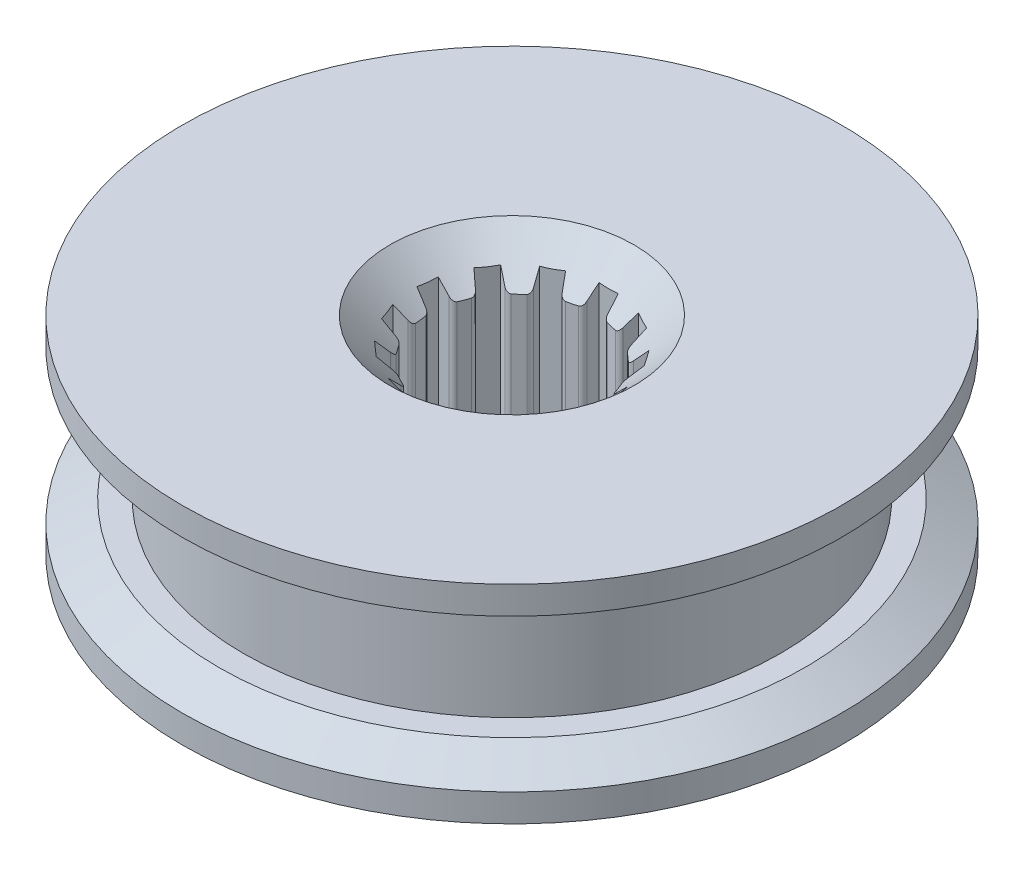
ISO-10303-21;
HEADER;
FILE_DESCRIPTION(('STEP AP214'),'2;1');
FILE_NAME('part.step','',(''),(''),'','','');
FILE_SCHEMA(('AUTOMOTIVE_DESIGN { 1 0 10303 214 1 1 1 1 }'));
ENDSEC;
DATA;
#1=APPLICATION_CONTEXT('core data for automotive mechanical design processes');
#2=APPLICATION_PROTOCOL_DEFINITION('international standard','automotive_design',2000,#1);
#3=PRODUCT_CONTEXT('',#1,'mechanical');
#4=PRODUCT('Part','Part','',(#3));
#5=PRODUCT_RELATED_PRODUCT_CATEGORY('part','',(#4));
#6=PRODUCT_DEFINITION_FORMATION('','',#4);
#7=PRODUCT_DEFINITION_CONTEXT('part definition',#1,'design');
#8=PRODUCT_DEFINITION('design','',#6,#7);
#9=PRODUCT_DEFINITION_SHAPE('','',#8);
#10=(LENGTH_UNIT() NAMED_UNIT(*) SI_UNIT(.MILLI.,.METRE.));
#11=(NAMED_UNIT(*) PLANE_ANGLE_UNIT() SI_UNIT($,.RADIAN.));
#12=(NAMED_UNIT(*) SI_UNIT($,.STERADIAN.) SOLID_ANGLE_UNIT());
#13=UNCERTAINTY_MEASURE_WITH_UNIT(LENGTH_MEASURE(1.E-05),#10,'distance_accuracy_value','');
#14=(GEOMETRIC_REPRESENTATION_CONTEXT(3) GLOBAL_UNCERTAINTY_ASSIGNED_CONTEXT((#13)) GLOBAL_UNIT_ASSIGNED_CONTEXT((#10,
#11,#12)) REPRESENTATION_CONTEXT('',''));
#15=CARTESIAN_POINT('',(0.,0.,0.));
#16=DIRECTION('',(0.,0.,1.));
#17=DIRECTION('',(1.,0.,0.));
#18=AXIS2_PLACEMENT_3D('',#15,#16,#17);
#19=CARTESIAN_POINT('',(-409.,10.,-284.));
#20=DIRECTION('',(0.,1.,0.));
#21=DIRECTION('',(0.,0.,1.));
#22=AXIS2_PLACEMENT_3D('',#19,#20,#21);
#23=PLANE('',#22);
#24=CARTESIAN_POINT('',(-409.,10.,-284.));
#25=DIRECTION('',(0.,1.,0.));
#26=DIRECTION('',(0.,0.,1.));
#27=AXIS2_PLACEMENT_3D('',#24,#25,#26);
#28=CIRCLE('',#27,12.);
#29=CARTESIAN_POINT('',(-409.,10.,-272.));
#30=VERTEX_POINT('',#29);
#31=EDGE_CURVE('E711',#30,#30,#28,.T.);
#32=ORIENTED_EDGE('',*,*,#31,.T.);
#33=EDGE_LOOP('',(#32));
#34=FACE_BOUND('',#33,.T.);
#35=CARTESIAN_POINT('',(-409.,10.,-284.));
#36=DIRECTION('',(0.,1.,0.));
#37=DIRECTION('',(0.,0.,1.));
#38=AXIS2_PLACEMENT_3D('',#35,#36,#37);
#39=CIRCLE('',#38,11.);
#40=CARTESIAN_POINT('',(-409.,10.,-273.));
#41=VERTEX_POINT('',#40);
#42=EDGE_CURVE('E702',#41,#41,#39,.T.);
#43=ORIENTED_EDGE('',*,*,#42,.F.);
#44=EDGE_LOOP('',(#43));
#45=FACE_BOUND('',#44,.T.);
#46=ADVANCED_FACE('F32',(#34,#45),#23,.T.);
#47=CARTESIAN_POINT('',(-409.,10.,-284.));
#48=DIRECTION('',(0.,-1.,0.));
#49=DIRECTION('',(0.,0.,-1.));
#50=AXIS2_PLACEMENT_3D('',#47,#48,#49);
#51=CYLINDRICAL_SURFACE('',#50,13.5);
#52=CARTESIAN_POINT('',(-409.,9.13397459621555,-284.));
#53=DIRECTION('',(0.,1.,0.));
#54=DIRECTION('',(0.,0.,1.));
#55=AXIS2_PLACEMENT_3D('',#52,#53,#54);
#56=CIRCLE('',#55,13.5);
#57=CARTESIAN_POINT('',(-409.,9.13397459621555,-270.5));
#58=VERTEX_POINT('',#57);
#59=EDGE_CURVE('E714',#58,#58,#56,.F.);
#60=ORIENTED_EDGE('',*,*,#59,.T.);
#61=EDGE_LOOP('',(#60));
#62=FACE_BOUND('',#61,.T.);
#63=CARTESIAN_POINT('',(-409.,8.,-284.));
#64=DIRECTION('',(0.,1.,0.));
#65=DIRECTION('',(0.,0.,1.));
#66=AXIS2_PLACEMENT_3D('',#63,#64,#65);
#67=CIRCLE('',#66,13.5);
#68=CARTESIAN_POINT('',(-409.,8.,-270.5));
#69=VERTEX_POINT('',#68);
#70=EDGE_CURVE('E706',#69,#69,#67,.T.);
#71=ORIENTED_EDGE('',*,*,#70,.T.);
#72=EDGE_LOOP('',(#71));
#73=FACE_BOUND('',#72,.T.);
#74=ADVANCED_FACE('F1637',(#62,#73),#51,.T.);
#75=CARTESIAN_POINT('',(-409.,8.,-284.));
#76=DIRECTION('',(0.,1.,0.));
#77=DIRECTION('',(0.,0.,1.));
#78=AXIS2_PLACEMENT_3D('',#75,#76,#77);
#79=PLANE('',#78);
#80=DIRECTION('',(0.962113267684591,0.,-0.272650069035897));
#81=VECTOR('',#80,1.);
#82=CARTESIAN_POINT('',(-408.799890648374,8.,-283.293864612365));
#83=LINE('',#82,#81);
#84=CARTESIAN_POINT('',(-412.565300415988,8.00000000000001,-282.226797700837));
#85=VERTEX_POINT('',#84);
#86=CARTESIAN_POINT('',(-412.117714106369,8.,-282.35363769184));
#87=VERTEX_POINT('',#86);
#88=EDGE_CURVE('E587',#85,#87,#83,.T.);
#89=ORIENTED_EDGE('',*,*,#88,.T.);
#90=CARTESIAN_POINT('',(-412.063184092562,8.00000000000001,-282.161215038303));
#91=DIRECTION('',(0.,1.,0.));
#92=DIRECTION('',(0.,0.,1.));
#93=AXIS2_PLACEMENT_3D('',#90,#91,#92);
#94=CIRCLE('',#93,0.2);
#95=CARTESIAN_POINT('',(-411.898587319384,8.,-282.27482798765));
#96=VERTEX_POINT('',#95);
#97=EDGE_CURVE('E778',#87,#96,#94,.F.);
#98=ORIENTED_EDGE('',*,*,#97,.T.);
#99=DIRECTION('',(0.568064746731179,0.,0.82298386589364));
#100=VECTOR('',#99,1.);
#101=CARTESIAN_POINT('',(-411.769752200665,8.,-282.088178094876));
#102=LINE('',#101,#100);
#103=CARTESIAN_POINT('',(-411.640917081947,8.,-281.901528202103));
#104=VERTEX_POINT('',#103);
#105=EDGE_CURVE('E590',#96,#104,#102,.T.);
#106=ORIENTED_EDGE('',*,*,#105,.T.);
#107=CARTESIAN_POINT('',(-411.805513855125,8.00000000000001,-281.787915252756));
#108=DIRECTION('',(0.,1.,0.));
#109=DIRECTION('',(0.,0.,1.));
#110=AXIS2_PLACEMENT_3D('',#107,#108,#109);
#111=CIRCLE('',#110,0.2);
#112=CARTESIAN_POINT('',(-411.644932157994,8.,-281.668694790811));
#113=VERTEX_POINT('',#112);
#114=EDGE_CURVE('E776',#104,#113,#111,.F.);
#115=ORIENTED_EDGE('',*,*,#114,.T.);
#116=DIRECTION('',(-0.596102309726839,0.,0.802908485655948));
#117=VECTOR('',#116,1.);
#118=CARTESIAN_POINT('',(-409.589288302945,8.,-284.437504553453));
#119=LINE('',#118,#117);
#120=CARTESIAN_POINT('',(-411.922245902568,8.00000000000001,-281.295172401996));
#121=VERTEX_POINT('',#120);
#122=EDGE_CURVE('E593',#113,#121,#119,.T.);
#123=ORIENTED_EDGE('',*,*,#122,.T.);
#124=DIRECTION('',(0.748510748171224,0.,0.663122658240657));
#125=VECTOR('',#124,1.);
#126=CARTESIAN_POINT('',(-411.627557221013,8.,-281.034101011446));
#127=LINE('',#126,#125);
#128=CARTESIAN_POINT('',(-411.332868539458,8.00000000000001,-280.773029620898));
#129=VERTEX_POINT('',#128);
#130=EDGE_CURVE('E595',#121,#129,#127,.T.);
#131=ORIENTED_EDGE('',*,*,#130,.T.);
#132=DIRECTION('',(0.725202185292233,0.,-0.688535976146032));
#133=VECTOR('',#132,1.);
#134=CARTESIAN_POINT('',(-408.494654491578,8.,-283.467743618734));
#135=LINE('',#134,#133);
#136=CARTESIAN_POINT('',(-410.995496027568,8.,-281.093344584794));
#137=VERTEX_POINT('',#136);
#138=EDGE_CURVE('E598',#129,#137,#135,.T.);
#139=ORIENTED_EDGE('',*,*,#138,.T.);
#140=CARTESIAN_POINT('',(-410.857788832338,8.00000000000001,-280.948304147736));
#141=DIRECTION('',(0.,1.,0.));
#142=DIRECTION('',(0.,0.,1.));
#143=AXIS2_PLACEMENT_3D('',#140,#141,#142);
#144=CIRCLE('',#143,0.2);
#145=CARTESIAN_POINT('',(-410.76484419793,8.,-281.125395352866));
#146=VERTEX_POINT('',#145);
#147=EDGE_CURVE('E774',#137,#146,#144,.F.);
#148=ORIENTED_EDGE('',*,*,#147,.T.);
#149=DIRECTION('',(0.885456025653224,0.,0.464723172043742));
#150=VECTOR('',#149,1.);
#151=CARTESIAN_POINT('',(-410.564025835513,8.,-281.019997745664));
#152=LINE('',#151,#150);
#153=CARTESIAN_POINT('',(-410.363207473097,8.,-280.914600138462));
#154=VERTEX_POINT('',#153);
#155=EDGE_CURVE('E601',#146,#154,#152,.T.);
#156=ORIENTED_EDGE('',*,*,#155,.T.);
#157=CARTESIAN_POINT('',(-410.456152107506,8.00000000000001,-280.737508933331));
#158=DIRECTION('',(0.,1.,0.));
#159=DIRECTION('',(0.,0.,1.));
#160=AXIS2_PLACEMENT_3D('',#157,#158,#159);
#161=CIRCLE('',#160,0.2);
#162=CARTESIAN_POINT('',(-410.258559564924,8.,-280.706570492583));
#163=VERTEX_POINT('',#162);
#164=EDGE_CURVE('E772',#154,#163,#161,.F.);
#165=ORIENTED_EDGE('',*,*,#164,.T.);
#166=DIRECTION('',(-0.154692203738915,0.,0.987962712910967));
#167=VECTOR('',#166,1.);
#168=CARTESIAN_POINT('',(-409.725107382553,8.,-284.113535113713));
#169=LINE('',#168,#167);
#170=CARTESIAN_POINT('',(-410.330524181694,8.00000000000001,-280.246958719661));
#171=VERTEX_POINT('',#170);
#172=EDGE_CURVE('E604',#163,#171,#169,.T.);
#173=ORIENTED_EDGE('',*,*,#172,.T.);
#174=DIRECTION('',(0.970941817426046,0.,0.239315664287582));
#175=VECTOR('',#174,1.);
#176=CARTESIAN_POINT('',(-409.948264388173,8.,-280.152740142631));
#177=LINE('',#176,#175);
#178=CARTESIAN_POINT('',(-409.566004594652,8.00000000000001,-280.058521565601));
#179=VERTEX_POINT('',#178);
#180=EDGE_CURVE('E606',#171,#179,#177,.T.);
#181=ORIENTED_EDGE('',*,*,#180,.T.);
#182=DIRECTION('',(0.322156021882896,0.,-0.94668658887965));
#183=VECTOR('',#182,1.);
#184=CARTESIAN_POINT('',(-408.305186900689,8.,-283.763556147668));
#185=LINE('',#184,#183);
#186=CARTESIAN_POINT('',(-409.416133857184,8.,-280.498931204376));
#187=VERTEX_POINT('',#186);
#188=EDGE_CURVE('E609',#179,#187,#185,.T.);
#189=ORIENTED_EDGE('',*,*,#188,.T.);
#190=CARTESIAN_POINT('',(-409.226796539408,8.00000000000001,-280.4345));
#191=DIRECTION('',(0.,1.,0.));
#192=DIRECTION('',(0.,0.,1.));
#193=AXIS2_PLACEMENT_3D('',#190,#191,#192);
#194=CIRCLE('',#193,0.2);
#195=CARTESIAN_POINT('',(-409.226796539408,8.,-280.6345));
#196=VERTEX_POINT('',#195);
#197=EDGE_CURVE('E770',#187,#196,#194,.F.);
#198=ORIENTED_EDGE('',*,*,#197,.T.);
#199=DIRECTION('',(1.,0.,0.));
#200=VECTOR('',#199,1.);
#201=CARTESIAN_POINT('',(-409.,8.,-280.6345));
#202=LINE('',#201,#200);
#203=CARTESIAN_POINT('',(-408.773203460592,8.,-280.6345));
#204=VERTEX_POINT('',#203);
#205=EDGE_CURVE('E612',#196,#204,#202,.T.);
#206=ORIENTED_EDGE('',*,*,#205,.T.);
#207=CARTESIAN_POINT('',(-408.773203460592,8.00000000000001,-280.4345));
#208=DIRECTION('',(0.,1.,0.));
#209=DIRECTION('',(0.,0.,1.));
#210=AXIS2_PLACEMENT_3D('',#207,#208,#209);
#211=CIRCLE('',#210,0.2);
#212=CARTESIAN_POINT('',(-408.583866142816,8.,-280.498931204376));
#213=VERTEX_POINT('',#212);
#214=EDGE_CURVE('E768',#204,#213,#211,.F.);
#215=ORIENTED_EDGE('',*,*,#214,.T.);
#216=DIRECTION('',(0.32215602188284,0.,0.946686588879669));
#217=VECTOR('',#216,1.);
#218=CARTESIAN_POINT('',(-409.694813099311,8.,-283.763556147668));
#219=LINE('',#218,#217);
#220=CARTESIAN_POINT('',(-408.433995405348,8.00000000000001,-280.058521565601));
#221=VERTEX_POINT('',#220);
#222=EDGE_CURVE('E615',#213,#221,#219,.T.);
#223=ORIENTED_EDGE('',*,*,#222,.T.);
#224=DIRECTION('',(0.970941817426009,0.,-0.239315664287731));
#225=VECTOR('',#224,1.);
#226=CARTESIAN_POINT('',(-408.051735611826,8.,-280.152740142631));
#227=LINE('',#226,#225);
#228=CARTESIAN_POINT('',(-407.669475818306,8.00000000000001,-280.246958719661));
#229=VERTEX_POINT('',#228);
#230=EDGE_CURVE('E617',#221,#229,#227,.T.);
#231=ORIENTED_EDGE('',*,*,#230,.T.);
#232=DIRECTION('',(-0.154692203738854,0.,-0.987962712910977));
#233=VECTOR('',#232,1.);
#234=CARTESIAN_POINT('',(-408.274892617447,8.,-284.113535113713));
#235=LINE('',#234,#233);
#236=CARTESIAN_POINT('',(-407.741440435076,8.,-280.706570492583));
#237=VERTEX_POINT('',#236);
#238=EDGE_CURVE('E620',#229,#237,#235,.T.);
#239=ORIENTED_EDGE('',*,*,#238,.T.);
#240=CARTESIAN_POINT('',(-407.543847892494,8.00000000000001,-280.737508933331));
#241=DIRECTION('',(0.,1.,0.));
#242=DIRECTION('',(0.,0.,1.));
#243=AXIS2_PLACEMENT_3D('',#240,#241,#242);
#244=CIRCLE('',#243,0.2);
#245=CARTESIAN_POINT('',(-407.636792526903,8.,-280.914600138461));
#246=VERTEX_POINT('',#245);
#247=EDGE_CURVE('E766',#237,#246,#244,.F.);
#248=ORIENTED_EDGE('',*,*,#247,.T.);
#249=DIRECTION('',(0.885456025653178,0.,-0.464723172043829));
#250=VECTOR('',#249,1.);
#251=CARTESIAN_POINT('',(-407.435974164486,8.,-281.019997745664));
#252=LINE('',#251,#250);
#253=CARTESIAN_POINT('',(-407.23515580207,8.,-281.125395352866));
#254=VERTEX_POINT('',#253);
#255=EDGE_CURVE('E623',#246,#254,#252,.T.);
#256=ORIENTED_EDGE('',*,*,#255,.T.);
#257=CARTESIAN_POINT('',(-407.142211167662,8.00000000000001,-280.948304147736));
#258=DIRECTION('',(0.,1.,0.));
#259=DIRECTION('',(0.,0.,1.));
#260=AXIS2_PLACEMENT_3D('',#257,#258,#259);
#261=CIRCLE('',#260,0.2);
#262=CARTESIAN_POINT('',(-407.004503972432,8.,-281.093344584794));
#263=VERTEX_POINT('',#262);
#264=EDGE_CURVE('E764',#254,#263,#261,.F.);
#265=ORIENTED_EDGE('',*,*,#264,.T.);
#266=DIRECTION('',(0.725202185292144,0.,0.688535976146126));
#267=VECTOR('',#266,1.);
#268=CARTESIAN_POINT('',(-409.505345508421,8.,-283.467743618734));
#269=LINE('',#268,#267);
#270=CARTESIAN_POINT('',(-406.667131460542,8.00000000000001,-280.773029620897));
#271=VERTEX_POINT('',#270);
#272=EDGE_CURVE('E626',#263,#271,#269,.T.);
#273=ORIENTED_EDGE('',*,*,#272,.T.);
#274=DIRECTION('',(0.748510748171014,0.,-0.663122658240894));
#275=VECTOR('',#274,1.);
#276=CARTESIAN_POINT('',(-406.372442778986,8.,-281.034101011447));
#277=LINE('',#276,#275);
#278=CARTESIAN_POINT('',(-406.077754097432,8.00000000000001,-281.295172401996));
#279=VERTEX_POINT('',#278);
#280=EDGE_CURVE('E628',#271,#279,#277,.T.);
#281=ORIENTED_EDGE('',*,*,#280,.T.);
#282=DIRECTION('',(-0.596102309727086,0.,-0.802908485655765));
#283=VECTOR('',#282,1.);
#284=CARTESIAN_POINT('',(-408.410711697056,8.,-284.437504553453));
#285=LINE('',#284,#283);
#286=CARTESIAN_POINT('',(-406.355067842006,8.,-281.668694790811));
#287=VERTEX_POINT('',#286);
#288=EDGE_CURVE('E631',#279,#287,#285,.T.);
#289=ORIENTED_EDGE('',*,*,#288,.T.);
#290=CARTESIAN_POINT('',(-406.194486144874,8.00000000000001,-281.787915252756));
#291=DIRECTION('',(0.,1.,0.));
#292=DIRECTION('',(0.,0.,1.));
#293=AXIS2_PLACEMENT_3D('',#290,#291,#292);
#294=CIRCLE('',#293,0.2);
#295=CARTESIAN_POINT('',(-406.359082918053,8.,-281.901528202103));
#296=VERTEX_POINT('',#295);
#297=EDGE_CURVE('E762',#287,#296,#294,.F.);
#298=ORIENTED_EDGE('',*,*,#297,.T.);
#299=DIRECTION('',(0.568064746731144,0.,-0.822983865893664));
#300=VECTOR('',#299,1.);
#301=CARTESIAN_POINT('',(-406.230247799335,8.,-282.088178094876));
#302=LINE('',#301,#300);
#303=CARTESIAN_POINT('',(-406.101412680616,8.,-282.27482798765));
#304=VERTEX_POINT('',#303);
#305=EDGE_CURVE('E634',#296,#304,#302,.T.);
#306=ORIENTED_EDGE('',*,*,#305,.T.);
#307=CARTESIAN_POINT('',(-405.936815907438,8.00000000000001,-282.161215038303));
#308=DIRECTION('',(0.,1.,0.));
#309=DIRECTION('',(0.,0.,1.));
#310=AXIS2_PLACEMENT_3D('',#307,#308,#309);
#311=CIRCLE('',#310,0.2);
#312=CARTESIAN_POINT('',(-405.88228589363,8.,-282.35363769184));
#313=VERTEX_POINT('',#312);
#314=EDGE_CURVE('E760',#304,#313,#311,.F.);
#315=ORIENTED_EDGE('',*,*,#314,.T.);
#316=DIRECTION('',(0.962113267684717,0.,0.27265006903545));
#317=VECTOR('',#316,1.);
#318=CARTESIAN_POINT('',(-409.200109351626,8.,-283.293864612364));
#319=LINE('',#318,#317);
#320=CARTESIAN_POINT('',(-405.434699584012,8.00000000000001,-282.226797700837));
#321=VERTEX_POINT('',#320);
#322=EDGE_CURVE('E637',#313,#321,#319,.T.);
#323=ORIENTED_EDGE('',*,*,#322,.T.);
#324=DIRECTION('',(0.354604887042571,0.,-0.935016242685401));
#325=VECTOR('',#324,1.);
#326=CARTESIAN_POINT('',(-405.295091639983,8.,-282.594913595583));
#327=LINE('',#326,#325);
#328=CARTESIAN_POINT('',(-405.155483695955,8.00000000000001,-282.963029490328));
#329=VERTEX_POINT('',#328);
#330=EDGE_CURVE('E639',#321,#329,#327,.T.);
#331=ORIENTED_EDGE('',*,*,#330,.T.);
#332=DIRECTION('',(-0.900952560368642,0.,-0.433917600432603));
#333=VECTOR('',#332,1.);
#334=CARTESIAN_POINT('',(-408.681529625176,8.,-284.661246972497));
#335=LINE('',#334,#333);
#336=CARTESIAN_POINT('',(-405.574617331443,8.,-283.164893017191));
#337=VERTEX_POINT('',#336);
#338=EDGE_CURVE('E642',#329,#337,#335,.T.);
#339=ORIENTED_EDGE('',*,*,#338,.T.);
#340=CARTESIAN_POINT('',(-405.487833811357,8.00000000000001,-283.345083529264));
#341=DIRECTION('',(0.,1.,0.));
#342=DIRECTION('',(0.,0.,1.));
#343=AXIS2_PLACEMENT_3D('',#340,#341,#342);
#344=CIRCLE('',#343,0.2);
#345=CARTESIAN_POINT('',(-405.686375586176,8.,-283.369190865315));
#346=VERTEX_POINT('',#345);
#347=EDGE_CURVE('E758',#337,#346,#344,.F.);
#348=ORIENTED_EDGE('',*,*,#347,.T.);
#349=DIRECTION('',(0.120536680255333,0.,-0.992708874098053));
#350=VECTOR('',#349,1.);
#351=CARTESIAN_POINT('',(-405.659038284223,8.,-283.594333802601));
#352=LINE('',#351,#350);
#353=CARTESIAN_POINT('',(-405.631700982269,8.,-283.819476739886));
#354=VERTEX_POINT('',#353);
#355=EDGE_CURVE('E645',#346,#354,#352,.T.);
#356=ORIENTED_EDGE('',*,*,#355,.T.);
#357=CARTESIAN_POINT('',(-405.43315920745,8.00000000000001,-283.795369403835));
#358=DIRECTION('',(0.,1.,0.));
#359=DIRECTION('',(0.,0.,1.));
#360=AXIS2_PLACEMENT_3D('',#357,#358,#359);
#361=CIRCLE('',#360,0.2);
#362=CARTESIAN_POINT('',(-405.47429854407,8.,-283.991092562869));
#363=VERTEX_POINT('',#362);
#364=EDGE_CURVE('E756',#354,#363,#361,.F.);
#365=ORIENTED_EDGE('',*,*,#364,.T.);
#366=DIRECTION('',(0.978615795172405,0.,-0.2056966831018));
#367=VECTOR('',#366,1.);
#368=CARTESIAN_POINT('',(-408.849030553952,8.,-283.281752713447));
#369=LINE('',#368,#367);
#370=CARTESIAN_POINT('',(-405.019035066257,8.00000000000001,-284.086785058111));
#371=VERTEX_POINT('',#370);
#372=EDGE_CURVE('E648',#363,#371,#369,.T.);
#373=ORIENTED_EDGE('',*,*,#372,.T.);
#374=DIRECTION('',(-0.120536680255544,0.,-0.992708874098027));
#375=VECTOR('',#374,1.);
#376=CARTESIAN_POINT('',(-405.066490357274,8.,-284.477614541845));
#377=LINE('',#376,#375);
#378=CARTESIAN_POINT('',(-405.11394564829,8.00000000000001,-284.868444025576));
#379=VERTEX_POINT('',#378);
#380=EDGE_CURVE('E650',#371,#379,#377,.T.);
#381=ORIENTED_EDGE('',*,*,#380,.T.);
#382=DIRECTION('',(-0.999405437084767,0.,0.0344785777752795));
#383=VECTOR('',#382,1.);
#384=CARTESIAN_POINT('',(-409.025305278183,8.,-284.733505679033));
#385=LINE('',#384,#383);
#386=CARTESIAN_POINT('',(-405.578880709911,8.,-284.852404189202));
#387=VERTEX_POINT('',#386);
#388=EDGE_CURVE('E653',#379,#387,#385,.T.);
#389=ORIENTED_EDGE('',*,*,#388,.T.);
#390=CARTESIAN_POINT('',(-405.585776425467,8.00000000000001,-285.052285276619));
#391=DIRECTION('',(0.,1.,0.));
#392=DIRECTION('',(0.,0.,1.));
#393=AXIS2_PLACEMENT_3D('',#390,#391,#392);
#394=CIRCLE('',#393,0.2);
#395=CARTESIAN_POINT('',(-405.772779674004,8.,-284.98136429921));
#396=VERTEX_POINT('',#395);
#397=EDGE_CURVE('E754',#387,#396,#394,.F.);
#398=ORIENTED_EDGE('',*,*,#397,.T.);
#399=DIRECTION('',(-0.354604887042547,0.,-0.935016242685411));
#400=VECTOR('',#399,1.);
#401=CARTESIAN_POINT('',(-405.853202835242,8.,-285.193422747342));
#402=LINE('',#401,#400);
#403=CARTESIAN_POINT('',(-405.933625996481,8.,-285.405481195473));
#404=VERTEX_POINT('',#403);
#405=EDGE_CURVE('E656',#396,#404,#402,.T.);
#406=ORIENTED_EDGE('',*,*,#405,.T.);
#407=CARTESIAN_POINT('',(-405.746622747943,8.00000000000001,-285.476402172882));
#408=DIRECTION('',(0.,1.,0.));
#409=DIRECTION('',(0.,0.,1.));
#410=AXIS2_PLACEMENT_3D('',#407,#408,#409);
#411=CIRCLE('',#410,0.2);
#412=CARTESIAN_POINT('',(-405.874006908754,8.,-285.630588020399));
#413=VERTEX_POINT('',#412);
#414=EDGE_CURVE('E752',#404,#413,#411,.F.);
#415=ORIENTED_EDGE('',*,*,#414,.T.);
#416=DIRECTION('',(0.770929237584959,0.,-0.636920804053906));
#417=VECTOR('',#416,1.);
#418=CARTESIAN_POINT('',(-408.532537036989,8.,-283.434182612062));
#419=LINE('',#418,#417);
#420=CARTESIAN_POINT('',(-405.515361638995,8.00000000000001,-285.926891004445));
#421=VERTEX_POINT('',#420);
#422=EDGE_CURVE('E659',#413,#421,#419,.T.);
#423=ORIENTED_EDGE('',*,*,#422,.T.);
#424=DIRECTION('',(-0.568064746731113,0.,-0.822983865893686));
#425=VECTOR('',#424,1.);
#426=CARTESIAN_POINT('',(-405.739008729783,8.,-286.250899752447));
#427=LINE('',#426,#425);
#428=CARTESIAN_POINT('',(-405.962655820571,8.00000000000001,-286.57490850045));
#429=VERTEX_POINT('',#428);
#430=EDGE_CURVE('E661',#421,#429,#427,.T.);
#431=ORIENTED_EDGE('',*,*,#430,.T.);
#432=DIRECTION('',(-0.868906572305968,0.,0.494976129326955));
#433=VECTOR('',#432,1.);
#434=CARTESIAN_POINT('',(-409.36328379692,8.,-284.637727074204));
#435=LINE('',#434,#433);
#436=CARTESIAN_POINT('',(-406.366881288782,8.,-286.344639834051));
#437=VERTEX_POINT('',#436);
#438=EDGE_CURVE('E664',#429,#437,#435,.T.);
#439=ORIENTED_EDGE('',*,*,#438,.T.);
#440=CARTESIAN_POINT('',(-406.465876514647,8.00000000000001,-286.518421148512));
#441=DIRECTION('',(0.,1.,0.));
#442=DIRECTION('',(0.,0.,1.));
#443=AXIS2_PLACEMENT_3D('',#440,#441,#442);
#444=CIRCLE('',#443,0.2);
#445=CARTESIAN_POINT('',(-406.598501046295,8.,-286.368718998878));
#446=VERTEX_POINT('',#445);
#447=EDGE_CURVE('E750',#437,#446,#444,.F.);
#448=ORIENTED_EDGE('',*,*,#447,.T.);
#449=DIRECTION('',(-0.748510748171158,0.,-0.663122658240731));
#450=VECTOR('',#449,1.);
#451=CARTESIAN_POINT('',(-406.768260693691,8.,-286.51911292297));
#452=LINE('',#451,#450);
#453=CARTESIAN_POINT('',(-406.938020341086,8.,-286.669506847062));
#454=VERTEX_POINT('',#453);
#455=EDGE_CURVE('E667',#446,#454,#452,.T.);
#456=ORIENTED_EDGE('',*,*,#455,.T.);
#457=CARTESIAN_POINT('',(-406.805395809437,8.00000000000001,-286.819208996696));
#458=DIRECTION('',(0.,1.,0.));
#459=DIRECTION('',(0.,0.,1.));
#460=AXIS2_PLACEMENT_3D('',#457,#458,#459);
#461=CIRCLE('',#460,0.2);
#462=CARTESIAN_POINT('',(-406.989842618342,8.,-286.896535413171));
#463=VERTEX_POINT('',#462);
#464=EDGE_CURVE('E748',#454,#463,#461,.F.);
#465=ORIENTED_EDGE('',*,*,#464,.T.);
#466=DIRECTION('',(0.386632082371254,0.,-0.922234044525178));
#467=VECTOR('',#466,1.);
#468=CARTESIAN_POINT('',(-408.323133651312,8.,-283.716234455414));
#469=LINE('',#468,#467);
#470=CARTESIAN_POINT('',(-406.809976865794,8.00000000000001,-287.325569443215));
#471=VERTEX_POINT('',#470);
#472=EDGE_CURVE('E670',#463,#471,#469,.T.);
#473=ORIENTED_EDGE('',*,*,#472,.T.);
#474=DIRECTION('',(-0.885456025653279,0.,-0.464723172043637));
#475=VECTOR('',#474,1.);
#476=CARTESIAN_POINT('',(-407.158580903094,8.,-287.508530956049));
#477=LINE('',#476,#475);
#478=CARTESIAN_POINT('',(-407.507184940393,8.00000000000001,-287.691492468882));
#479=VERTEX_POINT('',#478);
#480=EDGE_CURVE('E672',#471,#479,#477,.T.);
#481=ORIENTED_EDGE('',*,*,#480,.T.);
#482=DIRECTION('',(-0.53935168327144,0.,0.842080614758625));
#483=VECTOR('',#482,1.);
#484=CARTESIAN_POINT('',(-409.618038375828,8.,-284.39585288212));
#485=LINE('',#484,#483);
#486=CARTESIAN_POINT('',(-407.758097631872,8.,-287.299746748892));
#487=VERTEX_POINT('',#486);
#488=EDGE_CURVE('E675',#479,#487,#485,.T.);
#489=ORIENTED_EDGE('',*,*,#488,.T.);
#490=CARTESIAN_POINT('',(-407.926513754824,8.00000000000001,-287.407617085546));
#491=DIRECTION('',(0.,1.,0.));
#492=DIRECTION('',(0.,0.,1.));
#493=AXIS2_PLACEMENT_3D('',#490,#491,#492);
#494=CIRCLE('',#493,0.2);
#495=CARTESIAN_POINT('',(-407.974376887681,8.,-287.213428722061));
#496=VERTEX_POINT('',#495);
#497=EDGE_CURVE('E746',#487,#496,#494,.F.);
#498=ORIENTED_EDGE('',*,*,#497,.T.);
#499=DIRECTION('',(-0.970941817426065,0.,-0.239315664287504));
#500=VECTOR('',#499,1.);
#501=CARTESIAN_POINT('',(-408.19458313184,8.,-287.267704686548));
#502=LINE('',#501,#500);
#503=CARTESIAN_POINT('',(-408.414789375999,8.,-287.321980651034));
#504=VERTEX_POINT('',#503);
#505=EDGE_CURVE('E678',#496,#504,#502,.T.);
#506=ORIENTED_EDGE('',*,*,#505,.T.);
#507=CARTESIAN_POINT('',(-408.366926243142,8.00000000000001,-287.516169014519));
#508=DIRECTION('',(0.,1.,0.));
#509=DIRECTION('',(0.,0.,1.));
#510=AXIS2_PLACEMENT_3D('',#507,#508,#509);
#511=CIRCLE('',#510,0.2);
#512=CARTESIAN_POINT('',(-408.566181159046,8.,-287.498921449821));
#513=VERTEX_POINT('',#512);
#514=EDGE_CURVE('E744',#504,#513,#511,.F.);
#515=ORIENTED_EDGE('',*,*,#514,.T.);
#516=DIRECTION('',(-0.0862378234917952,0.,-0.996274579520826));
#517=VECTOR('',#516,1.);
#518=CARTESIAN_POINT('',(-408.268792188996,8.,-284.063293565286));
#519=LINE('',#518,#517);
#520=CARTESIAN_POINT('',(-408.6063,8.00000000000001,-287.9624));
#521=VERTEX_POINT('',#520);
#522=EDGE_CURVE('E681',#513,#521,#519,.T.);
#523=ORIENTED_EDGE('',*,*,#522,.T.);
#524=DIRECTION('',(-1.,0.,0.));
#525=VECTOR('',#524,1.);
#526=CARTESIAN_POINT('',(-409.,8.,-287.9624));
#527=LINE('',#526,#525);
#528=CARTESIAN_POINT('',(-409.3937,8.00000000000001,-287.9624));
#529=VERTEX_POINT('',#528);
#530=EDGE_CURVE('E683',#521,#529,#527,.T.);
#531=ORIENTED_EDGE('',*,*,#530,.T.);
#532=DIRECTION('',(-0.0862378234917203,0.,0.996274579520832));
#533=VECTOR('',#532,1.);
#534=CARTESIAN_POINT('',(-409.731207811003,8.,-284.063293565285));
#535=LINE('',#534,#533);
#536=CARTESIAN_POINT('',(-409.433818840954,8.,-287.498921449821));
#537=VERTEX_POINT('',#536);
#538=EDGE_CURVE('E686',#529,#537,#535,.T.);
#539=ORIENTED_EDGE('',*,*,#538,.T.);
#540=CARTESIAN_POINT('',(-409.633073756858,8.00000000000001,-287.516169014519));
#541=DIRECTION('',(0.,1.,0.));
#542=DIRECTION('',(0.,0.,1.));
#543=AXIS2_PLACEMENT_3D('',#540,#541,#542);
#544=CIRCLE('',#543,0.2);
#545=CARTESIAN_POINT('',(-409.585210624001,8.,-287.321980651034));
#546=VERTEX_POINT('',#545);
#547=EDGE_CURVE('E742',#537,#546,#544,.F.);
#548=ORIENTED_EDGE('',*,*,#547,.T.);
#549=DIRECTION('',(-0.970941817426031,0.,0.239315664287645));
#550=VECTOR('',#549,1.);
#551=CARTESIAN_POINT('',(-409.80541686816,8.,-287.267704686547));
#552=LINE('',#551,#550);
#553=CARTESIAN_POINT('',(-410.025623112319,8.,-287.213428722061));
#554=VERTEX_POINT('',#553);
#555=EDGE_CURVE('E689',#546,#554,#552,.T.);
#556=ORIENTED_EDGE('',*,*,#555,.T.);
#557=CARTESIAN_POINT('',(-410.073486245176,8.00000000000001,-287.407617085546));
#558=DIRECTION('',(0.,1.,0.));
#559=DIRECTION('',(0.,0.,1.));
#560=AXIS2_PLACEMENT_3D('',#557,#558,#559);
#561=CIRCLE('',#560,0.2);
#562=CARTESIAN_POINT('',(-410.241902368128,8.,-287.299746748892));
#563=VERTEX_POINT('',#562);
#564=EDGE_CURVE('E59',#554,#563,#561,.F.);
#565=ORIENTED_EDGE('',*,*,#564,.T.);
#566=DIRECTION('',(-0.539351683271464,0.,-0.84208061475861));
#567=VECTOR('',#566,1.);
#568=CARTESIAN_POINT('',(-408.381961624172,8.,-284.39585288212));
#569=LINE('',#568,#567);
#570=CARTESIAN_POINT('',(-410.492815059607,8.00000000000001,-287.691492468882));
#571=VERTEX_POINT('',#570);
#572=EDGE_CURVE('E691',#563,#571,#569,.T.);
#573=ORIENTED_EDGE('',*,*,#572,.T.);
#574=DIRECTION('',(-0.885456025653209,0.,0.464723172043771));
#575=VECTOR('',#574,1.);
#576=CARTESIAN_POINT('',(-410.841419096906,8.,-287.508530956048));
#577=LINE('',#576,#575);
#578=CARTESIAN_POINT('',(-411.190023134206,8.00000000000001,-287.325569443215));
#579=VERTEX_POINT('',#578);
#580=EDGE_CURVE('E693',#571,#579,#577,.T.);
#581=ORIENTED_EDGE('',*,*,#580,.T.);
#582=DIRECTION('',(0.386632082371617,0.,0.922234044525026));
#583=VECTOR('',#582,1.);
#584=CARTESIAN_POINT('',(-409.676866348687,8.,-283.716234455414));
#585=LINE('',#584,#583);
#586=CARTESIAN_POINT('',(-411.010157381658,8.,-286.896535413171));
#587=VERTEX_POINT('',#586);
#588=EDGE_CURVE('E696',#579,#587,#585,.T.);
#589=ORIENTED_EDGE('',*,*,#588,.T.);
#590=CARTESIAN_POINT('',(-411.194604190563,8.00000000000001,-286.819208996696));
#591=DIRECTION('',(0.,1.,0.));
#592=DIRECTION('',(0.,0.,1.));
#593=AXIS2_PLACEMENT_3D('',#590,#591,#592);
#594=CIRCLE('',#593,0.2);
#595=CARTESIAN_POINT('',(-411.061979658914,8.,-286.669506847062));
#596=VERTEX_POINT('',#595);
#597=EDGE_CURVE('E731',#587,#596,#594,.F.);
#598=ORIENTED_EDGE('',*,*,#597,.T.);
#599=DIRECTION('',(-0.748510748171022,0.,0.663122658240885));
#600=VECTOR('',#599,1.);
#601=CARTESIAN_POINT('',(-411.23173930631,8.,-286.51911292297));
#602=LINE('',#601,#600);
#603=CARTESIAN_POINT('',(-411.401498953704,8.,-286.368718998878));
#604=VERTEX_POINT('',#603);
#605=EDGE_CURVE('E558',#596,#604,#602,.T.);
#606=ORIENTED_EDGE('',*,*,#605,.T.);
#607=CARTESIAN_POINT('',(-411.534123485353,8.00000000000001,-286.518421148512));
#608=DIRECTION('',(0.,1.,0.));
#609=DIRECTION('',(0.,0.,1.));
#610=AXIS2_PLACEMENT_3D('',#607,#608,#609);
#611=CIRCLE('',#610,0.2);
#612=CARTESIAN_POINT('',(-411.633118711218,8.,-286.344639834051));
#613=VERTEX_POINT('',#612);
#614=EDGE_CURVE('E539',#604,#613,#611,.F.);
#615=ORIENTED_EDGE('',*,*,#614,.T.);
#616=DIRECTION('',(-0.868906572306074,0.,-0.494976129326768));
#617=VECTOR('',#616,1.);
#618=CARTESIAN_POINT('',(-408.636716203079,8.,-284.637727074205));
#619=LINE('',#618,#617);
#620=CARTESIAN_POINT('',(-412.037344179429,8.00000000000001,-286.57490850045));
#621=VERTEX_POINT('',#620);
#622=EDGE_CURVE('E553',#613,#621,#619,.T.);
#623=ORIENTED_EDGE('',*,*,#622,.T.);
#624=DIRECTION('',(-0.568064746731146,0.,0.822983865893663));
#625=VECTOR('',#624,1.);
#626=CARTESIAN_POINT('',(-412.260991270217,8.,-286.250899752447));
#627=LINE('',#626,#625);
#628=CARTESIAN_POINT('',(-412.484638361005,8.00000000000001,-285.926891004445));
#629=VERTEX_POINT('',#628);
#630=EDGE_CURVE('E557',#621,#629,#627,.T.);
#631=ORIENTED_EDGE('',*,*,#630,.T.);
#632=DIRECTION('',(0.77092923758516,0.,0.636920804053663));
#633=VECTOR('',#632,1.);
#634=CARTESIAN_POINT('',(-409.46746296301,8.,-283.434182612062));
#635=LINE('',#634,#633);
#636=CARTESIAN_POINT('',(-412.125993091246,8.,-285.630588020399));
#637=VERTEX_POINT('',#636);
#638=EDGE_CURVE('E560',#629,#637,#635,.T.);
#639=ORIENTED_EDGE('',*,*,#638,.T.);
#640=CARTESIAN_POINT('',(-412.253377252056,8.00000000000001,-285.476402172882));
#641=DIRECTION('',(0.,1.,0.));
#642=DIRECTION('',(0.,0.,1.));
#643=AXIS2_PLACEMENT_3D('',#640,#641,#642);
#644=CIRCLE('',#643,0.2);
#645=CARTESIAN_POINT('',(-412.066374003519,8.,-285.405481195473));
#646=VERTEX_POINT('',#645);
#647=EDGE_CURVE('E733',#637,#646,#644,.F.);
#648=ORIENTED_EDGE('',*,*,#647,.T.);
#649=DIRECTION('',(-0.354604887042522,0.,0.93501624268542));
#650=VECTOR('',#649,1.);
#651=CARTESIAN_POINT('',(-412.146797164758,8.,-285.193422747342));
#652=LINE('',#651,#650);
#653=CARTESIAN_POINT('',(-412.227220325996,8.,-284.98136429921));
#654=VERTEX_POINT('',#653);
#655=EDGE_CURVE('E568',#646,#654,#652,.T.);
#656=ORIENTED_EDGE('',*,*,#655,.T.);
#657=CARTESIAN_POINT('',(-412.414223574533,8.00000000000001,-285.052285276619));
#658=DIRECTION('',(0.,1.,0.));
#659=DIRECTION('',(0.,0.,1.));
#660=AXIS2_PLACEMENT_3D('',#657,#658,#659);
#661=CIRCLE('',#660,0.2);
#662=CARTESIAN_POINT('',(-412.421119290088,8.,-284.852404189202));
#663=VERTEX_POINT('',#662);
#664=EDGE_CURVE('E735',#654,#663,#661,.F.);
#665=ORIENTED_EDGE('',*,*,#664,.T.);
#666=DIRECTION('',(-0.999405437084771,0.,-0.0344785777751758));
#667=VECTOR('',#666,1.);
#668=CARTESIAN_POINT('',(-408.974694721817,8.,-284.733505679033));
#669=LINE('',#668,#667);
#670=CARTESIAN_POINT('',(-412.88605435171,8.00000000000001,-284.868444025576));
#671=VERTEX_POINT('',#670);
#672=EDGE_CURVE('E571',#663,#671,#669,.T.);
#673=ORIENTED_EDGE('',*,*,#672,.T.);
#674=DIRECTION('',(-0.120536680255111,0.,0.99270887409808));
#675=VECTOR('',#674,1.);
#676=CARTESIAN_POINT('',(-412.933509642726,8.,-284.477614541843));
#677=LINE('',#676,#675);
#678=CARTESIAN_POINT('',(-412.980964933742,8.00000000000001,-284.086785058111));
#679=VERTEX_POINT('',#678);
#680=EDGE_CURVE('E573',#671,#679,#677,.T.);
#681=ORIENTED_EDGE('',*,*,#680,.T.);
#682=DIRECTION('',(0.978615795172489,0.,0.2056966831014));
#683=VECTOR('',#682,1.);
#684=CARTESIAN_POINT('',(-409.150969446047,8.,-283.281752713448));
#685=LINE('',#684,#683);
#686=CARTESIAN_POINT('',(-412.52570145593,8.,-283.991092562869));
#687=VERTEX_POINT('',#686);
#688=EDGE_CURVE('E576',#679,#687,#685,.T.);
#689=ORIENTED_EDGE('',*,*,#688,.T.);
#690=CARTESIAN_POINT('',(-412.56684079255,8.00000000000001,-283.795369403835));
#691=DIRECTION('',(0.,1.,0.));
#692=DIRECTION('',(0.,0.,1.));
#693=AXIS2_PLACEMENT_3D('',#690,#691,#692);
#694=CIRCLE('',#693,0.2);
#695=CARTESIAN_POINT('',(-412.368299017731,8.,-283.819476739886));
#696=VERTEX_POINT('',#695);
#697=EDGE_CURVE('E737',#687,#696,#694,.F.);
#698=ORIENTED_EDGE('',*,*,#697,.T.);
#699=DIRECTION('',(0.120536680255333,0.,0.992708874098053));
#700=VECTOR('',#699,1.);
#701=CARTESIAN_POINT('',(-412.340961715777,8.,-283.594333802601));
#702=LINE('',#701,#700);
#703=CARTESIAN_POINT('',(-412.313624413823,8.,-283.369190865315));
#704=VERTEX_POINT('',#703);
#705=EDGE_CURVE('E579',#696,#704,#702,.T.);
#706=ORIENTED_EDGE('',*,*,#705,.T.);
#707=CARTESIAN_POINT('',(-412.512166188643,8.00000000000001,-283.345083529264));
#708=DIRECTION('',(0.,1.,0.));
#709=DIRECTION('',(0.,0.,1.));
#710=AXIS2_PLACEMENT_3D('',#707,#708,#709);
#711=CIRCLE('',#710,0.2);
#712=CARTESIAN_POINT('',(-412.425382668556,8.,-283.164893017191));
#713=VERTEX_POINT('',#712);
#714=EDGE_CURVE('E739',#704,#713,#711,.F.);
#715=ORIENTED_EDGE('',*,*,#714,.T.);
#716=DIRECTION('',(-0.900952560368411,0.,0.433917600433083));
#717=VECTOR('',#716,1.);
#718=CARTESIAN_POINT('',(-409.318470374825,8.,-284.661246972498));
#719=LINE('',#718,#717);
#720=CARTESIAN_POINT('',(-412.844516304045,8.00000000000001,-282.963029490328));
#721=VERTEX_POINT('',#720);
#722=EDGE_CURVE('E582',#713,#721,#719,.T.);
#723=ORIENTED_EDGE('',*,*,#722,.T.);
#724=DIRECTION('',(0.354604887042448,0.,0.935016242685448));
#725=VECTOR('',#724,1.);
#726=CARTESIAN_POINT('',(-412.704908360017,8.,-282.594913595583));
#727=LINE('',#726,#725);
#728=EDGE_CURVE('E584',#721,#85,#727,.T.);
#729=ORIENTED_EDGE('',*,*,#728,.T.);
#730=EDGE_LOOP('',(#89,#98,#106,#115,#123,#131,#139,#148,#156,#165,#173,#181,#189,#198,#206,
#215,#223,#231,#239,#248,#256,#265,#273,#281,#289,#298,#306,#315,#323,#331,#339,#348,#356,#365,
#373,#381,#389,#398,#406,#415,#423,#431,#439,#448,#456,#465,#473,#481,#489,#498,#506,#515,#523,
#531,#539,#548,#556,#565,#573,#581,#589,#598,#606,#615,#623,#631,#639,#648,#656,#665,#673,#681,
#689,#698,#706,#715,#723,#729));
#731=FACE_BOUND('',#730,.T.);
#732=ORIENTED_EDGE('',*,*,#70,.F.);
#733=EDGE_LOOP('',(#732));
#734=FACE_BOUND('',#733,.T.);
#735=ADVANCED_FACE('F898',(#731,#734),#79,.F.);
#736=CARTESIAN_POINT('',(-409.,14.5,-284.));
#737=DIRECTION('',(0.,-1.,0.));
#738=DIRECTION('',(0.,0.,-1.));
#739=AXIS2_PLACEMENT_3D('',#736,#737,#738);
#740=CYLINDRICAL_SURFACE('',#739,11.);
#741=CARTESIAN_POINT('',(-409.,14.5,-284.));
#742=DIRECTION('',(0.,1.,0.));
#743=DIRECTION('',(0.,0.,1.));
#744=AXIS2_PLACEMENT_3D('',#741,#742,#743);
#745=CIRCLE('',#744,11.);
#746=CARTESIAN_POINT('',(-409.,14.5,-273.));
#747=VERTEX_POINT('',#746);
#748=EDGE_CURVE('E703',#747,#747,#745,.T.);
#749=ORIENTED_EDGE('',*,*,#748,.F.);
#750=EDGE_LOOP('',(#749));
#751=FACE_BOUND('',#750,.T.);
#752=ORIENTED_EDGE('',*,*,#42,.T.);
#753=EDGE_LOOP('',(#752));
#754=FACE_BOUND('',#753,.T.);
#755=ADVANCED_FACE('F1627',(#751,#754),#740,.T.);
#756=CARTESIAN_POINT('',(-409.,14.5,-284.));
#757=DIRECTION('',(0.,1.,0.));
#758=DIRECTION('',(0.,0.,1.));
#759=AXIS2_PLACEMENT_3D('',#756,#757,#758);
#760=PLANE('',#759);
#761=CARTESIAN_POINT('',(-409.,14.5,-284.));
#762=DIRECTION('',(0.,1.,0.));
#763=DIRECTION('',(0.,0.,1.));
#764=AXIS2_PLACEMENT_3D('',#761,#762,#763);
#765=CIRCLE('',#764,12.);
#766=CARTESIAN_POINT('',(-409.,14.5,-272.));
#767=VERTEX_POINT('',#766);
#768=EDGE_CURVE('E720',#767,#767,#765,.F.);
#769=ORIENTED_EDGE('',*,*,#768,.T.);
#770=EDGE_LOOP('',(#769));
#771=FACE_BOUND('',#770,.T.);
#772=ORIENTED_EDGE('',*,*,#748,.T.);
#773=EDGE_LOOP('',(#772));
#774=FACE_BOUND('',#773,.T.);
#775=ADVANCED_FACE('F1624',(#771,#774),#760,.F.);
#776=CARTESIAN_POINT('',(-409.,16.5,-284.));
#777=DIRECTION('',(0.,-1.,0.));
#778=DIRECTION('',(0.,0.,-1.));
#779=AXIS2_PLACEMENT_3D('',#776,#777,#778);
#780=CYLINDRICAL_SURFACE('',#779,13.5);
#781=CARTESIAN_POINT('',(-409.,15.3660254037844,-284.));
#782=DIRECTION('',(0.,1.,0.));
#783=DIRECTION('',(0.,0.,1.));
#784=AXIS2_PLACEMENT_3D('',#781,#782,#783);
#785=CIRCLE('',#784,13.5);
#786=CARTESIAN_POINT('',(-409.,15.3660254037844,-270.5));
#787=VERTEX_POINT('',#786);
#788=EDGE_CURVE('E717',#787,#787,#785,.T.);
#789=ORIENTED_EDGE('',*,*,#788,.T.);
#790=EDGE_LOOP('',(#789));
#791=FACE_BOUND('',#790,.T.);
#792=CARTESIAN_POINT('',(-409.,16.5,-284.));
#793=DIRECTION('',(0.,1.,0.));
#794=DIRECTION('',(0.,0.,1.));
#795=AXIS2_PLACEMENT_3D('',#792,#793,#794);
#796=CIRCLE('',#795,13.5);
#797=CARTESIAN_POINT('',(-409.,16.5,-270.5));
#798=VERTEX_POINT('',#797);
#799=EDGE_CURVE('E699',#798,#798,#796,.T.);
#800=ORIENTED_EDGE('',*,*,#799,.F.);
#801=EDGE_LOOP('',(#800));
#802=FACE_BOUND('',#801,.T.);
#803=ADVANCED_FACE('F1622',(#791,#802),#780,.T.);
#804=CARTESIAN_POINT('',(-409.,16.5,-284.));
#805=DIRECTION('',(0.,1.,0.));
#806=DIRECTION('',(0.,0.,1.));
#807=AXIS2_PLACEMENT_3D('',#804,#805,#806);
#808=PLANE('',#807);
#809=CARTESIAN_POINT('',(-409.,16.5,-284.));
#810=DIRECTION('',(0.,-1.,0.));
#811=DIRECTION('',(0.,0.,-1.));
#812=AXIS2_PLACEMENT_3D('',#809,#810,#811);
#813=CIRCLE('',#812,5.);
#814=CARTESIAN_POINT('',(-409.,16.5,-289.));
#815=VERTEX_POINT('',#814);
#816=EDGE_CURVE('E536',#815,#815,#813,.T.);
#817=ORIENTED_EDGE('',*,*,#816,.T.);
#818=EDGE_LOOP('',(#817));
#819=FACE_BOUND('',#818,.T.);
#820=ORIENTED_EDGE('',*,*,#799,.T.);
#821=EDGE_LOOP('',(#820));
#822=FACE_BOUND('',#821,.T.);
#823=ADVANCED_FACE('F1618',(#819,#822),#808,.T.);
#824=CARTESIAN_POINT('',(-409.,10.,-284.));
#825=DIRECTION('',(0.,-1.,0.));
#826=DIRECTION('',(0.,0.,-1.));
#827=AXIS2_PLACEMENT_3D('',#824,#825,#826);
#828=CONICAL_SURFACE('',#827,12.,1.04719755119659);
#829=ORIENTED_EDGE('',*,*,#59,.F.);
#830=EDGE_LOOP('',(#829));
#831=FACE_BOUND('',#830,.T.);
#832=ORIENTED_EDGE('',*,*,#31,.F.);
#833=EDGE_LOOP('',(#832));
#834=FACE_BOUND('',#833,.T.);
#835=ADVANCED_FACE('F1621',(#831,#834),#828,.T.);
#836=CARTESIAN_POINT('',(-409.,15.3660254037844,-284.));
#837=DIRECTION('',(0.,1.,0.));
#838=DIRECTION('',(0.,0.,1.));
#839=AXIS2_PLACEMENT_3D('',#836,#837,#838);
#840=CONICAL_SURFACE('',#839,13.5,1.04719755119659);
#841=CARTESIAN_POINT('',(-409.,14.5,-272.));
#842=CARTESIAN_POINT('',(-409.,14.5090210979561,-271.984375));
#843=CARTESIAN_POINT('',(-409.,14.5180421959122,-271.96875));
#844=CARTESIAN_POINT('',(-409.,14.5360843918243,-271.9375));
#845=CARTESIAN_POINT('',(-409.,14.5451054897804,-271.921875));
#846=CARTESIAN_POINT('',(-409.,14.5631476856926,-271.890625));
#847=CARTESIAN_POINT('',(-409.,14.5721687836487,-271.875));
#848=CARTESIAN_POINT('',(-409.,14.5902109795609,-271.84375));
#849=CARTESIAN_POINT('',(-409.,14.599232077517,-271.828125));
#850=CARTESIAN_POINT('',(-409.,14.6172742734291,-271.796875));
#851=CARTESIAN_POINT('',(-409.,14.6262953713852,-271.78125));
#852=CARTESIAN_POINT('',(-409.,14.6443375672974,-271.75));
#853=CARTESIAN_POINT('',(-409.,14.6533586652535,-271.734375));
#854=CARTESIAN_POINT('',(-409.,14.6714008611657,-271.703125));
#855=CARTESIAN_POINT('',(-409.,14.6804219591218,-271.6875));
#856=CARTESIAN_POINT('',(-409.,14.6984641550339,-271.65625));
#857=CARTESIAN_POINT('',(-409.,14.70748525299,-271.640625));
#858=CARTESIAN_POINT('',(-409.,14.7255274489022,-271.609375));
#859=CARTESIAN_POINT('',(-409.,14.7345485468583,-271.59375));
#860=CARTESIAN_POINT('',(-409.,14.7525907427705,-271.5625));
#861=CARTESIAN_POINT('',(-409.,14.7616118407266,-271.546875));
#862=CARTESIAN_POINT('',(-409.,14.7796540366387,-271.515625));
#863=CARTESIAN_POINT('',(-409.,14.7886751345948,-271.5));
#864=CARTESIAN_POINT('',(-409.,14.806717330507,-271.46875));
#865=CARTESIAN_POINT('',(-409.,14.8157384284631,-271.453125));
#866=CARTESIAN_POINT('',(-409.,14.8337806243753,-271.421875));
#867=CARTESIAN_POINT('',(-409.,14.8428017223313,-271.40625));
#868=CARTESIAN_POINT('',(-409.,14.8608439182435,-271.375));
#869=CARTESIAN_POINT('',(-409.,14.8698650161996,-271.359375));
#870=CARTESIAN_POINT('',(-409.,14.8879072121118,-271.328125));
#871=CARTESIAN_POINT('',(-409.,14.8969283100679,-271.3125));
#872=CARTESIAN_POINT('',(-409.,14.91497050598,-271.28125));
#873=CARTESIAN_POINT('',(-409.,14.9239916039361,-271.265625));
#874=CARTESIAN_POINT('',(-409.,14.9420337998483,-271.234375));
#875=CARTESIAN_POINT('',(-409.,14.9510548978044,-271.21875));
#876=CARTESIAN_POINT('',(-409.,14.9690970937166,-271.1875));
#877=CARTESIAN_POINT('',(-409.,14.9781181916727,-271.171875));
#878=CARTESIAN_POINT('',(-409.,14.9961603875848,-271.140625));
#879=CARTESIAN_POINT('',(-409.,15.0051814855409,-271.125));
#880=CARTESIAN_POINT('',(-409.,15.0232236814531,-271.09375));
#881=CARTESIAN_POINT('',(-409.,15.0322447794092,-271.078125));
#882=CARTESIAN_POINT('',(-409.,15.0502869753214,-271.046875));
#883=CARTESIAN_POINT('',(-409.,15.0593080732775,-271.03125));
#884=CARTESIAN_POINT('',(-409.,15.0773502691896,-271.));
#885=CARTESIAN_POINT('',(-409.,15.0863713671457,-270.984375));
#886=CARTESIAN_POINT('',(-409.,15.1044135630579,-270.953125));
#887=CARTESIAN_POINT('',(-409.,15.113434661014,-270.9375));
#888=CARTESIAN_POINT('',(-409.,15.1314768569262,-270.90625));
#889=CARTESIAN_POINT('',(-409.,15.1404979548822,-270.890625));
#890=CARTESIAN_POINT('',(-409.,15.1585401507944,-270.859375));
#891=CARTESIAN_POINT('',(-409.,15.1675612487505,-270.84375));
#892=CARTESIAN_POINT('',(-409.,15.1856034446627,-270.8125));
#893=CARTESIAN_POINT('',(-409.,15.1946245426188,-270.796875));
#894=CARTESIAN_POINT('',(-409.,15.212666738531,-270.765625));
#895=CARTESIAN_POINT('',(-409.,15.221687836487,-270.75));
#896=CARTESIAN_POINT('',(-409.,15.2397300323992,-270.71875));
#897=CARTESIAN_POINT('',(-409.,15.2487511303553,-270.703125));
#898=CARTESIAN_POINT('',(-409.,15.2667933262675,-270.671875));
#899=CARTESIAN_POINT('',(-409.,15.2758144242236,-270.65625));
#900=CARTESIAN_POINT('',(-409.,15.2938566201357,-270.625));
#901=CARTESIAN_POINT('',(-409.,15.3028777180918,-270.609375));
#902=CARTESIAN_POINT('',(-409.,15.320919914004,-270.578125));
#903=CARTESIAN_POINT('',(-409.,15.3299410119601,-270.5625));
#904=CARTESIAN_POINT('',(-409.,15.3479832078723,-270.53125));
#905=CARTESIAN_POINT('',(-409.,15.3570043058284,-270.515625));
#906=CARTESIAN_POINT('',(-409.,15.3660254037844,-270.5));
#907=B_SPLINE_CURVE_WITH_KNOTS('',3,(#841,#842,#843,#844,#845,#846,#847,#848,#849,#850,#851,
#852,#853,#854,#855,#856,#857,#858,#859,#860,#861,#862,#863,#864,#865,#866,#867,#868,#869,#870,
#871,#872,#873,#874,#875,#876,#877,#878,#879,#880,#881,#882,#883,#884,#885,#886,#887,#888,#889,
#890,#891,#892,#893,#894,#895,#896,#897,#898,#899,#900,#901,#902,#903,#904,#905,#906),
.UNSPECIFIED.,.F.,.F.,(4,2,2,2,2,2,2,2,2,2,2,2,2,2,2,2,2,2,2,2,2,2,2,2,2,2,2,2,2,2,2,2,4),(0.,
0.0541265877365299,0.108253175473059,0.162379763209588,0.216506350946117,0.270632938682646,
0.324759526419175,0.378886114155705,0.433012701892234,0.487139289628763,0.541265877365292,
0.595392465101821,0.64951905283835,0.70364564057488,0.757772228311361,0.81189881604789,
0.866025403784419,0.920151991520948,0.974278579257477,1.02840516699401,1.08253175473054,
1.13665834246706,1.19078493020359,1.24491151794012,1.29903810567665,1.35316469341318,
1.40729128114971,1.46141786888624,1.51554445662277,1.5696710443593,1.62379763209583,
1.67792421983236,1.73205080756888),.UNSPECIFIED.);
#908=EDGE_CURVE('BSEAM1616',#767,#787,#907,.T.);
#909=ORIENTED_EDGE('',*,*,#768,.F.);
#910=ORIENTED_EDGE('',*,*,#788,.F.);
#911=ORIENTED_EDGE('',*,*,#908,.T.);
#912=ORIENTED_EDGE('',*,*,#908,.F.);
#913=EDGE_LOOP('',(#909,#911,#910,#912));
#914=FACE_BOUND('',#913,.T.);
#915=ADVANCED_FACE('F1616',(#914),#840,.T.);
#916=CARTESIAN_POINT('',(-411.190023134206,-812.8,-287.325569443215));
#917=DIRECTION('',(-0.922234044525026,0.,0.386632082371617));
#918=DIRECTION('',(0.386632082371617,0.,0.922234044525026));
#919=AXIS2_PLACEMENT_3D('',#916,#917,#918);
#920=PLANE('',#919);
#921=DIRECTION('',(0.,1.,0.));
#922=VECTOR('',#921,1.);
#923=CARTESIAN_POINT('',(-411.190023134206,-812.8,-287.325569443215));
#924=LINE('',#923,#922);
#925=CARTESIAN_POINT('',(-411.190023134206,15.4819107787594,-287.325569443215));
#926=VERTEX_POINT('',#925);
#927=EDGE_CURVE('E562',#579,#926,#924,.T.);
#928=ORIENTED_EDGE('',*,*,#927,.T.);
#929=CARTESIAN_POINT('',(-411.190106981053,15.4821239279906,-287.325769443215));
#930=CARTESIAN_POINT('',(-411.160137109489,15.4059258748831,-287.254282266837));
#931=CARTESIAN_POINT('',(-411.130149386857,15.3297749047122,-287.18275251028));
#932=CARTESIAN_POINT('',(-411.070138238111,15.1775671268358,-287.039607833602));
#933=CARTESIAN_POINT('',(-411.040114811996,15.1015103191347,-286.967992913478));
#934=CARTESIAN_POINT('',(-411.010073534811,15.0255005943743,-286.896335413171));
#935=B_SPLINE_CURVE_WITH_KNOTS('',3,(#929,#930,#931,#932,#933,#934),.UNSPECIFIED.,.F.,.F.,(4,2,
4),(0.,0.326086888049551,0.652173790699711),.UNSPECIFIED.);
#936=CARTESIAN_POINT('',(-411.010157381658,15.0257127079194,-286.896535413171));
#937=VERTEX_POINT('',#936);
#938=EDGE_CURVE('E1013',#926,#937,#935,.T.);
#939=ORIENTED_EDGE('',*,*,#938,.T.);
#940=DIRECTION('',(0.,1.,0.));
#941=VECTOR('',#940,1.);
#942=CARTESIAN_POINT('',(-411.010157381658,-812.8,-286.896535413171));
#943=LINE('',#942,#941);
#944=EDGE_CURVE('E542',#937,#587,#943,.F.);
#945=ORIENTED_EDGE('',*,*,#944,.T.);
#946=ORIENTED_EDGE('',*,*,#588,.F.);
#947=EDGE_LOOP('',(#928,#939,#945,#946));
#948=FACE_BOUND('',#947,.T.);
#949=ADVANCED_FACE('F1612',(#948),#920,.F.);
#950=CARTESIAN_POINT('',(-411.190023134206,-812.8,-287.325569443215));
#951=DIRECTION('',(-0.464723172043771,0.,-0.885456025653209));
#952=DIRECTION('',(-0.885456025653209,0.,0.464723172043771));
#953=AXIS2_PLACEMENT_3D('',#950,#951,#952);
#954=PLANE('',#953);
#955=DIRECTION('',(0.,1.,0.));
#956=VECTOR('',#955,1.);
#957=CARTESIAN_POINT('',(-410.492815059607,-812.8,-287.691492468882));
#958=LINE('',#957,#956);
#959=CARTESIAN_POINT('',(-410.492815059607,15.4819107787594,-287.691492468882));
#960=VERTEX_POINT('',#959);
#961=EDGE_CURVE('E1862',#571,#960,#958,.T.);
#962=ORIENTED_EDGE('',*,*,#961,.T.);
#963=CARTESIAN_POINT('',(-410.492615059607,15.4819331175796,-287.691597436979));
#964=CARTESIAN_POINT('',(-410.60888307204,15.4689110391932,-287.630575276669));
#965=CARTESIAN_POINT('',(-410.725151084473,15.4624,-287.569553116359));
#966=CARTESIAN_POINT('',(-410.95768710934,15.4624,-287.447508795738));
#967=CARTESIAN_POINT('',(-411.073955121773,15.4689110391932,-287.386486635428));
#968=CARTESIAN_POINT('',(-411.190223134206,15.4819331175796,-287.325464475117));
#969=B_SPLINE_CURVE_WITH_KNOTS('',3,(#963,#964,#965,#966,#967,#968),.UNSPECIFIED.,.F.,.F.,(4,2,
4),(0.,0.394409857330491,0.788819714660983),.UNSPECIFIED.);
#970=EDGE_CURVE('E1045',#960,#926,#969,.T.);
#971=ORIENTED_EDGE('',*,*,#970,.T.);
#972=ORIENTED_EDGE('',*,*,#927,.F.);
#973=ORIENTED_EDGE('',*,*,#580,.F.);
#974=EDGE_LOOP('',(#962,#971,#972,#973));
#975=FACE_BOUND('',#974,.T.);
#976=ADVANCED_FACE('F960',(#975),#954,.F.);
#977=CARTESIAN_POINT('',(-410.492815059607,-812.8,-287.691492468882));
#978=DIRECTION('',(0.84208061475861,0.,-0.539351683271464));
#979=DIRECTION('',(-0.539351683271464,0.,-0.84208061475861));
#980=AXIS2_PLACEMENT_3D('',#977,#978,#979);
#981=PLANE('',#980);
#982=DIRECTION('',(0.,1.,0.));
#983=VECTOR('',#982,1.);
#984=CARTESIAN_POINT('',(-410.241902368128,-812.8,-287.299746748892));
#985=LINE('',#984,#983);
#986=CARTESIAN_POINT('',(-410.241902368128,15.0257127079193,-287.299746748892));
#987=VERTEX_POINT('',#986);
#988=EDGE_CURVE('E870',#563,#987,#985,.T.);
#989=ORIENTED_EDGE('',*,*,#988,.T.);
#990=CARTESIAN_POINT('',(-410.241774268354,15.02548040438,-287.299546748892));
#991=CARTESIAN_POINT('',(-410.283685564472,15.1014968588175,-287.364982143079));
#992=CARTESIAN_POINT('',(-410.325571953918,15.1775604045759,-287.430378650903));
#993=CARTESIAN_POINT('',(-410.409294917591,15.329781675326,-287.561093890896));
#994=CARTESIAN_POINT('',(-410.451131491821,15.4059394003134,-287.626412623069));
#995=CARTESIAN_POINT('',(-410.492943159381,15.4821442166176,-287.691692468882));
#996=B_SPLINE_CURVE_WITH_KNOTS('',3,(#990,#991,#992,#993,#994,#995),.UNSPECIFIED.,.F.,.F.,(4,2,
4),(0.,0.326115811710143,0.652231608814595),.UNSPECIFIED.);
#997=EDGE_CURVE('E1065',#987,#960,#996,.T.);
#998=ORIENTED_EDGE('',*,*,#997,.T.);
#999=ORIENTED_EDGE('',*,*,#961,.F.);
#1000=ORIENTED_EDGE('',*,*,#572,.F.);
#1001=EDGE_LOOP('',(#989,#998,#999,#1000));
#1002=FACE_BOUND('',#1001,.T.);
#1003=ADVANCED_FACE('F1866',(#1002),#981,.F.);
#1004=CARTESIAN_POINT('',(-410.164665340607,-812.8,-287.179157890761));
#1005=DIRECTION('',(-0.239315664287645,0.,-0.97094181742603));
#1006=DIRECTION('',(-0.970941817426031,0.,0.239315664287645));
#1007=AXIS2_PLACEMENT_3D('',#1004,#1005,#1006);
#1008=PLANE('',#1007);
#1009=DIRECTION('',(0.,1.,0.));
#1010=VECTOR('',#1009,1.);
#1011=CARTESIAN_POINT('',(-409.585210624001,-812.8,-287.321980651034));
#1012=LINE('',#1011,#1010);
#1013=CARTESIAN_POINT('',(-409.585210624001,14.8731331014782,-287.321980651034));
#1014=VERTEX_POINT('',#1013);
#1015=EDGE_CURVE('E865',#546,#1014,#1012,.T.);
#1016=ORIENTED_EDGE('',*,*,#1015,.T.);
#1017=CARTESIAN_POINT('',(-409.585010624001,14.873146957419,-287.322029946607));
#1018=CARTESIAN_POINT('',(-409.658479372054,14.8680489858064,-287.303921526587));
#1019=CARTESIAN_POINT('',(-409.731948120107,14.8655,-287.285813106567));
#1020=CARTESIAN_POINT('',(-409.878885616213,14.8655,-287.249596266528));
#1021=CARTESIAN_POINT('',(-409.952354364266,14.8680489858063,-287.231487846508));
#1022=CARTESIAN_POINT('',(-410.025823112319,14.873146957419,-287.213379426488));
#1023=B_SPLINE_CURVE_WITH_KNOTS('',3,(#1017,#1018,#1019,#1020,#1021,#1022),.UNSPECIFIED.,.F.,
.F.,(4,2,4),(0.,0.22713128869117,0.454262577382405),.UNSPECIFIED.);
#1024=CARTESIAN_POINT('',(-410.025623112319,14.8731331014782,-287.213428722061));
#1025=VERTEX_POINT('',#1024);
#1026=EDGE_CURVE('E1106',#1014,#1025,#1023,.T.);
#1027=ORIENTED_EDGE('',*,*,#1026,.T.);
#1028=DIRECTION('',(0.,1.,0.));
#1029=VECTOR('',#1028,1.);
#1030=CARTESIAN_POINT('',(-410.025623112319,-812.8,-287.213428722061));
#1031=LINE('',#1030,#1029);
#1032=EDGE_CURVE('E863',#1025,#554,#1031,.F.);
#1033=ORIENTED_EDGE('',*,*,#1032,.T.);
#1034=ORIENTED_EDGE('',*,*,#555,.F.);
#1035=EDGE_LOOP('',(#1016,#1027,#1033,#1034));
#1036=FACE_BOUND('',#1035,.T.);
#1037=ADVANCED_FACE('F1872',(#1036),#1008,.F.);
#1038=CARTESIAN_POINT('',(-409.3937,-812.8,-287.9624));
#1039=DIRECTION('',(-0.996274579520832,0.,-0.0862378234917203));
#1040=DIRECTION('',(-0.0862378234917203,0.,0.996274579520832));
#1041=AXIS2_PLACEMENT_3D('',#1038,#1039,#1040);
#1042=PLANE('',#1041);
#1043=DIRECTION('',(0.,1.,0.));
#1044=VECTOR('',#1043,1.);
#1045=CARTESIAN_POINT('',(-409.3937,-812.8,-287.9624));
#1046=LINE('',#1045,#1044);
#1047=CARTESIAN_POINT('',(-409.3937,15.4819107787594,-287.9624));
#1048=VERTEX_POINT('',#1047);
#1049=EDGE_CURVE('E1860',#529,#1048,#1046,.T.);
#1050=ORIENTED_EDGE('',*,*,#1049,.T.);
#1051=CARTESIAN_POINT('',(-409.393682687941,15.4821080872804,-287.9626));
#1052=CARTESIAN_POINT('',(-409.400366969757,15.4059153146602,-287.885378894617));
#1053=CARTESIAN_POINT('',(-409.407055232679,15.3297696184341,-287.808111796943));
#1054=CARTESIAN_POINT('',(-409.420439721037,15.1775723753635,-287.653485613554));
#1055=CARTESIAN_POINT('',(-409.427135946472,15.1015208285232,-287.576126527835));
#1056=CARTESIAN_POINT('',(-409.433836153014,15.0255163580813,-287.498721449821));
#1057=B_SPLINE_CURVE_WITH_KNOTS('',3,(#1051,#1052,#1053,#1054,#1055,#1056),.UNSPECIFIED.,.F.,
.F.,(4,2,4),(0.,0.326064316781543,0.652128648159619),.UNSPECIFIED.);
#1058=CARTESIAN_POINT('',(-409.433818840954,15.0257127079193,-287.498921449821));
#1059=VERTEX_POINT('',#1058);
#1060=EDGE_CURVE('E1134',#1048,#1059,#1057,.T.);
#1061=ORIENTED_EDGE('',*,*,#1060,.T.);
#1062=DIRECTION('',(0.,1.,0.));
#1063=VECTOR('',#1062,1.);
#1064=CARTESIAN_POINT('',(-409.433818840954,-812.8,-287.498921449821));
#1065=LINE('',#1064,#1063);
#1066=EDGE_CURVE('E868',#1059,#537,#1065,.F.);
#1067=ORIENTED_EDGE('',*,*,#1066,.T.);
#1068=ORIENTED_EDGE('',*,*,#538,.F.);
#1069=EDGE_LOOP('',(#1050,#1061,#1067,#1068));
#1070=FACE_BOUND('',#1069,.T.);
#1071=ADVANCED_FACE('F2013',(#1070),#1042,.F.);
#1072=CARTESIAN_POINT('',(-409.3937,-812.8,-287.9624));
#1073=DIRECTION('',(0.,0.,-1.));
#1074=DIRECTION('',(-1.,0.,0.));
#1075=AXIS2_PLACEMENT_3D('',#1072,#1073,#1074);
#1076=PLANE('',#1075);
#1077=DIRECTION('',(0.,1.,0.));
#1078=VECTOR('',#1077,1.);
#1079=CARTESIAN_POINT('',(-408.6063,-812.8,-287.9624));
#1080=LINE('',#1079,#1078);
#1081=CARTESIAN_POINT('',(-408.6063,15.4819107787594,-287.9624));
#1082=VERTEX_POINT('',#1081);
#1083=EDGE_CURVE('E1857',#521,#1082,#1080,.T.);
#1084=ORIENTED_EDGE('',*,*,#1083,.T.);
#1085=CARTESIAN_POINT('',(-407.580359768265,15.7090369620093,-287.9624));
#1086=CARTESIAN_POINT('',(-407.696135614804,15.6699519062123,-287.9624));
#1087=CARTESIAN_POINT('',(-407.813303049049,15.6346981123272,-287.9624));
#1088=CARTESIAN_POINT('',(-408.050145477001,15.5730608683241,-287.9624));
#1089=CARTESIAN_POINT('',(-408.169824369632,15.5466924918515,-287.9624));
#1090=CARTESIAN_POINT('',(-408.407539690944,15.5047879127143,-287.9624));
#1091=CARTESIAN_POINT('',(-408.525523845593,15.4889610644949,-287.9624));
#1092=CARTESIAN_POINT('',(-408.762339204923,15.4677715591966,-287.9624));
#1093=CARTESIAN_POINT('',(-408.881169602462,15.4624,-287.9624));
#1094=CARTESIAN_POINT('',(-409.118830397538,15.4624,-287.9624));
#1095=CARTESIAN_POINT('',(-409.237660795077,15.4677715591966,-287.9624));
#1096=CARTESIAN_POINT('',(-409.474476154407,15.4889610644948,-287.9624));
#1097=CARTESIAN_POINT('',(-409.592460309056,15.5047879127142,-287.9624));
#1098=CARTESIAN_POINT('',(-409.830175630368,15.5466924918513,-287.9624));
#1099=CARTESIAN_POINT('',(-409.949854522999,15.5730608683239,-287.9624));
#1100=CARTESIAN_POINT('',(-410.186696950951,15.634698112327,-287.9624));
#1101=CARTESIAN_POINT('',(-410.303864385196,15.6699519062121,-287.9624));
#1102=CARTESIAN_POINT('',(-410.419640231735,15.7090369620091,-287.9624));
#1103=B_SPLINE_CURVE_WITH_KNOTS('',3,(#1085,#1086,#1087,#1088,#1089,#1090,#1091,#1092,#1093,
#1094,#1095,#1096,#1097,#1098,#1099,#1100,#1101,#1102),.UNSPECIFIED.,.F.,.F.,(4,2,2,2,2,2,2,2,
4),(0.,0.366659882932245,0.733938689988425,1.09061817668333,1.44699383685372,1.8033694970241,
2.160048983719,2.52732779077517,2.8939876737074),.UNSPECIFIED.);
#1104=EDGE_CURVE('E1169',#1082,#1048,#1103,.T.);
#1105=ORIENTED_EDGE('',*,*,#1104,.T.);
#1106=ORIENTED_EDGE('',*,*,#1049,.F.);
#1107=ORIENTED_EDGE('',*,*,#530,.F.);
#1108=EDGE_LOOP('',(#1084,#1105,#1106,#1107));
#1109=FACE_BOUND('',#1108,.T.);
#1110=ADVANCED_FACE('F2012',(#1109),#1076,.F.);
#1111=CARTESIAN_POINT('',(-408.6063,-812.8,-287.9624));
#1112=DIRECTION('',(0.996274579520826,0.,-0.0862378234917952));
#1113=DIRECTION('',(-0.0862378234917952,0.,-0.996274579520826));
#1114=AXIS2_PLACEMENT_3D('',#1111,#1112,#1113);
#1115=PLANE('',#1114);
#1116=DIRECTION('',(0.,1.,0.));
#1117=VECTOR('',#1116,1.);
#1118=CARTESIAN_POINT('',(-408.566181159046,-812.8,-287.498921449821));
#1119=LINE('',#1118,#1117);
#1120=CARTESIAN_POINT('',(-408.566181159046,15.0257127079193,-287.498921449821));
#1121=VERTEX_POINT('',#1120);
#1122=EDGE_CURVE('E860',#513,#1121,#1119,.T.);
#1123=ORIENTED_EDGE('',*,*,#1122,.T.);
#1124=CARTESIAN_POINT('',(-408.566163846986,15.0255163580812,-287.498721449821));
#1125=CARTESIAN_POINT('',(-408.572864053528,15.1015208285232,-287.576126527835));
#1126=CARTESIAN_POINT('',(-408.579560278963,15.1775723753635,-287.653485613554));
#1127=CARTESIAN_POINT('',(-408.592944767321,15.3297696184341,-287.808111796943));
#1128=CARTESIAN_POINT('',(-408.599633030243,15.4059153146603,-287.885378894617));
#1129=CARTESIAN_POINT('',(-408.606317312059,15.4821080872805,-287.9626));
#1130=B_SPLINE_CURVE_WITH_KNOTS('',3,(#1124,#1125,#1126,#1127,#1128,#1129),.UNSPECIFIED.,.F.,
.F.,(4,2,4),(0.,0.326064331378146,0.652128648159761),.UNSPECIFIED.);
#1131=EDGE_CURVE('E1190',#1121,#1082,#1130,.T.);
#1132=ORIENTED_EDGE('',*,*,#1131,.T.);
#1133=ORIENTED_EDGE('',*,*,#1083,.F.);
#1134=ORIENTED_EDGE('',*,*,#522,.F.);
#1135=EDGE_LOOP('',(#1123,#1132,#1133,#1134));
#1136=FACE_BOUND('',#1135,.T.);
#1137=ADVANCED_FACE('F2010',(#1136),#1115,.F.);
#1138=CARTESIAN_POINT('',(-408.553831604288,-812.8,-287.356251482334));
#1139=DIRECTION('',(0.239315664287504,0.,-0.970941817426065));
#1140=DIRECTION('',(-0.970941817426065,0.,-0.239315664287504));
#1141=AXIS2_PLACEMENT_3D('',#1138,#1139,#1140);
#1142=PLANE('',#1141);
#1143=DIRECTION('',(0.,1.,0.));
#1144=VECTOR('',#1143,1.);
#1145=CARTESIAN_POINT('',(-407.974376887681,-812.8,-287.213428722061));
#1146=LINE('',#1145,#1144);
#1147=CARTESIAN_POINT('',(-407.974376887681,14.8731331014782,-287.213428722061));
#1148=VERTEX_POINT('',#1147);
#1149=EDGE_CURVE('E855',#496,#1148,#1146,.T.);
#1150=ORIENTED_EDGE('',*,*,#1149,.T.);
#1151=CARTESIAN_POINT('',(-407.974176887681,14.873146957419,-287.213379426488));
#1152=CARTESIAN_POINT('',(-408.047645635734,14.8680489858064,-287.231487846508));
#1153=CARTESIAN_POINT('',(-408.121114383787,14.8655000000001,-287.249596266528));
#1154=CARTESIAN_POINT('',(-408.268051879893,14.8655,-287.285813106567));
#1155=CARTESIAN_POINT('',(-408.341520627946,14.8680489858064,-287.303921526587));
#1156=CARTESIAN_POINT('',(-408.414989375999,14.873146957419,-287.322029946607));
#1157=B_SPLINE_CURVE_WITH_KNOTS('',3,(#1151,#1152,#1153,#1154,#1155,#1156),.UNSPECIFIED.,.F.,
.F.,(4,2,4),(0.,0.227131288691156,0.454262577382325),.UNSPECIFIED.);
#1158=CARTESIAN_POINT('',(-408.414789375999,14.8731331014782,-287.321980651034));
#1159=VERTEX_POINT('',#1158);
#1160=EDGE_CURVE('E1232',#1148,#1159,#1157,.T.);
#1161=ORIENTED_EDGE('',*,*,#1160,.T.);
#1162=DIRECTION('',(0.,1.,0.));
#1163=VECTOR('',#1162,1.);
#1164=CARTESIAN_POINT('',(-408.414789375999,-812.8,-287.321980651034));
#1165=LINE('',#1164,#1163);
#1166=EDGE_CURVE('E853',#1159,#504,#1165,.F.);
#1167=ORIENTED_EDGE('',*,*,#1166,.T.);
#1168=ORIENTED_EDGE('',*,*,#505,.F.);
#1169=EDGE_LOOP('',(#1150,#1161,#1167,#1168));
#1170=FACE_BOUND('',#1169,.T.);
#1171=ADVANCED_FACE('F2006',(#1170),#1142,.F.);
#1172=CARTESIAN_POINT('',(-407.507184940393,-812.8,-287.691492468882));
#1173=DIRECTION('',(-0.842080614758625,0.,-0.53935168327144));
#1174=DIRECTION('',(-0.53935168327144,0.,0.842080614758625));
#1175=AXIS2_PLACEMENT_3D('',#1172,#1173,#1174);
#1176=PLANE('',#1175);
#1177=DIRECTION('',(0.,1.,0.));
#1178=VECTOR('',#1177,1.);
#1179=CARTESIAN_POINT('',(-407.507184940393,-812.8,-287.691492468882));
#1180=LINE('',#1179,#1178);
#1181=CARTESIAN_POINT('',(-407.507184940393,15.4819107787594,-287.691492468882));
#1182=VERTEX_POINT('',#1181);
#1183=EDGE_CURVE('E1852',#479,#1182,#1180,.T.);
#1184=ORIENTED_EDGE('',*,*,#1183,.T.);
#1185=CARTESIAN_POINT('',(-407.507056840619,15.4821442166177,-287.691692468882));
#1186=CARTESIAN_POINT('',(-407.548868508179,15.4059394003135,-287.626412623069));
#1187=CARTESIAN_POINT('',(-407.590705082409,15.3297816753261,-287.561093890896));
#1188=CARTESIAN_POINT('',(-407.674428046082,15.177560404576,-287.430378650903));
#1189=CARTESIAN_POINT('',(-407.716314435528,15.1014968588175,-287.364982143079));
#1190=CARTESIAN_POINT('',(-407.758225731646,15.0254804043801,-287.299546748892));
#1191=B_SPLINE_CURVE_WITH_KNOTS('',3,(#1185,#1186,#1187,#1188,#1189,#1190),.UNSPECIFIED.,.F.,
.F.,(4,2,4),(0.,0.326115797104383,0.652231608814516),.UNSPECIFIED.);
#1192=CARTESIAN_POINT('',(-407.758097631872,15.0257127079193,-287.299746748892));
#1193=VERTEX_POINT('',#1192);
#1194=EDGE_CURVE('E1260',#1182,#1193,#1191,.T.);
#1195=ORIENTED_EDGE('',*,*,#1194,.T.);
#1196=DIRECTION('',(0.,1.,0.));
#1197=VECTOR('',#1196,1.);
#1198=CARTESIAN_POINT('',(-407.758097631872,-812.8,-287.299746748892));
#1199=LINE('',#1198,#1197);
#1200=EDGE_CURVE('E858',#1193,#487,#1199,.F.);
#1201=ORIENTED_EDGE('',*,*,#1200,.T.);
#1202=ORIENTED_EDGE('',*,*,#488,.F.);
#1203=EDGE_LOOP('',(#1184,#1195,#1201,#1202));
#1204=FACE_BOUND('',#1203,.T.);
#1205=ADVANCED_FACE('F2027',(#1204),#1176,.F.);
#1206=CARTESIAN_POINT('',(-407.507184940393,-812.8,-287.691492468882));
#1207=DIRECTION('',(0.464723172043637,0.,-0.885456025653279));
#1208=DIRECTION('',(-0.885456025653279,0.,-0.464723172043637));
#1209=AXIS2_PLACEMENT_3D('',#1206,#1207,#1208);
#1210=PLANE('',#1209);
#1211=DIRECTION('',(0.,1.,0.));
#1212=VECTOR('',#1211,1.);
#1213=CARTESIAN_POINT('',(-406.809976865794,-812.8,-287.325569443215));
#1214=LINE('',#1213,#1212);
#1215=CARTESIAN_POINT('',(-406.809976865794,15.4819107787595,-287.325569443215));
#1216=VERTEX_POINT('',#1215);
#1217=EDGE_CURVE('E1850',#471,#1216,#1214,.T.);
#1218=ORIENTED_EDGE('',*,*,#1217,.T.);
#1219=CARTESIAN_POINT('',(-406.809776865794,15.4819331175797,-287.325464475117));
#1220=CARTESIAN_POINT('',(-406.926044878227,15.4689110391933,-287.386486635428));
#1221=CARTESIAN_POINT('',(-407.042312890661,15.4624000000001,-287.447508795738));
#1222=CARTESIAN_POINT('',(-407.274848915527,15.4624000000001,-287.569553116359));
#1223=CARTESIAN_POINT('',(-407.39111692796,15.4689110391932,-287.630575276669));
#1224=CARTESIAN_POINT('',(-407.507384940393,15.4819331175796,-287.691597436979));
#1225=B_SPLINE_CURVE_WITH_KNOTS('',3,(#1219,#1220,#1221,#1222,#1223,#1224),.UNSPECIFIED.,.F.,
.F.,(4,2,4),(0.,0.394409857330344,0.788819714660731),.UNSPECIFIED.);
#1226=EDGE_CURVE('E1295',#1216,#1182,#1225,.T.);
#1227=ORIENTED_EDGE('',*,*,#1226,.T.);
#1228=ORIENTED_EDGE('',*,*,#1183,.F.);
#1229=ORIENTED_EDGE('',*,*,#480,.F.);
#1230=EDGE_LOOP('',(#1218,#1227,#1228,#1229));
#1231=FACE_BOUND('',#1230,.T.);
#1232=ADVANCED_FACE('F2002',(#1231),#1210,.F.);
#1233=CARTESIAN_POINT('',(-406.809976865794,-812.8,-287.325569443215));
#1234=DIRECTION('',(0.922234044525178,0.,0.386632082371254));
#1235=DIRECTION('',(0.386632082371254,0.,-0.922234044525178));
#1236=AXIS2_PLACEMENT_3D('',#1233,#1234,#1235);
#1237=PLANE('',#1236);
#1238=DIRECTION('',(0.,1.,0.));
#1239=VECTOR('',#1238,1.);
#1240=CARTESIAN_POINT('',(-406.989842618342,-812.8,-286.896535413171));
#1241=LINE('',#1240,#1239);
#1242=CARTESIAN_POINT('',(-406.989842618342,15.0257127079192,-286.896535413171));
#1243=VERTEX_POINT('',#1242);
#1244=EDGE_CURVE('E850',#463,#1243,#1241,.T.);
#1245=ORIENTED_EDGE('',*,*,#1244,.T.);
#1246=CARTESIAN_POINT('',(-406.989926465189,15.0255005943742,-286.896335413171));
#1247=CARTESIAN_POINT('',(-406.959885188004,15.1015103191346,-286.967992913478));
#1248=CARTESIAN_POINT('',(-406.929861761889,15.1775671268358,-287.039607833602));
#1249=CARTESIAN_POINT('',(-406.869850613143,15.3297749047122,-287.18275251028));
#1250=CARTESIAN_POINT('',(-406.839862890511,15.4059258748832,-287.254282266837));
#1251=CARTESIAN_POINT('',(-406.809893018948,15.4821239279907,-287.325769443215));
#1252=B_SPLINE_CURVE_WITH_KNOTS('',3,(#1246,#1247,#1248,#1249,#1250,#1251),.UNSPECIFIED.,.F.,
.F.,(4,2,4),(0.,0.326086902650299,0.652173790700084),.UNSPECIFIED.);
#1253=EDGE_CURVE('E1316',#1243,#1216,#1252,.T.);
#1254=ORIENTED_EDGE('',*,*,#1253,.T.);
#1255=ORIENTED_EDGE('',*,*,#1217,.F.);
#1256=ORIENTED_EDGE('',*,*,#472,.F.);
#1257=EDGE_LOOP('',(#1245,#1254,#1255,#1256));
#1258=FACE_BOUND('',#1257,.T.);
#1259=ADVANCED_FACE('F2001',(#1258),#1237,.F.);
#1260=CARTESIAN_POINT('',(-407.045209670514,-812.8,-286.764468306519));
#1261=DIRECTION('',(0.663122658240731,0.,-0.748510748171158));
#1262=DIRECTION('',(-0.748510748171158,0.,-0.663122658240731));
#1263=AXIS2_PLACEMENT_3D('',#1260,#1261,#1262);
#1264=PLANE('',#1263);
#1265=DIRECTION('',(0.,1.,0.));
#1266=VECTOR('',#1265,1.);
#1267=CARTESIAN_POINT('',(-406.598501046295,-812.8,-286.368718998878));
#1268=LINE('',#1267,#1266);
#1269=CARTESIAN_POINT('',(-406.598501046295,14.8731331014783,-286.368718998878));
#1270=VERTEX_POINT('',#1269);
#1271=EDGE_CURVE('E845',#446,#1270,#1268,.T.);
#1272=ORIENTED_EDGE('',*,*,#1271,.T.);
#1273=CARTESIAN_POINT('',(-406.598301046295,14.8731510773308,-286.368541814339));
#1274=CARTESIAN_POINT('',(-406.654954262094,14.8680503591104,-286.418732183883));
#1275=CARTESIAN_POINT('',(-406.711607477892,14.8655000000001,-286.468922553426));
#1276=CARTESIAN_POINT('',(-406.824913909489,14.8655000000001,-286.569303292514));
#1277=CARTESIAN_POINT('',(-406.881567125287,14.8680503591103,-286.619493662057));
#1278=CARTESIAN_POINT('',(-406.938220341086,14.8731510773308,-286.669684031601));
#1279=B_SPLINE_CURVE_WITH_KNOTS('',3,(#1273,#1274,#1275,#1276,#1277,#1278),.UNSPECIFIED.,.F.,
.F.,(4,2,4),(0.,0.227192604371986,0.454385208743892),.UNSPECIFIED.);
#1280=CARTESIAN_POINT('',(-406.938020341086,14.8731331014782,-286.669506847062));
#1281=VERTEX_POINT('',#1280);
#1282=EDGE_CURVE('E1358',#1270,#1281,#1279,.T.);
#1283=ORIENTED_EDGE('',*,*,#1282,.T.);
#1284=DIRECTION('',(0.,1.,0.));
#1285=VECTOR('',#1284,1.);
#1286=CARTESIAN_POINT('',(-406.938020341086,-812.8,-286.669506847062));
#1287=LINE('',#1286,#1285);
#1288=EDGE_CURVE('E843',#1281,#454,#1287,.F.);
#1289=ORIENTED_EDGE('',*,*,#1288,.T.);
#1290=ORIENTED_EDGE('',*,*,#455,.F.);
#1291=EDGE_LOOP('',(#1272,#1283,#1289,#1290));
#1292=FACE_BOUND('',#1291,.T.);
#1293=ADVANCED_FACE('F1997',(#1292),#1264,.F.);
#1294=CARTESIAN_POINT('',(-405.962655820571,-812.8,-286.57490850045));
#1295=DIRECTION('',(-0.494976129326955,0.,-0.868906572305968));
#1296=DIRECTION('',(-0.868906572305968,0.,0.494976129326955));
#1297=AXIS2_PLACEMENT_3D('',#1294,#1295,#1296);
#1298=PLANE('',#1297);
#1299=DIRECTION('',(0.,1.,0.));
#1300=VECTOR('',#1299,1.);
#1301=CARTESIAN_POINT('',(-405.962655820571,-812.8,-286.57490850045));
#1302=LINE('',#1301,#1300);
#1303=CARTESIAN_POINT('',(-405.962655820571,15.4819107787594,-286.57490850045));
#1304=VERTEX_POINT('',#1303);
#1305=EDGE_CURVE('E1719',#429,#1304,#1302,.T.);
#1306=ORIENTED_EDGE('',*,*,#1305,.T.);
#1307=CARTESIAN_POINT('',(-405.962455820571,15.4821370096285,-286.575022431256));
#1308=CARTESIAN_POINT('',(-406.02981315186,15.4059345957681,-286.536652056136));
#1309=CARTESIAN_POINT('',(-406.097210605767,15.3297792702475,-286.498258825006));
#1310=CARTESIAN_POINT('',(-406.232085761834,15.1775627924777,-286.421426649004));
#1311=CARTESIAN_POINT('',(-406.299563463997,15.1015016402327,-286.382987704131));
#1312=CARTESIAN_POINT('',(-406.367081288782,15.0254875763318,-286.344525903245));
#1313=B_SPLINE_CURVE_WITH_KNOTS('',3,(#1307,#1308,#1309,#1310,#1311,#1312),.UNSPECIFIED.,.F.,
.F.,(4,2,4),(0.,0.326105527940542,0.652211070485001),.UNSPECIFIED.);
#1314=CARTESIAN_POINT('',(-406.366881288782,15.0257127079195,-286.344639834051));
#1315=VERTEX_POINT('',#1314);
#1316=EDGE_CURVE('E1386',#1304,#1315,#1313,.T.);
#1317=ORIENTED_EDGE('',*,*,#1316,.T.);
#1318=DIRECTION('',(0.,1.,0.));
#1319=VECTOR('',#1318,1.);
#1320=CARTESIAN_POINT('',(-406.366881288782,-812.8,-286.344639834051));
#1321=LINE('',#1320,#1319);
#1322=EDGE_CURVE('E848',#1315,#437,#1321,.F.);
#1323=ORIENTED_EDGE('',*,*,#1322,.T.);
#1324=ORIENTED_EDGE('',*,*,#438,.F.);
#1325=EDGE_LOOP('',(#1306,#1317,#1323,#1324));
#1326=FACE_BOUND('',#1325,.T.);
#1327=ADVANCED_FACE('F1992',(#1326),#1298,.F.);
#1328=CARTESIAN_POINT('',(-405.962655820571,-812.8,-286.57490850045));
#1329=DIRECTION('',(0.822983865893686,0.,-0.568064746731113));
#1330=DIRECTION('',(-0.568064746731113,0.,-0.822983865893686));
#1331=AXIS2_PLACEMENT_3D('',#1328,#1329,#1330);
#1332=PLANE('',#1331);
#1333=DIRECTION('',(0.,1.,0.));
#1334=VECTOR('',#1333,1.);
#1335=CARTESIAN_POINT('',(-405.515361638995,-812.8,-285.926891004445));
#1336=LINE('',#1335,#1334);
#1337=CARTESIAN_POINT('',(-405.515361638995,15.4819107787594,-285.926891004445));
#1338=VERTEX_POINT('',#1337);
#1339=EDGE_CURVE('E1716',#421,#1338,#1336,.T.);
#1340=ORIENTED_EDGE('',*,*,#1339,.T.);
#1341=CARTESIAN_POINT('',(-405.515223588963,15.4819348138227,-285.926691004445));
#1342=CARTESIAN_POINT('',(-405.589818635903,15.4689116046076,-286.034760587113));
#1343=CARTESIAN_POINT('',(-405.664413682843,15.4624,-286.14283016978));
#1344=CARTESIAN_POINT('',(-405.813603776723,15.4624000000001,-286.358969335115));
#1345=CARTESIAN_POINT('',(-405.888198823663,15.4689116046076,-286.467038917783));
#1346=CARTESIAN_POINT('',(-405.962793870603,15.4819348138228,-286.57510850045));
#1347=B_SPLINE_CURVE_WITH_KNOTS('',3,(#1341,#1342,#1343,#1344,#1345,#1346),.UNSPECIFIED.,.F.,
.F.,(4,2,4),(0.,0.394427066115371,0.7888541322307),.UNSPECIFIED.);
#1348=EDGE_CURVE('E1421',#1338,#1304,#1347,.T.);
#1349=ORIENTED_EDGE('',*,*,#1348,.T.);
#1350=ORIENTED_EDGE('',*,*,#1305,.F.);
#1351=ORIENTED_EDGE('',*,*,#430,.F.);
#1352=EDGE_LOOP('',(#1340,#1349,#1350,#1351));
#1353=FACE_BOUND('',#1352,.T.);
#1354=ADVANCED_FACE('F1845',(#1353),#1332,.F.);
#1355=CARTESIAN_POINT('',(-405.515361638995,-812.8,-285.926891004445));
#1356=DIRECTION('',(0.636920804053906,0.,0.770929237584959));
#1357=DIRECTION('',(0.770929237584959,0.,-0.636920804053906));
#1358=AXIS2_PLACEMENT_3D('',#1355,#1356,#1357);
#1359=PLANE('',#1358);
#1360=DIRECTION('',(0.,1.,0.));
#1361=VECTOR('',#1360,1.);
#1362=CARTESIAN_POINT('',(-405.874006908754,-812.8,-285.630588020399));
#1363=LINE('',#1362,#1361);
#1364=CARTESIAN_POINT('',(-405.874006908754,15.0257127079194,-285.630588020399));
#1365=VERTEX_POINT('',#1364);
#1366=EDGE_CURVE('E840',#413,#1365,#1363,.T.);
#1367=ORIENTED_EDGE('',*,*,#1366,.T.);
#1368=CARTESIAN_POINT('',(-405.874206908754,15.025458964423,-285.630422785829));
#1369=CARTESIAN_POINT('',(-405.814294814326,15.1014825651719,-285.679920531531));
#1370=CARTESIAN_POINT('',(-405.754418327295,15.1775532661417,-285.729388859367));
#1371=CARTESIAN_POINT('',(-405.634736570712,15.3297888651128,-285.828266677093));
#1372=CARTESIAN_POINT('',(-405.574931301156,15.4059537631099,-285.877676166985));
#1373=CARTESIAN_POINT('',(-405.515161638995,15.4821657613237,-285.927056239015));
#1374=B_SPLINE_CURVE_WITH_KNOTS('',3,(#1368,#1369,#1370,#1371,#1372,#1373),.UNSPECIFIED.,.F.,
.F.,(4,2,4),(0.,0.326146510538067,0.652293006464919),.UNSPECIFIED.);
#1375=EDGE_CURVE('E1442',#1365,#1338,#1374,.T.);
#1376=ORIENTED_EDGE('',*,*,#1375,.T.);
#1377=ORIENTED_EDGE('',*,*,#1339,.F.);
#1378=ORIENTED_EDGE('',*,*,#422,.F.);
#1379=EDGE_LOOP('',(#1367,#1376,#1377,#1378));
#1380=FACE_BOUND('',#1379,.T.);
#1381=ADVANCED_FACE('F1840',(#1380),#1359,.F.);
#1382=CARTESIAN_POINT('',(-405.984406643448,-812.8,-285.539378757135));
#1383=DIRECTION('',(0.935016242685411,0.,-0.354604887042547));
#1384=DIRECTION('',(-0.354604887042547,0.,-0.935016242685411));
#1385=AXIS2_PLACEMENT_3D('',#1382,#1383,#1384);
#1386=PLANE('',#1385);
#1387=DIRECTION('',(0.,1.,0.));
#1388=VECTOR('',#1387,1.);
#1389=CARTESIAN_POINT('',(-405.772779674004,-812.8,-284.98136429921));
#1390=LINE('',#1389,#1388);
#1391=CARTESIAN_POINT('',(-405.772779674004,14.8731331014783,-284.98136429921));
#1392=VERTEX_POINT('',#1391);
#1393=EDGE_CURVE('E835',#396,#1392,#1390,.T.);
#1394=ORIENTED_EDGE('',*,*,#1393,.T.);
#1395=CARTESIAN_POINT('',(-405.772703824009,14.8731474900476,-284.98116429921));
#1396=CARTESIAN_POINT('',(-405.799536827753,14.8680491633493,-285.051917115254));
#1397=CARTESIAN_POINT('',(-405.826369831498,14.8655000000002,-285.122669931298));
#1398=CARTESIAN_POINT('',(-405.880035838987,14.8655000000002,-285.264175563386));
#1399=CARTESIAN_POINT('',(-405.906868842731,14.8680491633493,-285.334928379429));
#1400=CARTESIAN_POINT('',(-405.933701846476,14.8731474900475,-285.405681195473));
#1401=B_SPLINE_CURVE_WITH_KNOTS('',3,(#1395,#1396,#1397,#1398,#1399,#1400),.UNSPECIFIED.,.F.,
.F.,(4,2,4),(0.,0.227139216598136,0.454278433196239),.UNSPECIFIED.);
#1402=CARTESIAN_POINT('',(-405.933625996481,14.8731331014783,-285.405481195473));
#1403=VERTEX_POINT('',#1402);
#1404=EDGE_CURVE('E935',#1392,#1403,#1401,.T.);
#1405=ORIENTED_EDGE('',*,*,#1404,.T.);
#1406=DIRECTION('',(0.,1.,0.));
#1407=VECTOR('',#1406,1.);
#1408=CARTESIAN_POINT('',(-405.933625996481,-812.8,-285.405481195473));
#1409=LINE('',#1408,#1407);
#1410=EDGE_CURVE('E833',#1403,#404,#1409,.F.);
#1411=ORIENTED_EDGE('',*,*,#1410,.T.);
#1412=ORIENTED_EDGE('',*,*,#405,.F.);
#1413=EDGE_LOOP('',(#1394,#1405,#1411,#1412));
#1414=FACE_BOUND('',#1413,.T.);
#1415=ADVANCED_FACE('F1481',(#1414),#1386,.F.);
#1416=CARTESIAN_POINT('',(-405.11394564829,-812.8,-284.868444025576));
#1417=DIRECTION('',(-0.0344785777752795,0.,-0.999405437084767));
#1418=DIRECTION('',(-0.999405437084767,0.,0.0344785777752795));
#1419=AXIS2_PLACEMENT_3D('',#1416,#1417,#1418);
#1420=PLANE('',#1419);
#1421=DIRECTION('',(0.,1.,0.));
#1422=VECTOR('',#1421,1.);
#1423=CARTESIAN_POINT('',(-405.11394564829,-812.8,-284.868444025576));
#1424=LINE('',#1423,#1422);
#1425=CARTESIAN_POINT('',(-405.11394564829,15.4819107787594,-284.868444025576));
#1426=VERTEX_POINT('',#1425);
#1427=EDGE_CURVE('E1715',#379,#1426,#1424,.T.);
#1428=ORIENTED_EDGE('',*,*,#1427,.T.);
#1429=CARTESIAN_POINT('',(-405.11374564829,15.4821074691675,-284.868450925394));
#1430=CARTESIAN_POINT('',(-405.191209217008,15.4059149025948,-284.865778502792));
#1431=CARTESIAN_POINT('',(-405.2687189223,15.3297694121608,-284.86310448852));
#1432=CARTESIAN_POINT('',(-405.423830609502,15.177572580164,-284.857753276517));
#1433=CARTESIAN_POINT('',(-405.501432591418,15.1015212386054,-284.855076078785));
#1434=CARTESIAN_POINT('',(-405.579080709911,15.0255169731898,-284.852397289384));
#1435=B_SPLINE_CURVE_WITH_KNOTS('',3,(#1429,#1430,#1431,#1432,#1433,#1434),.UNSPECIFIED.,.F.,
.F.,(4,2,4),(0.,0.32606343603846,0.652126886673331),.UNSPECIFIED.);
#1436=CARTESIAN_POINT('',(-405.578880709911,15.0257127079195,-284.852404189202));
#1437=VERTEX_POINT('',#1436);
#1438=EDGE_CURVE('E940',#1426,#1437,#1435,.T.);
#1439=ORIENTED_EDGE('',*,*,#1438,.T.);
#1440=DIRECTION('',(0.,1.,0.));
#1441=VECTOR('',#1440,1.);
#1442=CARTESIAN_POINT('',(-405.578880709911,-812.8,-284.852404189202));
#1443=LINE('',#1442,#1441);
#1444=EDGE_CURVE('E838',#1437,#387,#1443,.F.);
#1445=ORIENTED_EDGE('',*,*,#1444,.T.);
#1446=ORIENTED_EDGE('',*,*,#388,.F.);
#1447=EDGE_LOOP('',(#1428,#1439,#1445,#1446));
#1448=FACE_BOUND('',#1447,.T.);
#1449=ADVANCED_FACE('F1477',(#1448),#1420,.F.);
#1450=CARTESIAN_POINT('',(-405.11394564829,-812.8,-284.868444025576));
#1451=DIRECTION('',(0.992708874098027,0.,-0.120536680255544));
#1452=DIRECTION('',(-0.120536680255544,0.,-0.992708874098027));
#1453=AXIS2_PLACEMENT_3D('',#1450,#1451,#1452);
#1454=PLANE('',#1453);
#1455=DIRECTION('',(0.,1.,0.));
#1456=VECTOR('',#1455,1.);
#1457=CARTESIAN_POINT('',(-405.019035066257,-812.8,-284.086785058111));
#1458=LINE('',#1457,#1456);
#1459=CARTESIAN_POINT('',(-405.019035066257,15.4819107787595,-284.086785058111));
#1460=VERTEX_POINT('',#1459);
#1461=EDGE_CURVE('E1710',#371,#1460,#1458,.T.);
#1462=ORIENTED_EDGE('',*,*,#1461,.T.);
#1463=CARTESIAN_POINT('',(-405.019010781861,15.4819307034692,-284.086585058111));
#1464=CARTESIAN_POINT('',(-405.034837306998,15.4689102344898,-284.216928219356));
#1465=CARTESIAN_POINT('',(-405.050663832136,15.4624000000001,-284.3472713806));
#1466=CARTESIAN_POINT('',(-405.082316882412,15.4624,-284.607957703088));
#1467=CARTESIAN_POINT('',(-405.098143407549,15.4689102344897,-284.738300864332));
#1468=CARTESIAN_POINT('',(-405.113969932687,15.481930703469,-284.868644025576));
#1469=B_SPLINE_CURVE_WITH_KNOTS('',3,(#1463,#1464,#1465,#1466,#1467,#1468),.UNSPECIFIED.,.F.,
.F.,(4,2,4),(0.,0.39438536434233,0.78877072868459),.UNSPECIFIED.);
#1470=EDGE_CURVE('E1468',#1460,#1426,#1469,.T.);
#1471=ORIENTED_EDGE('',*,*,#1470,.T.);
#1472=ORIENTED_EDGE('',*,*,#1427,.F.);
#1473=ORIENTED_EDGE('',*,*,#380,.F.);
#1474=EDGE_LOOP('',(#1462,#1471,#1472,#1473));
#1475=FACE_BOUND('',#1474,.T.);
#1476=ADVANCED_FACE('F1480',(#1475),#1454,.F.);
#1477=CARTESIAN_POINT('',(-405.019035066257,-812.8,-284.086785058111));
#1478=DIRECTION('',(0.2056966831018,0.,0.978615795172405));
#1479=DIRECTION('',(0.978615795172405,0.,-0.2056966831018));
#1480=AXIS2_PLACEMENT_3D('',#1477,#1478,#1479);
#1481=PLANE('',#1480);
#1482=DIRECTION('',(0.,1.,0.));
#1483=VECTOR('',#1482,1.);
#1484=CARTESIAN_POINT('',(-405.47429854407,-812.8,-283.991092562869));
#1485=LINE('',#1484,#1483);
#1486=CARTESIAN_POINT('',(-405.47429854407,15.0257127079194,-283.991092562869));
#1487=VERTEX_POINT('',#1486);
#1488=EDGE_CURVE('E830',#363,#1487,#1485,.T.);
#1489=ORIENTED_EDGE('',*,*,#1488,.T.);
#1490=CARTESIAN_POINT('',(-405.47449854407,15.0255128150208,-283.991050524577));
#1491=CARTESIAN_POINT('',(-405.398464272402,15.1015184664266,-284.007032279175));
#1492=CARTESIAN_POINT('',(-405.322475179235,15.1775711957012,-284.023004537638));
#1493=CARTESIAN_POINT('',(-405.170587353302,15.3297708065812,-284.054930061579));
#1494=CARTESIAN_POINT('',(-405.094688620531,15.4059176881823,-284.070883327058));
#1495=CARTESIAN_POINT('',(-405.018835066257,15.4821116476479,-284.086827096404));
#1496=B_SPLINE_CURVE_WITH_KNOTS('',3,(#1490,#1491,#1492,#1493,#1494,#1495),.UNSPECIFIED.,.F.,
.F.,(4,2,4),(0.,0.326069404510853,0.652138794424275),.UNSPECIFIED.);
#1497=EDGE_CURVE('E1461',#1487,#1460,#1496,.T.);
#1498=ORIENTED_EDGE('',*,*,#1497,.T.);
#1499=ORIENTED_EDGE('',*,*,#1461,.F.);
#1500=ORIENTED_EDGE('',*,*,#372,.F.);
#1501=EDGE_LOOP('',(#1489,#1498,#1499,#1500));
#1502=FACE_BOUND('',#1501,.T.);
#1503=ADVANCED_FACE('F1486',(#1502),#1481,.F.);
#1504=CARTESIAN_POINT('',(-405.614439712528,-812.8,-283.961636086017));
#1505=DIRECTION('',(0.992708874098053,0.,0.120536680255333));
#1506=DIRECTION('',(0.120536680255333,0.,-0.992708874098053));
#1507=AXIS2_PLACEMENT_3D('',#1504,#1505,#1506);
#1508=PLANE('',#1507);
#1509=DIRECTION('',(0.,1.,0.));
#1510=VECTOR('',#1509,1.);
#1511=CARTESIAN_POINT('',(-405.686375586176,-812.8,-283.369190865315));
#1512=LINE('',#1511,#1510);
#1513=CARTESIAN_POINT('',(-405.686375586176,14.8731331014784,-283.369190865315));
#1514=VERTEX_POINT('',#1513);
#1515=EDGE_CURVE('E825',#346,#1514,#1512,.T.);
#1516=ORIENTED_EDGE('',*,*,#1515,.T.);
#1517=CARTESIAN_POINT('',(-405.686399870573,14.8731466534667,-283.368990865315));
#1518=CARTESIAN_POINT('',(-405.67727934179,14.8680488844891,-283.444105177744));
#1519=CARTESIAN_POINT('',(-405.668158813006,14.8655000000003,-283.519219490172));
#1520=CARTESIAN_POINT('',(-405.649917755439,14.8655000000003,-283.669448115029));
#1521=CARTESIAN_POINT('',(-405.640797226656,14.8680488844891,-283.744562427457));
#1522=CARTESIAN_POINT('',(-405.631676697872,14.8731466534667,-283.819676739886));
#1523=B_SPLINE_CURVE_WITH_KNOTS('',3,(#1517,#1518,#1519,#1520,#1521,#1522),.UNSPECIFIED.,.F.,
.F.,(4,2,4),(0.,0.227126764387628,0.4542535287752),.UNSPECIFIED.);
#1524=CARTESIAN_POINT('',(-405.631700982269,14.8731331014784,-283.819476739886));
#1525=VERTEX_POINT('',#1524);
#1526=EDGE_CURVE('E1435',#1514,#1525,#1523,.T.);
#1527=ORIENTED_EDGE('',*,*,#1526,.T.);
#1528=DIRECTION('',(0.,1.,0.));
#1529=VECTOR('',#1528,1.);
#1530=CARTESIAN_POINT('',(-405.631700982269,-812.8,-283.819476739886));
#1531=LINE('',#1530,#1529);
#1532=EDGE_CURVE('E823',#1525,#354,#1531,.F.);
#1533=ORIENTED_EDGE('',*,*,#1532,.T.);
#1534=ORIENTED_EDGE('',*,*,#355,.F.);
#1535=EDGE_LOOP('',(#1516,#1527,#1533,#1534));
#1536=FACE_BOUND('',#1535,.T.);
#1537=ADVANCED_FACE('F1490',(#1536),#1508,.F.);
#1538=CARTESIAN_POINT('',(-405.155483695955,-812.8,-282.963029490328));
#1539=DIRECTION('',(0.433917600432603,0.,-0.900952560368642));
#1540=DIRECTION('',(-0.900952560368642,0.,-0.433917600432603));
#1541=AXIS2_PLACEMENT_3D('',#1538,#1539,#1540);
#1542=PLANE('',#1541);
#1543=DIRECTION('',(0.,1.,0.));
#1544=VECTOR('',#1543,1.);
#1545=CARTESIAN_POINT('',(-405.155483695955,-812.8,-282.963029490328));
#1546=LINE('',#1545,#1544);
#1547=CARTESIAN_POINT('',(-405.155483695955,15.4819107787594,-282.963029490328));
#1548=VERTEX_POINT('',#1547);
#1549=EDGE_CURVE('E1721',#329,#1548,#1546,.T.);
#1550=ORIENTED_EDGE('',*,*,#1549,.T.);
#1551=CARTESIAN_POINT('',(-405.155283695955,15.4821289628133,-282.962933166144));
#1552=CARTESIAN_POINT('',(-405.225122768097,15.405929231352,-282.996569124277));
#1553=CARTESIAN_POINT('',(-405.295003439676,15.3297765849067,-283.030225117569));
#1554=CARTESIAN_POINT('',(-405.434847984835,15.1775654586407,-283.097577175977));
#1555=CARTESIAN_POINT('',(-405.504811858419,15.1015069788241,-283.131273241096));
#1556=CARTESIAN_POINT('',(-405.574817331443,15.0254955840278,-283.164989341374));
#1557=B_SPLINE_CURVE_WITH_KNOTS('',3,(#1551,#1552,#1553,#1554,#1555,#1556),.UNSPECIFIED.,.F.,
.F.,(4,2,4),(0.,0.326094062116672,0.65218813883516),.UNSPECIFIED.);
#1558=CARTESIAN_POINT('',(-405.574617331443,15.0257127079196,-283.164893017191));
#1559=VERTEX_POINT('',#1558);
#1560=EDGE_CURVE('E1414',#1548,#1559,#1557,.T.);
#1561=ORIENTED_EDGE('',*,*,#1560,.T.);
#1562=DIRECTION('',(0.,1.,0.));
#1563=VECTOR('',#1562,1.);
#1564=CARTESIAN_POINT('',(-405.574617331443,-812.8,-283.164893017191));
#1565=LINE('',#1564,#1563);
#1566=EDGE_CURVE('E828',#1559,#337,#1565,.F.);
#1567=ORIENTED_EDGE('',*,*,#1566,.T.);
#1568=ORIENTED_EDGE('',*,*,#338,.F.);
#1569=EDGE_LOOP('',(#1550,#1561,#1567,#1568));
#1570=FACE_BOUND('',#1569,.T.);
#1571=ADVANCED_FACE('F1494',(#1570),#1542,.F.);
#1572=CARTESIAN_POINT('',(-405.155483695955,-812.8,-282.963029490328));
#1573=DIRECTION('',(0.935016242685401,0.,0.354604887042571));
#1574=DIRECTION('',(0.354604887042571,0.,-0.935016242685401));
#1575=AXIS2_PLACEMENT_3D('',#1572,#1573,#1574);
#1576=PLANE('',#1575);
#1577=DIRECTION('',(0.,1.,0.));
#1578=VECTOR('',#1577,1.);
#1579=CARTESIAN_POINT('',(-405.434699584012,-812.8,-282.226797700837));
#1580=LINE('',#1579,#1578);
#1581=CARTESIAN_POINT('',(-405.434699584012,15.4819107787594,-282.226797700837));
#1582=VERTEX_POINT('',#1581);
#1583=EDGE_CURVE('E1727',#321,#1582,#1580,.T.);
#1584=ORIENTED_EDGE('',*,*,#1583,.T.);
#1585=CARTESIAN_POINT('',(-405.434775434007,15.4819319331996,-282.226597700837));
#1586=CARTESIAN_POINT('',(-405.388214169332,15.4689106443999,-282.349369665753));
#1587=CARTESIAN_POINT('',(-405.341652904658,15.4624,-282.472141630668));
#1588=CARTESIAN_POINT('',(-405.248530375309,15.4624000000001,-282.717685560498));
#1589=CARTESIAN_POINT('',(-405.201969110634,15.4689106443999,-282.840457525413));
#1590=CARTESIAN_POINT('',(-405.15540784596,15.4819319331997,-282.963229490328));
#1591=B_SPLINE_CURVE_WITH_KNOTS('',3,(#1585,#1586,#1587,#1588,#1589,#1590),.UNSPECIFIED.,.F.,
.F.,(4,2,4),(0.,0.394397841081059,0.788795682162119),.UNSPECIFIED.);
#1592=EDGE_CURVE('E1407',#1582,#1548,#1591,.T.);
#1593=ORIENTED_EDGE('',*,*,#1592,.T.);
#1594=ORIENTED_EDGE('',*,*,#1549,.F.);
#1595=ORIENTED_EDGE('',*,*,#330,.F.);
#1596=EDGE_LOOP('',(#1584,#1593,#1594,#1595));
#1597=FACE_BOUND('',#1596,.T.);
#1598=ADVANCED_FACE('F1498',(#1597),#1576,.F.);
#1599=CARTESIAN_POINT('',(-405.434699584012,-812.8,-282.226797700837));
#1600=DIRECTION('',(-0.27265006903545,0.,0.962113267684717));
#1601=DIRECTION('',(0.962113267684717,0.,0.27265006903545));
#1602=AXIS2_PLACEMENT_3D('',#1599,#1600,#1601);
#1603=PLANE('',#1602);
#1604=DIRECTION('',(0.,1.,0.));
#1605=VECTOR('',#1604,1.);
#1606=CARTESIAN_POINT('',(-405.88228589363,-812.8,-282.35363769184));
#1607=LINE('',#1606,#1605);
#1608=CARTESIAN_POINT('',(-405.88228589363,15.0257127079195,-282.35363769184));
#1609=VERTEX_POINT('',#1608);
#1610=EDGE_CURVE('E820',#313,#1609,#1607,.T.);
#1611=ORIENTED_EDGE('',*,*,#1610,.T.);
#1612=CARTESIAN_POINT('',(-405.88248589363,15.0255093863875,-282.353694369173));
#1613=CARTESIAN_POINT('',(-405.807732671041,15.1015161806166,-282.332510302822));
#1614=CARTESIAN_POINT('',(-405.733023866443,15.1775700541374,-282.311338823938));
#1615=CARTESIAN_POINT('',(-405.583695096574,15.3297719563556,-282.26902104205));
#1616=CARTESIAN_POINT('',(-405.509075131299,15.4059199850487,-282.247874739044));
#1617=CARTESIAN_POINT('',(-405.434499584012,15.4821150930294,-282.226741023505));
#1618=B_SPLINE_CURVE_WITH_KNOTS('',3,(#1612,#1613,#1614,#1615,#1616,#1617),.UNSPECIFIED.,.F.,
.F.,(4,2,4),(0.,0.326074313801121,0.65214861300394),.UNSPECIFIED.);
#1619=EDGE_CURVE('E1400',#1609,#1582,#1618,.T.);
#1620=ORIENTED_EDGE('',*,*,#1619,.T.);
#1621=ORIENTED_EDGE('',*,*,#1583,.F.);
#1622=ORIENTED_EDGE('',*,*,#322,.F.);
#1623=EDGE_LOOP('',(#1611,#1620,#1621,#1622));
#1624=FACE_BOUND('',#1623,.T.);
#1625=ADVANCED_FACE('F1502',(#1624),#1603,.F.);
#1626=CARTESIAN_POINT('',(-406.020063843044,-812.8,-282.392682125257));
#1627=DIRECTION('',(0.822983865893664,0.,0.568064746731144));
#1628=DIRECTION('',(0.568064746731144,0.,-0.822983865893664));
#1629=AXIS2_PLACEMENT_3D('',#1626,#1627,#1628);
#1630=PLANE('',#1629);
#1631=DIRECTION('',(0.,1.,0.));
#1632=VECTOR('',#1631,1.);
#1633=CARTESIAN_POINT('',(-406.359082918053,-812.8,-281.901528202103));
#1634=LINE('',#1633,#1632);
#1635=CARTESIAN_POINT('',(-406.359082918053,14.8731331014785,-281.901528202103));
#1636=VERTEX_POINT('',#1635);
#1637=EDGE_CURVE('E815',#296,#1636,#1634,.T.);
#1638=ORIENTED_EDGE('',*,*,#1637,.T.);
#1639=CARTESIAN_POINT('',(-406.359220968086,14.8731494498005,-281.901328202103));
#1640=CARTESIAN_POINT('',(-406.316229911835,14.8680498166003,-281.963611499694));
#1641=CARTESIAN_POINT('',(-406.273238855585,14.8655000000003,-282.025894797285));
#1642=CARTESIAN_POINT('',(-406.187256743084,14.8655000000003,-282.150461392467));
#1643=CARTESIAN_POINT('',(-406.144265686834,14.8680498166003,-282.212744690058));
#1644=CARTESIAN_POINT('',(-406.101274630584,14.8731494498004,-282.27502798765));
#1645=B_SPLINE_CURVE_WITH_KNOTS('',3,(#1639,#1640,#1641,#1642,#1643,#1644),.UNSPECIFIED.,.F.,
.F.,(4,2,4),(0.,0.227168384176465,0.454336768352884),.UNSPECIFIED.);
#1646=CARTESIAN_POINT('',(-406.101412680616,14.8731331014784,-282.27482798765));
#1647=VERTEX_POINT('',#1646);
#1648=EDGE_CURVE('E1379',#1636,#1647,#1645,.T.);
#1649=ORIENTED_EDGE('',*,*,#1648,.T.);
#1650=DIRECTION('',(0.,1.,0.));
#1651=VECTOR('',#1650,1.);
#1652=CARTESIAN_POINT('',(-406.101412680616,-812.8,-282.27482798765));
#1653=LINE('',#1652,#1651);
#1654=EDGE_CURVE('E813',#1647,#304,#1653,.F.);
#1655=ORIENTED_EDGE('',*,*,#1654,.T.);
#1656=ORIENTED_EDGE('',*,*,#305,.F.);
#1657=EDGE_LOOP('',(#1638,#1649,#1655,#1656));
#1658=FACE_BOUND('',#1657,.T.);
#1659=ADVANCED_FACE('F1506',(#1658),#1630,.F.);
#1660=CARTESIAN_POINT('',(-406.077754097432,-812.8,-281.295172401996));
#1661=DIRECTION('',(0.802908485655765,0.,-0.596102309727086));
#1662=DIRECTION('',(-0.596102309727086,0.,-0.802908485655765));
#1663=AXIS2_PLACEMENT_3D('',#1660,#1661,#1662);
#1664=PLANE('',#1663);
#1665=DIRECTION('',(0.,1.,0.));
#1666=VECTOR('',#1665,1.);
#1667=CARTESIAN_POINT('',(-406.077754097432,-812.8,-281.295172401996));
#1668=LINE('',#1667,#1666);
#1669=CARTESIAN_POINT('',(-406.077754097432,15.4819107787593,-281.295172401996));
#1670=VERTEX_POINT('',#1669);
#1671=EDGE_CURVE('E1730',#279,#1670,#1668,.T.);
#1672=ORIENTED_EDGE('',*,*,#1671,.T.);
#1673=CARTESIAN_POINT('',(-406.07760561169,15.4821556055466,-281.294972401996));
#1674=CARTESIAN_POINT('',(-406.123819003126,15.4059469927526,-281.357218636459));
#1675=CARTESIAN_POINT('',(-406.170059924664,15.3297854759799,-281.419501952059));
#1676=CARTESIAN_POINT('',(-406.262596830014,15.1775566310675,-281.544142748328));
#1677=CARTESIAN_POINT('',(-406.308892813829,15.101489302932,-281.606500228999));
#1678=CARTESIAN_POINT('',(-406.355216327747,15.0254690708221,-281.668894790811));
#1679=B_SPLINE_CURVE_WITH_KNOTS('',3,(#1673,#1674,#1675,#1676,#1677,#1678),.UNSPECIFIED.,.F.,
.F.,(4,2,4),(0.,0.326132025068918,0.6522640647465),.UNSPECIFIED.);
#1680=CARTESIAN_POINT('',(-406.355067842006,15.0257127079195,-281.668694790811));
#1681=VERTEX_POINT('',#1680);
#1682=EDGE_CURVE('E1351',#1670,#1681,#1679,.T.);
#1683=ORIENTED_EDGE('',*,*,#1682,.T.);
#1684=DIRECTION('',(0.,1.,0.));
#1685=VECTOR('',#1684,1.);
#1686=CARTESIAN_POINT('',(-406.355067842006,-812.8,-281.668694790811));
#1687=LINE('',#1686,#1685);
#1688=EDGE_CURVE('E818',#1681,#287,#1687,.F.);
#1689=ORIENTED_EDGE('',*,*,#1688,.T.);
#1690=ORIENTED_EDGE('',*,*,#288,.F.);
#1691=EDGE_LOOP('',(#1672,#1683,#1689,#1690));
#1692=FACE_BOUND('',#1691,.T.);
#1693=ADVANCED_FACE('F1510',(#1692),#1664,.F.);
#1694=CARTESIAN_POINT('',(-406.077754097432,-812.8,-281.295172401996));
#1695=DIRECTION('',(0.663122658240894,0.,0.748510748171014));
#1696=DIRECTION('',(0.748510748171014,0.,-0.663122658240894));
#1697=AXIS2_PLACEMENT_3D('',#1694,#1695,#1696);
#1698=PLANE('',#1697);
#1699=DIRECTION('',(0.,1.,0.));
#1700=VECTOR('',#1699,1.);
#1701=CARTESIAN_POINT('',(-406.667131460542,-812.8,-280.773029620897));
#1702=LINE('',#1701,#1700);
#1703=CARTESIAN_POINT('',(-406.667131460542,15.4819107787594,-280.773029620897));
#1704=VERTEX_POINT('',#1703);
#1705=EDGE_CURVE('E1733',#271,#1704,#1702,.T.);
#1706=ORIENTED_EDGE('',*,*,#1705,.T.);
#1707=CARTESIAN_POINT('',(-406.667331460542,15.4819372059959,-280.772852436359));
#1708=CARTESIAN_POINT('',(-406.569035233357,15.4689124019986,-280.859935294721));
#1709=CARTESIAN_POINT('',(-406.470739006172,15.4624,-280.947018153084));
#1710=CARTESIAN_POINT('',(-406.274146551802,15.4623999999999,-281.12118386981));
#1711=CARTESIAN_POINT('',(-406.175850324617,15.4689124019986,-281.208266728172));
#1712=CARTESIAN_POINT('',(-406.077554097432,15.4819372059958,-281.295349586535));
#1713=B_SPLINE_CURVE_WITH_KNOTS('',3,(#1707,#1708,#1709,#1710,#1711,#1712),.UNSPECIFIED.,.F.,
.F.,(4,2,4),(0.,0.394451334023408,0.788902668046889),.UNSPECIFIED.);
#1714=EDGE_CURVE('E1344',#1704,#1670,#1713,.T.);
#1715=ORIENTED_EDGE('',*,*,#1714,.T.);
#1716=ORIENTED_EDGE('',*,*,#1671,.F.);
#1717=ORIENTED_EDGE('',*,*,#280,.F.);
#1718=EDGE_LOOP('',(#1706,#1715,#1716,#1717));
#1719=FACE_BOUND('',#1718,.T.);
#1720=ADVANCED_FACE('F1514',(#1719),#1698,.F.);
#1721=CARTESIAN_POINT('',(-406.667131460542,-812.8,-280.773029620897));
#1722=DIRECTION('',(-0.688535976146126,0.,0.725202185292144));
#1723=DIRECTION('',(0.725202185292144,0.,0.688535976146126));
#1724=AXIS2_PLACEMENT_3D('',#1721,#1722,#1723);
#1725=PLANE('',#1724);
#1726=DIRECTION('',(0.,1.,0.));
#1727=VECTOR('',#1726,1.);
#1728=CARTESIAN_POINT('',(-407.004503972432,-812.8,-281.093344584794));
#1729=LINE('',#1728,#1727);
#1730=CARTESIAN_POINT('',(-407.004503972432,15.0257127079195,-281.093344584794));
#1731=VERTEX_POINT('',#1730);
#1732=EDGE_CURVE('E810',#263,#1731,#1729,.T.);
#1733=ORIENTED_EDGE('',*,*,#1732,.T.);
#1734=CARTESIAN_POINT('',(-407.004703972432,15.0254429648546,-281.093534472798));
#1735=CARTESIAN_POINT('',(-406.94834155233,15.1014718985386,-281.040021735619));
#1736=CARTESIAN_POINT('',(-406.892012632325,15.1775479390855,-280.986540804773));
#1737=CARTESIAN_POINT('',(-406.779421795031,15.3297942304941,-280.879642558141));
#1738=CARTESIAN_POINT('',(-406.723159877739,15.4059644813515,-280.826225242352));
#1739=CARTESIAN_POINT('',(-406.666931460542,15.4821818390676,-280.772839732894));
#1740=B_SPLINE_CURVE_WITH_KNOTS('',3,(#1734,#1735,#1736,#1737,#1738,#1739),.UNSPECIFIED.,.F.,
.F.,(4,2,4),(0.,0.326169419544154,0.652338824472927),.UNSPECIFIED.);
#1741=EDGE_CURVE('E1337',#1731,#1704,#1740,.T.);
#1742=ORIENTED_EDGE('',*,*,#1741,.T.);
#1743=ORIENTED_EDGE('',*,*,#1705,.F.);
#1744=ORIENTED_EDGE('',*,*,#272,.F.);
#1745=EDGE_LOOP('',(#1733,#1742,#1743,#1744));
#1746=FACE_BOUND('',#1745,.T.);
#1747=ADVANCED_FACE('F1518',(#1746),#1725,.F.);
#1748=CARTESIAN_POINT('',(-407.108355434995,-812.8,-281.19194531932));
#1749=DIRECTION('',(0.464723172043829,0.,0.885456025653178));
#1750=DIRECTION('',(0.885456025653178,0.,-0.464723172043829));
#1751=AXIS2_PLACEMENT_3D('',#1748,#1749,#1750);
#1752=PLANE('',#1751);
#1753=DIRECTION('',(0.,1.,0.));
#1754=VECTOR('',#1753,1.);
#1755=CARTESIAN_POINT('',(-407.636792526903,-812.8,-280.914600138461));
#1756=LINE('',#1755,#1754);
#1757=CARTESIAN_POINT('',(-407.636792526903,14.8731331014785,-280.914600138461));
#1758=VERTEX_POINT('',#1757);
#1759=EDGE_CURVE('E805',#246,#1758,#1756,.T.);
#1760=ORIENTED_EDGE('',*,*,#1759,.T.);
#1761=CARTESIAN_POINT('',(-407.636992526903,14.8731482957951,-280.914495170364));
#1762=CARTESIAN_POINT('',(-407.569986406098,14.8680494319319,-280.949662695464));
#1763=CARTESIAN_POINT('',(-407.502980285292,14.8655000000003,-280.984830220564));
#1764=CARTESIAN_POINT('',(-407.368968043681,14.8655000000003,-281.055165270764));
#1765=CARTESIAN_POINT('',(-407.301961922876,14.8680494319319,-281.090332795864));
#1766=CARTESIAN_POINT('',(-407.23495580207,14.8731482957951,-281.125500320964));
#1767=B_SPLINE_CURVE_WITH_KNOTS('',3,(#1761,#1762,#1763,#1764,#1765,#1766),.UNSPECIFIED.,.F.,
.F.,(4,2,4),(0.,0.227151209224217,0.454302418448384),.UNSPECIFIED.);
#1768=CARTESIAN_POINT('',(-407.23515580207,14.8731331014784,-281.125395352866));
#1769=VERTEX_POINT('',#1768);
#1770=EDGE_CURVE('E1309',#1758,#1769,#1767,.T.);
#1771=ORIENTED_EDGE('',*,*,#1770,.T.);
#1772=DIRECTION('',(0.,1.,0.));
#1773=VECTOR('',#1772,1.);
#1774=CARTESIAN_POINT('',(-407.23515580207,-812.8,-281.125395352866));
#1775=LINE('',#1774,#1773);
#1776=EDGE_CURVE('E803',#1769,#254,#1775,.F.);
#1777=ORIENTED_EDGE('',*,*,#1776,.T.);
#1778=ORIENTED_EDGE('',*,*,#255,.F.);
#1779=EDGE_LOOP('',(#1760,#1771,#1777,#1778));
#1780=FACE_BOUND('',#1779,.T.);
#1781=ADVANCED_FACE('F1522',(#1780),#1752,.F.);
#1782=CARTESIAN_POINT('',(-407.669475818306,-812.8,-280.246958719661));
#1783=DIRECTION('',(0.987962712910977,0.,-0.154692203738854));
#1784=DIRECTION('',(-0.154692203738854,0.,-0.987962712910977));
#1785=AXIS2_PLACEMENT_3D('',#1782,#1783,#1784);
#1786=PLANE('',#1785);
#1787=DIRECTION('',(0.,1.,0.));
#1788=VECTOR('',#1787,1.);
#1789=CARTESIAN_POINT('',(-407.669475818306,-812.8,-280.246958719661));
#1790=LINE('',#1789,#1788);
#1791=CARTESIAN_POINT('',(-407.669475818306,15.4819107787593,-280.246958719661));
#1792=VERTEX_POINT('',#1791);
#1793=EDGE_CURVE('E1736',#229,#1792,#1790,.T.);
#1794=ORIENTED_EDGE('',*,*,#1793,.T.);
#1795=CARTESIAN_POINT('',(-407.669444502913,15.4821097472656,-280.246758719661));
#1796=CARTESIAN_POINT('',(-407.68143476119,15.4059164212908,-280.323336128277));
#1797=CARTESIAN_POINT('',(-407.693432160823,15.3297701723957,-280.399959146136));
#1798=CARTESIAN_POINT('',(-407.717441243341,15.177571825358,-280.553296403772));
#1799=CARTESIAN_POINT('',(-407.729452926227,15.1015197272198,-280.630010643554));
#1800=CARTESIAN_POINT('',(-407.741471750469,15.0255147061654,-280.706770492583));
#1801=B_SPLINE_CURVE_WITH_KNOTS('',3,(#1795,#1796,#1797,#1798,#1799,#1800),.UNSPECIFIED.,.F.,
.F.,(4,2,4),(0.,0.32606668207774,0.65213337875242),.UNSPECIFIED.);
#1802=CARTESIAN_POINT('',(-407.741440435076,15.0257127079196,-280.706570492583));
#1803=VERTEX_POINT('',#1802);
#1804=EDGE_CURVE('E1288',#1792,#1803,#1801,.T.);
#1805=ORIENTED_EDGE('',*,*,#1804,.T.);
#1806=DIRECTION('',(0.,1.,0.));
#1807=VECTOR('',#1806,1.);
#1808=CARTESIAN_POINT('',(-407.741440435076,-812.8,-280.706570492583));
#1809=LINE('',#1808,#1807);
#1810=EDGE_CURVE('E808',#1803,#237,#1809,.F.);
#1811=ORIENTED_EDGE('',*,*,#1810,.T.);
#1812=ORIENTED_EDGE('',*,*,#238,.F.);
#1813=EDGE_LOOP('',(#1794,#1805,#1811,#1812));
#1814=FACE_BOUND('',#1813,.T.);
#1815=ADVANCED_FACE('F1526',(#1814),#1786,.F.);
#1816=CARTESIAN_POINT('',(-407.669475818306,-812.8,-280.246958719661));
#1817=DIRECTION('',(0.239315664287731,0.,0.970941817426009));
#1818=DIRECTION('',(0.970941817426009,0.,-0.239315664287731));
#1819=AXIS2_PLACEMENT_3D('',#1816,#1817,#1818);
#1820=PLANE('',#1819);
#1821=DIRECTION('',(0.,1.,0.));
#1822=VECTOR('',#1821,1.);
#1823=CARTESIAN_POINT('',(-408.433995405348,-812.8,-280.058521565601));
#1824=LINE('',#1823,#1822);
#1825=CARTESIAN_POINT('',(-408.433995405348,15.4819107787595,-280.058521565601));
#1826=VERTEX_POINT('',#1825);
#1827=EDGE_CURVE('E1739',#221,#1826,#1824,.T.);
#1828=ORIENTED_EDGE('',*,*,#1827,.T.);
#1829=CARTESIAN_POINT('',(-408.434195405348,15.4819311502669,-280.058472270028));
#1830=CARTESIAN_POINT('',(-408.306708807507,15.4689103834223,-280.089894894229));
#1831=CARTESIAN_POINT('',(-408.179222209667,15.4624000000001,-280.12131751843));
#1832=CARTESIAN_POINT('',(-407.924249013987,15.4624,-280.184162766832));
#1833=CARTESIAN_POINT('',(-407.796762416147,15.4689103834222,-280.215585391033));
#1834=CARTESIAN_POINT('',(-407.669275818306,15.4819311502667,-280.247008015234));
#1835=B_SPLINE_CURVE_WITH_KNOTS('',3,(#1829,#1830,#1831,#1832,#1833,#1834),.UNSPECIFIED.,.F.,
.F.,(4,2,4),(0.,0.394389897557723,0.78877979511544),.UNSPECIFIED.);
#1836=EDGE_CURVE('E1281',#1826,#1792,#1835,.T.);
#1837=ORIENTED_EDGE('',*,*,#1836,.T.);
#1838=ORIENTED_EDGE('',*,*,#1793,.F.);
#1839=ORIENTED_EDGE('',*,*,#230,.F.);
#1840=EDGE_LOOP('',(#1828,#1837,#1838,#1839));
#1841=FACE_BOUND('',#1840,.T.);
#1842=ADVANCED_FACE('F1530',(#1841),#1820,.F.);
#1843=CARTESIAN_POINT('',(-408.433995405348,-812.8,-280.058521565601));
#1844=DIRECTION('',(-0.946686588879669,0.,0.32215602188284));
#1845=DIRECTION('',(0.32215602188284,0.,0.946686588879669));
#1846=AXIS2_PLACEMENT_3D('',#1843,#1844,#1845);
#1847=PLANE('',#1846);
#1848=DIRECTION('',(0.,1.,0.));
#1849=VECTOR('',#1848,1.);
#1850=CARTESIAN_POINT('',(-408.583866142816,-812.8,-280.498931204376));
#1851=LINE('',#1850,#1849);
#1852=CARTESIAN_POINT('',(-408.583866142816,15.0257127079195,-280.498931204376));
#1853=VERTEX_POINT('',#1852);
#1854=EDGE_CURVE('E800',#213,#1853,#1851,.T.);
#1855=ORIENTED_EDGE('',*,*,#1854,.T.);
#1856=CARTESIAN_POINT('',(-408.583934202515,15.0255060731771,-280.499131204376));
#1857=CARTESIAN_POINT('',(-408.558903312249,15.101513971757,-280.425575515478));
#1858=CARTESIAN_POINT('',(-408.533887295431,15.1775689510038,-280.352063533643));
#1859=CARTESIAN_POINT('',(-408.48388500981,15.3297730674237,-280.205126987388));
#1860=CARTESIAN_POINT('',(-408.458898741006,15.4059222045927,-280.131702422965));
#1861=CARTESIAN_POINT('',(-408.433927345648,15.4821184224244,-280.058321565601));
#1862=B_SPLINE_CURVE_WITH_KNOTS('',3,(#1856,#1857,#1858,#1859,#1860,#1861),.UNSPECIFIED.,.F.,
.F.,(4,2,4),(0.,0.326079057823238,0.652158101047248),.UNSPECIFIED.);
#1863=EDGE_CURVE('E1274',#1853,#1826,#1862,.T.);
#1864=ORIENTED_EDGE('',*,*,#1863,.T.);
#1865=ORIENTED_EDGE('',*,*,#1827,.F.);
#1866=ORIENTED_EDGE('',*,*,#222,.F.);
#1867=EDGE_LOOP('',(#1855,#1864,#1865,#1866));
#1868=FACE_BOUND('',#1867,.T.);
#1869=ADVANCED_FACE('F1534',(#1868),#1847,.F.);
#1870=CARTESIAN_POINT('',(-408.63,-812.8,-280.6345));
#1871=DIRECTION('',(0.,0.,1.));
#1872=DIRECTION('',(1.,0.,0.));
#1873=AXIS2_PLACEMENT_3D('',#1870,#1871,#1872);
#1874=PLANE('',#1873);
#1875=DIRECTION('',(0.,1.,0.));
#1876=VECTOR('',#1875,1.);
#1877=CARTESIAN_POINT('',(-409.226796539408,-812.8,-280.6345));
#1878=LINE('',#1877,#1876);
#1879=CARTESIAN_POINT('',(-409.226796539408,14.8731331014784,-280.6345));
#1880=VERTEX_POINT('',#1879);
#1881=EDGE_CURVE('E795',#196,#1880,#1878,.T.);
#1882=ORIENTED_EDGE('',*,*,#1881,.T.);
#1883=CARTESIAN_POINT('',(-410.205784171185,15.0749833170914,-280.6345));
#1884=CARTESIAN_POINT('',(-410.107448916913,15.0417860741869,-280.6345));
#1885=CARTESIAN_POINT('',(-410.007931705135,15.0118429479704,-280.6345));
#1886=CARTESIAN_POINT('',(-409.806767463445,14.9594908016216,-280.6345));
#1887=CARTESIAN_POINT('',(-409.705117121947,14.9370945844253,-280.6345));
#1888=CARTESIAN_POINT('',(-409.503211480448,14.9015025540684,-280.6345));
#1889=CARTESIAN_POINT('',(-409.403000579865,14.8880598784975,-280.6345));
#1890=CARTESIAN_POINT('',(-409.201859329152,14.8700623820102,-280.6345));
#1891=CARTESIAN_POINT('',(-409.100929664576,14.8655000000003,-280.6345));
#1892=CARTESIAN_POINT('',(-408.899070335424,14.8655000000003,-280.6345));
#1893=CARTESIAN_POINT('',(-408.798140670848,14.8700623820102,-280.6345));
#1894=CARTESIAN_POINT('',(-408.596999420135,14.8880598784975,-280.6345));
#1895=CARTESIAN_POINT('',(-408.496788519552,14.9015025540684,-280.6345));
#1896=CARTESIAN_POINT('',(-408.294882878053,14.9370945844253,-280.6345));
#1897=CARTESIAN_POINT('',(-408.193232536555,14.9594908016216,-280.6345));
#1898=CARTESIAN_POINT('',(-407.992068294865,15.0118429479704,-280.6345));
#1899=CARTESIAN_POINT('',(-407.892551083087,15.0417860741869,-280.6345));
#1900=CARTESIAN_POINT('',(-407.794215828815,15.0749833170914,-280.6345));
#1901=B_SPLINE_CURVE_WITH_KNOTS('',3,(#1883,#1884,#1885,#1886,#1887,#1888,#1889,#1890,#1891,
#1892,#1893,#1894,#1895,#1896,#1897,#1898,#1899,#1900),.UNSPECIFIED.,.F.,.F.,(4,2,2,2,2,2,2,2,
4),(0.,0.311425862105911,0.623377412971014,0.926326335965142,1.22901720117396,1.53170806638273,
1.8346569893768,2.1466085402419,2.45803440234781),.UNSPECIFIED.);
#1902=CARTESIAN_POINT('',(-408.773203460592,14.8731331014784,-280.6345));
#1903=VERTEX_POINT('',#1902);
#1904=EDGE_CURVE('E1253',#1880,#1903,#1901,.T.);
#1905=ORIENTED_EDGE('',*,*,#1904,.T.);
#1906=DIRECTION('',(0.,1.,0.));
#1907=VECTOR('',#1906,1.);
#1908=CARTESIAN_POINT('',(-408.773203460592,-812.8,-280.6345));
#1909=LINE('',#1908,#1907);
#1910=EDGE_CURVE('E793',#1903,#204,#1909,.F.);
#1911=ORIENTED_EDGE('',*,*,#1910,.T.);
#1912=ORIENTED_EDGE('',*,*,#205,.F.);
#1913=EDGE_LOOP('',(#1882,#1905,#1911,#1912));
#1914=FACE_BOUND('',#1913,.T.);
#1915=ADVANCED_FACE('F1538',(#1914),#1874,.F.);
#1916=CARTESIAN_POINT('',(-409.566004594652,-812.8,-280.058521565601));
#1917=DIRECTION('',(0.94668658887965,0.,0.322156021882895));
#1918=DIRECTION('',(0.322156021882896,0.,-0.94668658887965));
#1919=AXIS2_PLACEMENT_3D('',#1916,#1917,#1918);
#1920=PLANE('',#1919);
#1921=DIRECTION('',(0.,1.,0.));
#1922=VECTOR('',#1921,1.);
#1923=CARTESIAN_POINT('',(-409.566004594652,-812.8,-280.058521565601));
#1924=LINE('',#1923,#1922);
#1925=CARTESIAN_POINT('',(-409.566004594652,15.4819107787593,-280.058521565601));
#1926=VERTEX_POINT('',#1925);
#1927=EDGE_CURVE('E1742',#179,#1926,#1924,.T.);
#1928=ORIENTED_EDGE('',*,*,#1927,.T.);
#1929=CARTESIAN_POINT('',(-409.566072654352,15.4821184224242,-280.058321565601));
#1930=CARTESIAN_POINT('',(-409.541101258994,15.4059222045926,-280.131702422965));
#1931=CARTESIAN_POINT('',(-409.51611499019,15.3297730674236,-280.205126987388));
#1932=CARTESIAN_POINT('',(-409.466112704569,15.1775689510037,-280.352063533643));
#1933=CARTESIAN_POINT('',(-409.441096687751,15.1015139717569,-280.425575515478));
#1934=CARTESIAN_POINT('',(-409.416065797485,15.025506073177,-280.499131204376));
#1935=B_SPLINE_CURVE_WITH_KNOTS('',3,(#1929,#1930,#1931,#1932,#1933,#1934),.UNSPECIFIED.,.F.,
.F.,(4,2,4),(0.,0.326079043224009,0.652158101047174),.UNSPECIFIED.);
#1936=CARTESIAN_POINT('',(-409.416133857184,15.0257127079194,-280.498931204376));
#1937=VERTEX_POINT('',#1936);
#1938=EDGE_CURVE('E1225',#1926,#1937,#1935,.T.);
#1939=ORIENTED_EDGE('',*,*,#1938,.T.);
#1940=DIRECTION('',(0.,1.,0.));
#1941=VECTOR('',#1940,1.);
#1942=CARTESIAN_POINT('',(-409.416133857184,-812.8,-280.498931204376));
#1943=LINE('',#1942,#1941);
#1944=EDGE_CURVE('E798',#1937,#187,#1943,.F.);
#1945=ORIENTED_EDGE('',*,*,#1944,.T.);
#1946=ORIENTED_EDGE('',*,*,#188,.F.);
#1947=EDGE_LOOP('',(#1928,#1939,#1945,#1946));
#1948=FACE_BOUND('',#1947,.T.);
#1949=ADVANCED_FACE('F1542',(#1948),#1920,.F.);
#1950=CARTESIAN_POINT('',(-409.566004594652,-812.8,-280.058521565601));
#1951=DIRECTION('',(-0.239315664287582,0.,0.970941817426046));
#1952=DIRECTION('',(0.970941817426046,0.,0.239315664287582));
#1953=AXIS2_PLACEMENT_3D('',#1950,#1951,#1952);
#1954=PLANE('',#1953);
#1955=DIRECTION('',(0.,1.,0.));
#1956=VECTOR('',#1955,1.);
#1957=CARTESIAN_POINT('',(-410.330524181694,-812.8,-280.246958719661));
#1958=LINE('',#1957,#1956);
#1959=CARTESIAN_POINT('',(-410.330524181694,15.4819107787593,-280.246958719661));
#1960=VERTEX_POINT('',#1959);
#1961=EDGE_CURVE('E1745',#171,#1960,#1958,.T.);
#1962=ORIENTED_EDGE('',*,*,#1961,.T.);
#1963=CARTESIAN_POINT('',(-410.330724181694,15.4819311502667,-280.247008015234));
#1964=CARTESIAN_POINT('',(-410.203237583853,15.4689103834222,-280.215585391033));
#1965=CARTESIAN_POINT('',(-410.075750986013,15.4624,-280.184162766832));
#1966=CARTESIAN_POINT('',(-409.820777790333,15.4624,-280.12131751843));
#1967=CARTESIAN_POINT('',(-409.693291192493,15.4689103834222,-280.089894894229));
#1968=CARTESIAN_POINT('',(-409.565804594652,15.4819311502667,-280.058472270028));
#1969=B_SPLINE_CURVE_WITH_KNOTS('',3,(#1963,#1964,#1965,#1966,#1967,#1968),.UNSPECIFIED.,.F.,
.F.,(4,2,4),(0.,0.39438989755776,0.788779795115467),.UNSPECIFIED.);
#1970=EDGE_CURVE('E1218',#1960,#1926,#1969,.T.);
#1971=ORIENTED_EDGE('',*,*,#1970,.T.);
#1972=ORIENTED_EDGE('',*,*,#1927,.F.);
#1973=ORIENTED_EDGE('',*,*,#180,.F.);
#1974=EDGE_LOOP('',(#1962,#1971,#1972,#1973));
#1975=FACE_BOUND('',#1974,.T.);
#1976=ADVANCED_FACE('F1546',(#1975),#1954,.F.);
#1977=CARTESIAN_POINT('',(-410.330524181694,-812.8,-280.246958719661));
#1978=DIRECTION('',(-0.987962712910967,0.,-0.154692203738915));
#1979=DIRECTION('',(-0.154692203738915,0.,0.987962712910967));
#1980=AXIS2_PLACEMENT_3D('',#1977,#1978,#1979);
#1981=PLANE('',#1980);
#1982=DIRECTION('',(0.,1.,0.));
#1983=VECTOR('',#1982,1.);
#1984=CARTESIAN_POINT('',(-410.258559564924,-812.8,-280.706570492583));
#1985=LINE('',#1984,#1983);
#1986=CARTESIAN_POINT('',(-410.258559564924,15.0257127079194,-280.706570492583));
#1987=VERTEX_POINT('',#1986);
#1988=EDGE_CURVE('E790',#163,#1987,#1985,.T.);
#1989=ORIENTED_EDGE('',*,*,#1988,.T.);
#1990=CARTESIAN_POINT('',(-410.258528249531,15.0255147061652,-280.706770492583));
#1991=CARTESIAN_POINT('',(-410.270547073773,15.1015197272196,-280.630010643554));
#1992=CARTESIAN_POINT('',(-410.282558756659,15.1775718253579,-280.553296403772));
#1993=CARTESIAN_POINT('',(-410.306567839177,15.3297701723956,-280.399959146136));
#1994=CARTESIAN_POINT('',(-410.31856523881,15.4059164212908,-280.323336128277));
#1995=CARTESIAN_POINT('',(-410.330555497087,15.4821097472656,-280.246758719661));
#1996=B_SPLINE_CURVE_WITH_KNOTS('',3,(#1990,#1991,#1992,#1993,#1994,#1995),.UNSPECIFIED.,.F.,
.F.,(4,2,4),(0.,0.326066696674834,0.652133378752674),.UNSPECIFIED.);
#1997=EDGE_CURVE('E1211',#1987,#1960,#1996,.T.);
#1998=ORIENTED_EDGE('',*,*,#1997,.T.);
#1999=ORIENTED_EDGE('',*,*,#1961,.F.);
#2000=ORIENTED_EDGE('',*,*,#172,.F.);
#2001=EDGE_LOOP('',(#1989,#1998,#1999,#2000));
#2002=FACE_BOUND('',#2001,.T.);
#2003=ADVANCED_FACE('F1550',(#2002),#1981,.F.);
#2004=CARTESIAN_POINT('',(-410.236407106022,-812.8,-280.848050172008));
#2005=DIRECTION('',(-0.464723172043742,0.,0.885456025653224));
#2006=DIRECTION('',(0.885456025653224,0.,0.464723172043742));
#2007=AXIS2_PLACEMENT_3D('',#2004,#2005,#2006);
#2008=PLANE('',#2007);
#2009=DIRECTION('',(0.,1.,0.));
#2010=VECTOR('',#2009,1.);
#2011=CARTESIAN_POINT('',(-410.76484419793,-812.8,-281.125395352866));
#2012=LINE('',#2011,#2010);
#2013=CARTESIAN_POINT('',(-410.76484419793,14.8731331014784,-281.125395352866));
#2014=VERTEX_POINT('',#2013);
#2015=EDGE_CURVE('E785',#146,#2014,#2012,.T.);
#2016=ORIENTED_EDGE('',*,*,#2015,.T.);
#2017=CARTESIAN_POINT('',(-410.76504419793,14.873148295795,-281.125500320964));
#2018=CARTESIAN_POINT('',(-410.698038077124,14.8680494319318,-281.090332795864));
#2019=CARTESIAN_POINT('',(-410.631031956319,14.8655000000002,-281.055165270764));
#2020=CARTESIAN_POINT('',(-410.497019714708,14.8655000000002,-280.984830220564));
#2021=CARTESIAN_POINT('',(-410.430013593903,14.8680494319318,-280.949662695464));
#2022=CARTESIAN_POINT('',(-410.363007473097,14.873148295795,-280.914495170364));
#2023=B_SPLINE_CURVE_WITH_KNOTS('',3,(#2017,#2018,#2019,#2020,#2021,#2022),.UNSPECIFIED.,.F.,
.F.,(4,2,4),(0.,0.227151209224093,0.45430241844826),.UNSPECIFIED.);
#2024=CARTESIAN_POINT('',(-410.363207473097,14.8731331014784,-280.914600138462));
#2025=VERTEX_POINT('',#2024);
#2026=EDGE_CURVE('E1183',#2014,#2025,#2023,.T.);
#2027=ORIENTED_EDGE('',*,*,#2026,.T.);
#2028=DIRECTION('',(0.,1.,0.));
#2029=VECTOR('',#2028,1.);
#2030=CARTESIAN_POINT('',(-410.363207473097,-812.8,-280.914600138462));
#2031=LINE('',#2030,#2029);
#2032=EDGE_CURVE('E783',#2025,#154,#2031,.F.);
#2033=ORIENTED_EDGE('',*,*,#2032,.T.);
#2034=ORIENTED_EDGE('',*,*,#155,.F.);
#2035=EDGE_LOOP('',(#2016,#2027,#2033,#2034));
#2036=FACE_BOUND('',#2035,.T.);
#2037=ADVANCED_FACE('F1554',(#2036),#2008,.F.);
#2038=CARTESIAN_POINT('',(-411.332868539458,-812.8,-280.773029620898));
#2039=DIRECTION('',(0.688535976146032,0.,0.725202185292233));
#2040=DIRECTION('',(0.725202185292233,0.,-0.688535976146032));
#2041=AXIS2_PLACEMENT_3D('',#2038,#2039,#2040);
#2042=PLANE('',#2041);
#2043=DIRECTION('',(0.,1.,0.));
#2044=VECTOR('',#2043,1.);
#2045=CARTESIAN_POINT('',(-411.332868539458,-812.8,-280.773029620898));
#2046=LINE('',#2045,#2044);
#2047=CARTESIAN_POINT('',(-411.332868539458,15.4819107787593,-280.773029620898));
#2048=VERTEX_POINT('',#2047);
#2049=EDGE_CURVE('E1748',#129,#2048,#2046,.T.);
#2050=ORIENTED_EDGE('',*,*,#2049,.T.);
#2051=CARTESIAN_POINT('',(-411.333068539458,15.4821818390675,-280.772839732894));
#2052=CARTESIAN_POINT('',(-411.276840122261,15.4059644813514,-280.826225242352));
#2053=CARTESIAN_POINT('',(-411.220578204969,15.329794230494,-280.879642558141));
#2054=CARTESIAN_POINT('',(-411.107987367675,15.1775479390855,-280.986540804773));
#2055=CARTESIAN_POINT('',(-411.05165844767,15.1014718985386,-281.040021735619));
#2056=CARTESIAN_POINT('',(-410.995296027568,15.0254429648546,-281.093534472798));
#2057=B_SPLINE_CURVE_WITH_KNOTS('',3,(#2051,#2052,#2053,#2054,#2055,#2056),.UNSPECIFIED.,.F.,
.F.,(4,2,4),(0.,0.326169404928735,0.652338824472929),.UNSPECIFIED.);
#2058=CARTESIAN_POINT('',(-410.995496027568,15.0257127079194,-281.093344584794));
#2059=VERTEX_POINT('',#2058);
#2060=EDGE_CURVE('E1162',#2048,#2059,#2057,.T.);
#2061=ORIENTED_EDGE('',*,*,#2060,.T.);
#2062=DIRECTION('',(0.,1.,0.));
#2063=VECTOR('',#2062,1.);
#2064=CARTESIAN_POINT('',(-410.995496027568,-812.8,-281.093344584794));
#2065=LINE('',#2064,#2063);
#2066=EDGE_CURVE('E788',#2059,#137,#2065,.F.);
#2067=ORIENTED_EDGE('',*,*,#2066,.T.);
#2068=ORIENTED_EDGE('',*,*,#138,.F.);
#2069=EDGE_LOOP('',(#2050,#2061,#2067,#2068));
#2070=FACE_BOUND('',#2069,.T.);
#2071=ADVANCED_FACE('F1558',(#2070),#2042,.F.);
#2072=CARTESIAN_POINT('',(-411.332868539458,-812.8,-280.773029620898));
#2073=DIRECTION('',(-0.663122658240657,0.,0.748510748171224));
#2074=DIRECTION('',(0.748510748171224,0.,0.663122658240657));
#2075=AXIS2_PLACEMENT_3D('',#2072,#2073,#2074);
#2076=PLANE('',#2075);
#2077=DIRECTION('',(0.,1.,0.));
#2078=VECTOR('',#2077,1.);
#2079=CARTESIAN_POINT('',(-411.922245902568,-812.8,-281.295172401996));
#2080=LINE('',#2079,#2078);
#2081=CARTESIAN_POINT('',(-411.922245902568,15.4819107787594,-281.295172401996));
#2082=VERTEX_POINT('',#2081);
#2083=EDGE_CURVE('E1751',#121,#2082,#2080,.T.);
#2084=ORIENTED_EDGE('',*,*,#2083,.T.);
#2085=CARTESIAN_POINT('',(-411.922445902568,15.481937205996,-281.295349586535));
#2086=CARTESIAN_POINT('',(-411.824149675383,15.4689124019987,-281.208266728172));
#2087=CARTESIAN_POINT('',(-411.725853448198,15.4624,-281.121183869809));
#2088=CARTESIAN_POINT('',(-411.529260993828,15.4624,-280.947018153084));
#2089=CARTESIAN_POINT('',(-411.430964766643,15.4689124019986,-280.859935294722));
#2090=CARTESIAN_POINT('',(-411.332668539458,15.4819372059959,-280.772852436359));
#2091=B_SPLINE_CURVE_WITH_KNOTS('',3,(#2085,#2086,#2087,#2088,#2089,#2090),.UNSPECIFIED.,.F.,
.F.,(4,2,4),(0.,0.394451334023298,0.788902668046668),.UNSPECIFIED.);
#2092=EDGE_CURVE('E1155',#2082,#2048,#2091,.T.);
#2093=ORIENTED_EDGE('',*,*,#2092,.T.);
#2094=ORIENTED_EDGE('',*,*,#2049,.F.);
#2095=ORIENTED_EDGE('',*,*,#130,.F.);
#2096=EDGE_LOOP('',(#2084,#2093,#2094,#2095));
#2097=FACE_BOUND('',#2096,.T.);
#2098=ADVANCED_FACE('F1562',(#2097),#2076,.F.);
#2099=CARTESIAN_POINT('',(-411.922245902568,-812.8,-281.295172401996));
#2100=DIRECTION('',(-0.802908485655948,0.,-0.596102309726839));
#2101=DIRECTION('',(-0.596102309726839,0.,0.802908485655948));
#2102=AXIS2_PLACEMENT_3D('',#2099,#2100,#2101);
#2103=PLANE('',#2102);
#2104=DIRECTION('',(0.,1.,0.));
#2105=VECTOR('',#2104,1.);
#2106=CARTESIAN_POINT('',(-411.644932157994,-812.8,-281.668694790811));
#2107=LINE('',#2106,#2105);
#2108=CARTESIAN_POINT('',(-411.644932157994,15.0257127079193,-281.668694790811));
#2109=VERTEX_POINT('',#2108);
#2110=EDGE_CURVE('E780',#113,#2109,#2107,.T.);
#2111=ORIENTED_EDGE('',*,*,#2110,.T.);
#2112=CARTESIAN_POINT('',(-411.644783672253,15.0254690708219,-281.668894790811));
#2113=CARTESIAN_POINT('',(-411.691107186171,15.1014893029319,-281.606500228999));
#2114=CARTESIAN_POINT('',(-411.737403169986,15.1775566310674,-281.544142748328));
#2115=CARTESIAN_POINT('',(-411.829940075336,15.3297854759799,-281.419501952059));
#2116=CARTESIAN_POINT('',(-411.876180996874,15.4059469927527,-281.357218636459));
#2117=CARTESIAN_POINT('',(-411.92239438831,15.4821556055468,-281.294972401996));
#2118=B_SPLINE_CURVE_WITH_KNOTS('',3,(#2112,#2113,#2114,#2115,#2116,#2117),.UNSPECIFIED.,.F.,
.F.,(4,2,4),(0.,0.326132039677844,0.652264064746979),.UNSPECIFIED.);
#2119=EDGE_CURVE('E1148',#2109,#2082,#2118,.T.);
#2120=ORIENTED_EDGE('',*,*,#2119,.T.);
#2121=ORIENTED_EDGE('',*,*,#2083,.F.);
#2122=ORIENTED_EDGE('',*,*,#122,.F.);
#2123=EDGE_LOOP('',(#2111,#2120,#2121,#2122));
#2124=FACE_BOUND('',#2123,.T.);
#2125=ADVANCED_FACE('F1566',(#2124),#2103,.F.);
#2126=CARTESIAN_POINT('',(-411.559568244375,-812.8,-281.783674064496));
#2127=DIRECTION('',(-0.82298386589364,0.,0.568064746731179));
#2128=DIRECTION('',(0.568064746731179,0.,0.82298386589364));
#2129=AXIS2_PLACEMENT_3D('',#2126,#2127,#2128);
#2130=PLANE('',#2129);
#2131=DIRECTION('',(0.,1.,0.));
#2132=VECTOR('',#2131,1.);
#2133=CARTESIAN_POINT('',(-411.898587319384,-812.8,-282.27482798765));
#2134=LINE('',#2133,#2132);
#2135=CARTESIAN_POINT('',(-411.898587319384,14.8731331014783,-282.27482798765));
#2136=VERTEX_POINT('',#2135);
#2137=EDGE_CURVE('E725',#96,#2136,#2134,.T.);
#2138=ORIENTED_EDGE('',*,*,#2137,.T.);
#2139=CARTESIAN_POINT('',(-411.898725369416,14.8731494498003,-282.27502798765));
#2140=CARTESIAN_POINT('',(-411.855734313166,14.8680498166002,-282.212744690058));
#2141=CARTESIAN_POINT('',(-411.812743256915,14.8655000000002,-282.150461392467));
#2142=CARTESIAN_POINT('',(-411.726761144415,14.8655000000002,-282.025894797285));
#2143=CARTESIAN_POINT('',(-411.683770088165,14.8680498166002,-281.963611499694));
#2144=CARTESIAN_POINT('',(-411.640779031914,14.8731494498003,-281.901328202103));
#2145=B_SPLINE_CURVE_WITH_KNOTS('',3,(#2139,#2140,#2141,#2142,#2143,#2144),.UNSPECIFIED.,.F.,
.F.,(4,2,4),(0.,0.227168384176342,0.454336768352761),.UNSPECIFIED.);
#2146=CARTESIAN_POINT('',(-411.640917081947,14.8731331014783,-281.901528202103));
#2147=VERTEX_POINT('',#2146);
#2148=EDGE_CURVE('E1127',#2136,#2147,#2145,.T.);
#2149=ORIENTED_EDGE('',*,*,#2148,.T.);
#2150=DIRECTION('',(0.,1.,0.));
#2151=VECTOR('',#2150,1.);
#2152=CARTESIAN_POINT('',(-411.640917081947,-812.8,-281.901528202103));
#2153=LINE('',#2152,#2151);
#2154=EDGE_CURVE('E723',#2147,#104,#2153,.F.);
#2155=ORIENTED_EDGE('',*,*,#2154,.T.);
#2156=ORIENTED_EDGE('',*,*,#105,.F.);
#2157=EDGE_LOOP('',(#2138,#2149,#2155,#2156));
#2158=FACE_BOUND('',#2157,.T.);
#2159=ADVANCED_FACE('F1570',(#2158),#2130,.F.);
#2160=CARTESIAN_POINT('',(-412.565300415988,-812.8,-282.226797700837));
#2161=DIRECTION('',(0.272650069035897,0.,0.962113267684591));
#2162=DIRECTION('',(0.962113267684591,0.,-0.272650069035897));
#2163=AXIS2_PLACEMENT_3D('',#2160,#2161,#2162);
#2164=PLANE('',#2163);
#2165=DIRECTION('',(0.,1.,0.));
#2166=VECTOR('',#2165,1.);
#2167=CARTESIAN_POINT('',(-412.565300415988,-812.8,-282.226797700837));
#2168=LINE('',#2167,#2166);
#2169=CARTESIAN_POINT('',(-412.565300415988,15.4819107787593,-282.226797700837));
#2170=VERTEX_POINT('',#2169);
#2171=EDGE_CURVE('E925',#85,#2170,#2168,.T.);
#2172=ORIENTED_EDGE('',*,*,#2171,.T.);
#2173=CARTESIAN_POINT('',(-412.565500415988,15.4821150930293,-282.226741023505));
#2174=CARTESIAN_POINT('',(-412.490924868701,15.4059199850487,-282.247874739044));
#2175=CARTESIAN_POINT('',(-412.416304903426,15.3297719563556,-282.269021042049));
#2176=CARTESIAN_POINT('',(-412.266976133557,15.1775700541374,-282.311338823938));
#2177=CARTESIAN_POINT('',(-412.192267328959,15.1015161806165,-282.332510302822));
#2178=CARTESIAN_POINT('',(-412.117514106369,15.0255093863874,-282.353694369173));
#2179=B_SPLINE_CURVE_WITH_KNOTS('',3,(#2173,#2174,#2175,#2176,#2177,#2178),.UNSPECIFIED.,.F.,
.F.,(4,2,4),(0.,0.32607429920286,0.65214861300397),.UNSPECIFIED.);
#2180=CARTESIAN_POINT('',(-412.117714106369,15.0257127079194,-282.35363769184));
#2181=VERTEX_POINT('',#2180);
#2182=EDGE_CURVE('E1099',#2170,#2181,#2179,.T.);
#2183=ORIENTED_EDGE('',*,*,#2182,.T.);
#2184=DIRECTION('',(0.,1.,0.));
#2185=VECTOR('',#2184,1.);
#2186=CARTESIAN_POINT('',(-412.117714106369,-812.8,-282.35363769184));
#2187=LINE('',#2186,#2185);
#2188=EDGE_CURVE('E728',#2181,#87,#2187,.F.);
#2189=ORIENTED_EDGE('',*,*,#2188,.T.);
#2190=ORIENTED_EDGE('',*,*,#88,.F.);
#2191=EDGE_LOOP('',(#2172,#2183,#2189,#2190));
#2192=FACE_BOUND('',#2191,.T.);
#2193=ADVANCED_FACE('F1574',(#2192),#2164,.F.);
#2194=CARTESIAN_POINT('',(-412.565300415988,-812.8,-282.226797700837));
#2195=DIRECTION('',(-0.935016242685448,0.,0.354604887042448));
#2196=DIRECTION('',(0.354604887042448,0.,0.935016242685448));
#2197=AXIS2_PLACEMENT_3D('',#2194,#2195,#2196);
#2198=PLANE('',#2197);
#2199=DIRECTION('',(0.,1.,0.));
#2200=VECTOR('',#2199,1.);
#2201=CARTESIAN_POINT('',(-412.844516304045,-812.8,-282.963029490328));
#2202=LINE('',#2201,#2200);
#2203=CARTESIAN_POINT('',(-412.844516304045,15.4819107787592,-282.963029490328));
#2204=VERTEX_POINT('',#2203);
#2205=EDGE_CURVE('E922',#721,#2204,#2202,.T.);
#2206=ORIENTED_EDGE('',*,*,#2205,.T.);
#2207=CARTESIAN_POINT('',(-412.84459215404,15.4819319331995,-282.963229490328));
#2208=CARTESIAN_POINT('',(-412.798030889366,15.4689106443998,-282.840457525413));
#2209=CARTESIAN_POINT('',(-412.751469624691,15.4623999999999,-282.717685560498));
#2210=CARTESIAN_POINT('',(-412.658347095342,15.4623999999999,-282.472141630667));
#2211=CARTESIAN_POINT('',(-412.611785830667,15.4689106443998,-282.349369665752));
#2212=CARTESIAN_POINT('',(-412.565224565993,15.4819319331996,-282.226597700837));
#2213=B_SPLINE_CURVE_WITH_KNOTS('',3,(#2207,#2208,#2209,#2210,#2211,#2212),.UNSPECIFIED.,.F.,
.F.,(4,2,4),(0.,0.394397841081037,0.78879568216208),.UNSPECIFIED.);
#2214=EDGE_CURVE('E1092',#2204,#2170,#2213,.T.);
#2215=ORIENTED_EDGE('',*,*,#2214,.T.);
#2216=ORIENTED_EDGE('',*,*,#2171,.F.);
#2217=ORIENTED_EDGE('',*,*,#728,.F.);
#2218=EDGE_LOOP('',(#2206,#2215,#2216,#2217));
#2219=FACE_BOUND('',#2218,.T.);
#2220=ADVANCED_FACE('F1578',(#2219),#2198,.F.);
#2221=CARTESIAN_POINT('',(-412.844516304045,-812.8,-282.963029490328));
#2222=DIRECTION('',(-0.433917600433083,0.,-0.900952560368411));
#2223=DIRECTION('',(-0.900952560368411,0.,0.433917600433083));
#2224=AXIS2_PLACEMENT_3D('',#2221,#2222,#2223);
#2225=PLANE('',#2224);
#2226=DIRECTION('',(0.,1.,0.));
#2227=VECTOR('',#2226,1.);
#2228=CARTESIAN_POINT('',(-412.425382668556,-812.8,-283.164893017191));
#2229=LINE('',#2228,#2227);
#2230=CARTESIAN_POINT('',(-412.425382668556,15.0257127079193,-283.164893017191));
#2231=VERTEX_POINT('',#2230);
#2232=EDGE_CURVE('E873',#713,#2231,#2229,.T.);
#2233=ORIENTED_EDGE('',*,*,#2232,.T.);
#2234=CARTESIAN_POINT('',(-412.425182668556,15.0254955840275,-283.164989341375));
#2235=CARTESIAN_POINT('',(-412.49518814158,15.1015069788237,-283.131273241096));
#2236=CARTESIAN_POINT('',(-412.565152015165,15.1775654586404,-283.097577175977));
#2237=CARTESIAN_POINT('',(-412.704996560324,15.3297765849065,-283.030225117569));
#2238=CARTESIAN_POINT('',(-412.774877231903,15.4059292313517,-282.996569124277));
#2239=CARTESIAN_POINT('',(-412.844716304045,15.4821289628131,-282.962933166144));
#2240=B_SPLINE_CURVE_WITH_KNOTS('',3,(#2234,#2235,#2236,#2237,#2238,#2239),.UNSPECIFIED.,.F.,
.F.,(4,2,4),(0.,0.326094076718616,0.652188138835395),.UNSPECIFIED.);
#2241=EDGE_CURVE('E1085',#2231,#2204,#2240,.T.);
#2242=ORIENTED_EDGE('',*,*,#2241,.T.);
#2243=ORIENTED_EDGE('',*,*,#2205,.F.);
#2244=ORIENTED_EDGE('',*,*,#722,.F.);
#2245=EDGE_LOOP('',(#2233,#2242,#2243,#2244));
#2246=FACE_BOUND('',#2245,.T.);
#2247=ADVANCED_FACE('F1582',(#2246),#2225,.F.);
#2248=CARTESIAN_POINT('',(-412.296363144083,-812.8,-283.227031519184));
#2249=DIRECTION('',(-0.992708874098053,0.,0.120536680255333));
#2250=DIRECTION('',(0.120536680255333,0.,0.992708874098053));
#2251=AXIS2_PLACEMENT_3D('',#2248,#2249,#2250);
#2252=PLANE('',#2251);
#2253=DIRECTION('',(0.,1.,0.));
#2254=VECTOR('',#2253,1.);
#2255=CARTESIAN_POINT('',(-412.368299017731,-812.8,-283.819476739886));
#2256=LINE('',#2255,#2254);
#2257=CARTESIAN_POINT('',(-412.368299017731,14.8731331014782,-283.819476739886));
#2258=VERTEX_POINT('',#2257);
#2259=EDGE_CURVE('E876',#696,#2258,#2256,.T.);
#2260=ORIENTED_EDGE('',*,*,#2259,.T.);
#2261=CARTESIAN_POINT('',(-412.368323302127,14.8731466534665,-283.819676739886));
#2262=CARTESIAN_POINT('',(-412.359202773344,14.8680488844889,-283.744562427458));
#2263=CARTESIAN_POINT('',(-412.35008224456,14.8655000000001,-283.669448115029));
#2264=CARTESIAN_POINT('',(-412.331841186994,14.8655000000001,-283.519219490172));
#2265=CARTESIAN_POINT('',(-412.32272065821,14.8680488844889,-283.444105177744));
#2266=CARTESIAN_POINT('',(-412.313600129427,14.8731466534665,-283.368990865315));
#2267=B_SPLINE_CURVE_WITH_KNOTS('',3,(#2261,#2262,#2263,#2264,#2265,#2266),.UNSPECIFIED.,.F.,
.F.,(4,2,4),(0.,0.227126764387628,0.454253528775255),.UNSPECIFIED.);
#2268=CARTESIAN_POINT('',(-412.313624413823,14.8731331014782,-283.369190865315));
#2269=VERTEX_POINT('',#2268);
#2270=EDGE_CURVE('E1058',#2258,#2269,#2267,.T.);
#2271=ORIENTED_EDGE('',*,*,#2270,.T.);
#2272=DIRECTION('',(0.,1.,0.));
#2273=VECTOR('',#2272,1.);
#2274=CARTESIAN_POINT('',(-412.313624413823,-812.8,-283.369190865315));
#2275=LINE('',#2274,#2273);
#2276=EDGE_CURVE('E879',#2269,#704,#2275,.F.);
#2277=ORIENTED_EDGE('',*,*,#2276,.T.);
#2278=ORIENTED_EDGE('',*,*,#705,.F.);
#2279=EDGE_LOOP('',(#2260,#2271,#2277,#2278));
#2280=FACE_BOUND('',#2279,.T.);
#2281=ADVANCED_FACE('F1586',(#2280),#2252,.F.);
#2282=CARTESIAN_POINT('',(-412.980964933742,-812.8,-284.086785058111));
#2283=DIRECTION('',(-0.2056966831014,0.,0.978615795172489));
#2284=DIRECTION('',(0.978615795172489,0.,0.2056966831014));
#2285=AXIS2_PLACEMENT_3D('',#2282,#2283,#2284);
#2286=PLANE('',#2285);
#2287=DIRECTION('',(0.,1.,0.));
#2288=VECTOR('',#2287,1.);
#2289=CARTESIAN_POINT('',(-412.980964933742,-812.8,-284.086785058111));
#2290=LINE('',#2289,#2288);
#2291=CARTESIAN_POINT('',(-412.980964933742,15.4819107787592,-284.086785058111));
#2292=VERTEX_POINT('',#2291);
#2293=EDGE_CURVE('E918',#679,#2292,#2290,.T.);
#2294=ORIENTED_EDGE('',*,*,#2293,.T.);
#2295=CARTESIAN_POINT('',(-412.981164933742,15.4821116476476,-284.086827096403));
#2296=CARTESIAN_POINT('',(-412.905311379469,15.405917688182,-284.070883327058));
#2297=CARTESIAN_POINT('',(-412.829412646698,15.3297708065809,-284.054930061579));
#2298=CARTESIAN_POINT('',(-412.677524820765,15.1775711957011,-284.023004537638));
#2299=CARTESIAN_POINT('',(-412.601535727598,15.1015184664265,-284.007032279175));
#2300=CARTESIAN_POINT('',(-412.52550145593,15.0255128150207,-283.991050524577));
#2301=B_SPLINE_CURVE_WITH_KNOTS('',3,(#2295,#2296,#2297,#2298,#2299,#2300),.UNSPECIFIED.,.F.,
.F.,(4,2,4),(0.,0.326069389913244,0.652138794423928),.UNSPECIFIED.);
#2302=CARTESIAN_POINT('',(-412.52570145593,15.0257127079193,-283.991092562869));
#2303=VERTEX_POINT('',#2302);
#2304=EDGE_CURVE('E1038',#2292,#2303,#2301,.T.);
#2305=ORIENTED_EDGE('',*,*,#2304,.T.);
#2306=DIRECTION('',(0.,1.,0.));
#2307=VECTOR('',#2306,1.);
#2308=CARTESIAN_POINT('',(-412.52570145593,-812.8,-283.991092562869));
#2309=LINE('',#2308,#2307);
#2310=EDGE_CURVE('E881',#2303,#687,#2309,.F.);
#2311=ORIENTED_EDGE('',*,*,#2310,.T.);
#2312=ORIENTED_EDGE('',*,*,#688,.F.);
#2313=EDGE_LOOP('',(#2294,#2305,#2311,#2312));
#2314=FACE_BOUND('',#2313,.T.);
#2315=ADVANCED_FACE('F1590',(#2314),#2286,.F.);
#2316=CARTESIAN_POINT('',(-412.980964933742,-812.8,-284.086785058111));
#2317=DIRECTION('',(-0.99270887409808,0.,-0.120536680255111));
#2318=DIRECTION('',(-0.120536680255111,0.,0.99270887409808));
#2319=AXIS2_PLACEMENT_3D('',#2316,#2317,#2318);
#2320=PLANE('',#2319);
#2321=DIRECTION('',(0.,1.,0.));
#2322=VECTOR('',#2321,1.);
#2323=CARTESIAN_POINT('',(-412.88605435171,-812.8,-284.868444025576));
#2324=LINE('',#2323,#2322);
#2325=CARTESIAN_POINT('',(-412.88605435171,15.4819107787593,-284.868444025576));
#2326=VERTEX_POINT('',#2325);
#2327=EDGE_CURVE('E911',#671,#2326,#2324,.T.);
#2328=ORIENTED_EDGE('',*,*,#2327,.T.);
#2329=CARTESIAN_POINT('',(-412.886030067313,15.481930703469,-284.868644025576));
#2330=CARTESIAN_POINT('',(-412.901856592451,15.4689102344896,-284.738300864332));
#2331=CARTESIAN_POINT('',(-412.917683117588,15.4623999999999,-284.607957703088));
#2332=CARTESIAN_POINT('',(-412.949336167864,15.4623999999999,-284.3472713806));
#2333=CARTESIAN_POINT('',(-412.965162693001,15.4689102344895,-284.216928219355));
#2334=CARTESIAN_POINT('',(-412.980989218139,15.4819307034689,-284.086585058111));
#2335=B_SPLINE_CURVE_WITH_KNOTS('',3,(#2329,#2330,#2331,#2332,#2333,#2334),.UNSPECIFIED.,.F.,
.F.,(4,2,4),(0.,0.394385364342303,0.78877072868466),.UNSPECIFIED.);
#2336=EDGE_CURVE('E919',#2326,#2292,#2335,.T.);
#2337=ORIENTED_EDGE('',*,*,#2336,.T.);
#2338=ORIENTED_EDGE('',*,*,#2293,.F.);
#2339=ORIENTED_EDGE('',*,*,#680,.F.);
#2340=EDGE_LOOP('',(#2328,#2337,#2338,#2339));
#2341=FACE_BOUND('',#2340,.T.);
#2342=ADVANCED_FACE('F915',(#2341),#2320,.F.);
#2343=CARTESIAN_POINT('',(-412.88605435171,-812.8,-284.868444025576));
#2344=DIRECTION('',(0.0344785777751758,0.,-0.999405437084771));
#2345=DIRECTION('',(-0.999405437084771,0.,-0.0344785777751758));
#2346=AXIS2_PLACEMENT_3D('',#2343,#2344,#2345);
#2347=PLANE('',#2346);
#2348=DIRECTION('',(0.,1.,0.));
#2349=VECTOR('',#2348,1.);
#2350=CARTESIAN_POINT('',(-412.421119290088,-812.8,-284.852404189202));
#2351=LINE('',#2350,#2349);
#2352=CARTESIAN_POINT('',(-412.421119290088,15.0257127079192,-284.852404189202));
#2353=VERTEX_POINT('',#2352);
#2354=EDGE_CURVE('E883',#663,#2353,#2351,.T.);
#2355=ORIENTED_EDGE('',*,*,#2354,.T.);
#2356=CARTESIAN_POINT('',(-412.420919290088,15.0255169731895,-284.852397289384));
#2357=CARTESIAN_POINT('',(-412.498567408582,15.1015212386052,-284.855076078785));
#2358=CARTESIAN_POINT('',(-412.576169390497,15.1775725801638,-284.857753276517));
#2359=CARTESIAN_POINT('',(-412.7312810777,15.3297694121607,-284.86310448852));
#2360=CARTESIAN_POINT('',(-412.808790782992,15.4059149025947,-284.865778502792));
#2361=CARTESIAN_POINT('',(-412.88625435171,15.4821074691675,-284.868450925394));
#2362=B_SPLINE_CURVE_WITH_KNOTS('',3,(#2356,#2357,#2358,#2359,#2360,#2361),.UNSPECIFIED.,.F.,
.F.,(4,2,4),(0.,0.326063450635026,0.652126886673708),.UNSPECIFIED.);
#2363=EDGE_CURVE('E909',#2353,#2326,#2362,.T.);
#2364=ORIENTED_EDGE('',*,*,#2363,.T.);
#2365=ORIENTED_EDGE('',*,*,#2327,.F.);
#2366=ORIENTED_EDGE('',*,*,#672,.F.);
#2367=EDGE_LOOP('',(#2355,#2364,#2365,#2366));
#2368=FACE_BOUND('',#2367,.T.);
#2369=ADVANCED_FACE('F907',(#2368),#2347,.F.);
#2370=CARTESIAN_POINT('',(-412.278000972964,-812.8,-284.847466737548));
#2371=DIRECTION('',(-0.93501624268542,0.,-0.354604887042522));
#2372=DIRECTION('',(-0.354604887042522,0.,0.93501624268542));
#2373=AXIS2_PLACEMENT_3D('',#2370,#2371,#2372);
#2374=PLANE('',#2373);
#2375=DIRECTION('',(0.,1.,0.));
#2376=VECTOR('',#2375,1.);
#2377=CARTESIAN_POINT('',(-412.066374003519,-812.8,-285.405481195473));
#2378=LINE('',#2377,#2376);
#2379=CARTESIAN_POINT('',(-412.066374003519,14.8731331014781,-285.405481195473));
#2380=VERTEX_POINT('',#2379);
#2381=EDGE_CURVE('E886',#646,#2380,#2378,.T.);
#2382=ORIENTED_EDGE('',*,*,#2381,.T.);
#2383=CARTESIAN_POINT('',(-412.066298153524,14.8731474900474,-285.405681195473));
#2384=CARTESIAN_POINT('',(-412.093131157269,14.8680491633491,-285.334928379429));
#2385=CARTESIAN_POINT('',(-412.119964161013,14.8655,-285.264175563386));
#2386=CARTESIAN_POINT('',(-412.173630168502,14.8655,-285.122669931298));
#2387=CARTESIAN_POINT('',(-412.200463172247,14.8680491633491,-285.051917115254));
#2388=CARTESIAN_POINT('',(-412.227296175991,14.8731474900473,-284.98116429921));
#2389=B_SPLINE_CURVE_WITH_KNOTS('',3,(#2383,#2384,#2385,#2386,#2387,#2388),.UNSPECIFIED.,.F.,
.F.,(4,2,4),(0.,0.227139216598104,0.454278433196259),.UNSPECIFIED.);
#2390=CARTESIAN_POINT('',(-412.227220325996,14.8731331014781,-284.98136429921));
#2391=VERTEX_POINT('',#2390);
#2392=EDGE_CURVE('E894',#2380,#2391,#2389,.T.);
#2393=ORIENTED_EDGE('',*,*,#2392,.T.);
#2394=DIRECTION('',(0.,1.,0.));
#2395=VECTOR('',#2394,1.);
#2396=CARTESIAN_POINT('',(-412.227220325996,-812.8,-284.98136429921));
#2397=LINE('',#2396,#2395);
#2398=EDGE_CURVE('E544',#2391,#654,#2397,.F.);
#2399=ORIENTED_EDGE('',*,*,#2398,.T.);
#2400=ORIENTED_EDGE('',*,*,#655,.F.);
#2401=EDGE_LOOP('',(#2382,#2393,#2399,#2400));
#2402=FACE_BOUND('',#2401,.T.);
#2403=ADVANCED_FACE('F892',(#2402),#2374,.F.);
#2404=CARTESIAN_POINT('',(-412.484638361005,-812.8,-285.926891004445));
#2405=DIRECTION('',(-0.636920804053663,0.,0.77092923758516));
#2406=DIRECTION('',(0.77092923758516,0.,0.636920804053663));
#2407=AXIS2_PLACEMENT_3D('',#2404,#2405,#2406);
#2408=PLANE('',#2407);
#2409=DIRECTION('',(0.,1.,0.));
#2410=VECTOR('',#2409,1.);
#2411=CARTESIAN_POINT('',(-412.484638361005,-812.8,-285.926891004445));
#2412=LINE('',#2411,#2410);
#2413=CARTESIAN_POINT('',(-412.484638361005,15.4819107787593,-285.926891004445));
#2414=VERTEX_POINT('',#2413);
#2415=EDGE_CURVE('E927',#629,#2414,#2412,.T.);
#2416=ORIENTED_EDGE('',*,*,#2415,.T.);
#2417=CARTESIAN_POINT('',(-412.484838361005,15.4821657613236,-285.927056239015));
#2418=CARTESIAN_POINT('',(-412.425068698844,15.4059537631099,-285.877676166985));
#2419=CARTESIAN_POINT('',(-412.365263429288,15.3297888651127,-285.828266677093));
#2420=CARTESIAN_POINT('',(-412.245581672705,15.1775532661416,-285.729388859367));
#2421=CARTESIAN_POINT('',(-412.185705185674,15.1014825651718,-285.679920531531));
#2422=CARTESIAN_POINT('',(-412.125793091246,15.0254589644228,-285.630422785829));
#2423=B_SPLINE_CURVE_WITH_KNOTS('',3,(#2417,#2418,#2419,#2420,#2421,#2422),.UNSPECIFIED.,.F.,
.F.,(4,2,4),(0.,0.326146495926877,0.652293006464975),.UNSPECIFIED.);
#2424=CARTESIAN_POINT('',(-412.125993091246,15.0257127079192,-285.630588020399));
#2425=VERTEX_POINT('',#2424);
#2426=EDGE_CURVE('E987',#2414,#2425,#2423,.T.);
#2427=ORIENTED_EDGE('',*,*,#2426,.T.);
#2428=DIRECTION('',(0.,1.,0.));
#2429=VECTOR('',#2428,1.);
#2430=CARTESIAN_POINT('',(-412.125993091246,-812.8,-285.630588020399));
#2431=LINE('',#2430,#2429);
#2432=EDGE_CURVE('E540',#2425,#637,#2431,.F.);
#2433=ORIENTED_EDGE('',*,*,#2432,.T.);
#2434=ORIENTED_EDGE('',*,*,#638,.F.);
#2435=EDGE_LOOP('',(#2416,#2427,#2433,#2434));
#2436=FACE_BOUND('',#2435,.T.);
#2437=ADVANCED_FACE('F1600',(#2436),#2408,.F.);
#2438=CARTESIAN_POINT('',(-412.484638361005,-812.8,-285.926891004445));
#2439=DIRECTION('',(-0.822983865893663,0.,-0.568064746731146));
#2440=DIRECTION('',(-0.568064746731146,0.,0.822983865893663));
#2441=AXIS2_PLACEMENT_3D('',#2438,#2439,#2440);
#2442=PLANE('',#2441);
#2443=DIRECTION('',(0.,1.,0.));
#2444=VECTOR('',#2443,1.);
#2445=CARTESIAN_POINT('',(-412.037344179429,-812.8,-286.57490850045));
#2446=LINE('',#2445,#2444);
#2447=CARTESIAN_POINT('',(-412.037344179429,15.4819107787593,-286.57490850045));
#2448=VERTEX_POINT('',#2447);
#2449=EDGE_CURVE('E554',#621,#2448,#2446,.T.);
#2450=ORIENTED_EDGE('',*,*,#2449,.T.);
#2451=CARTESIAN_POINT('',(-412.037206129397,15.4819348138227,-286.57510850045));
#2452=CARTESIAN_POINT('',(-412.111801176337,15.4689116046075,-286.467038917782));
#2453=CARTESIAN_POINT('',(-412.186396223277,15.4623999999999,-286.358969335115));
#2454=CARTESIAN_POINT('',(-412.335586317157,15.4623999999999,-286.14283016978));
#2455=CARTESIAN_POINT('',(-412.410181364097,15.4689116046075,-286.034760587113));
#2456=CARTESIAN_POINT('',(-412.484776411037,15.4819348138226,-285.926691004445));
#2457=B_SPLINE_CURVE_WITH_KNOTS('',3,(#2451,#2452,#2453,#2454,#2455,#2456),.UNSPECIFIED.,.F.,
.F.,(4,2,4),(0.,0.394427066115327,0.788854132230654),.UNSPECIFIED.);
#2458=EDGE_CURVE('E980',#2448,#2414,#2457,.T.);
#2459=ORIENTED_EDGE('',*,*,#2458,.T.);
#2460=ORIENTED_EDGE('',*,*,#2415,.F.);
#2461=ORIENTED_EDGE('',*,*,#630,.F.);
#2462=EDGE_LOOP('',(#2450,#2459,#2460,#2461));
#2463=FACE_BOUND('',#2462,.T.);
#2464=ADVANCED_FACE('F1603',(#2463),#2442,.F.);
#2465=CARTESIAN_POINT('',(-412.037344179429,-812.8,-286.57490850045));
#2466=DIRECTION('',(0.494976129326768,0.,-0.868906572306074));
#2467=DIRECTION('',(-0.868906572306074,0.,-0.494976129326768));
#2468=AXIS2_PLACEMENT_3D('',#2465,#2466,#2467);
#2469=PLANE('',#2468);
#2470=DIRECTION('',(0.,1.,0.));
#2471=VECTOR('',#2470,1.);
#2472=CARTESIAN_POINT('',(-411.633118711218,-812.8,-286.344639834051));
#2473=LINE('',#2472,#2471);
#2474=CARTESIAN_POINT('',(-411.633118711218,15.0257127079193,-286.344639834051));
#2475=VERTEX_POINT('',#2474);
#2476=EDGE_CURVE('E45',#613,#2475,#2473,.T.);
#2477=ORIENTED_EDGE('',*,*,#2476,.T.);
#2478=CARTESIAN_POINT('',(-411.632918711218,15.0254875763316,-286.344525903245));
#2479=CARTESIAN_POINT('',(-411.700436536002,15.1015016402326,-286.382987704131));
#2480=CARTESIAN_POINT('',(-411.767914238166,15.1775627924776,-286.421426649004));
#2481=CARTESIAN_POINT('',(-411.902789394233,15.3297792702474,-286.498258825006));
#2482=CARTESIAN_POINT('',(-411.97018684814,15.405934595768,-286.536652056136));
#2483=CARTESIAN_POINT('',(-412.037544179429,15.4821370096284,-286.575022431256));
#2484=B_SPLINE_CURVE_WITH_KNOTS('',3,(#2478,#2479,#2480,#2481,#2482,#2483),.UNSPECIFIED.,.F.,
.F.,(4,2,4),(0.,0.32610554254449,0.652211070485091),.UNSPECIFIED.);
#2485=EDGE_CURVE('E51',#2475,#2448,#2484,.T.);
#2486=ORIENTED_EDGE('',*,*,#2485,.T.);
#2487=ORIENTED_EDGE('',*,*,#2449,.F.);
#2488=ORIENTED_EDGE('',*,*,#622,.F.);
#2489=EDGE_LOOP('',(#2477,#2486,#2487,#2488));
#2490=FACE_BOUND('',#2489,.T.);
#2491=ADVANCED_FACE('F550',(#2490),#2469,.F.);
#2492=CARTESIAN_POINT('',(-411.508688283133,-812.8,-286.273757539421));
#2493=DIRECTION('',(-0.663122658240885,0.,-0.748510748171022));
#2494=DIRECTION('',(-0.748510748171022,0.,0.663122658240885));
#2495=AXIS2_PLACEMENT_3D('',#2492,#2493,#2494);
#2496=PLANE('',#2495);
#2497=DIRECTION('',(0.,1.,0.));
#2498=VECTOR('',#2497,1.);
#2499=CARTESIAN_POINT('',(-411.061979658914,-812.8,-286.669506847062));
#2500=LINE('',#2499,#2498);
#2501=CARTESIAN_POINT('',(-411.061979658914,14.8731331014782,-286.669506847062));
#2502=VERTEX_POINT('',#2501);
#2503=EDGE_CURVE('E535',#596,#2502,#2500,.T.);
#2504=ORIENTED_EDGE('',*,*,#2503,.T.);
#2505=CARTESIAN_POINT('',(-411.061779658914,14.8731510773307,-286.669684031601));
#2506=CARTESIAN_POINT('',(-411.118432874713,14.8680503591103,-286.619493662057));
#2507=CARTESIAN_POINT('',(-411.175086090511,14.8655,-286.569303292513));
#2508=CARTESIAN_POINT('',(-411.288392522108,14.8655,-286.468922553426));
#2509=CARTESIAN_POINT('',(-411.345045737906,14.8680503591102,-286.418732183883));
#2510=CARTESIAN_POINT('',(-411.401698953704,14.8731510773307,-286.368541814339));
#2511=B_SPLINE_CURVE_WITH_KNOTS('',3,(#2505,#2506,#2507,#2508,#2509,#2510),.UNSPECIFIED.,.F.,
.F.,(4,2,4),(0.,0.227192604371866,0.454385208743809),.UNSPECIFIED.);
#2512=CARTESIAN_POINT('',(-411.401498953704,14.8731331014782,-286.368718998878));
#2513=VERTEX_POINT('',#2512);
#2514=EDGE_CURVE('E522',#2502,#2513,#2511,.T.);
#2515=ORIENTED_EDGE('',*,*,#2514,.T.);
#2516=DIRECTION('',(0.,1.,0.));
#2517=VECTOR('',#2516,1.);
#2518=CARTESIAN_POINT('',(-411.401498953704,-812.8,-286.368718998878));
#2519=LINE('',#2518,#2517);
#2520=EDGE_CURVE('E532',#2513,#604,#2519,.F.);
#2521=ORIENTED_EDGE('',*,*,#2520,.T.);
#2522=ORIENTED_EDGE('',*,*,#605,.F.);
#2523=EDGE_LOOP('',(#2504,#2515,#2521,#2522));
#2524=FACE_BOUND('',#2523,.T.);
#2525=ADVANCED_FACE('F530',(#2524),#2496,.F.);
#2526=CARTESIAN_POINT('',(-412.063184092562,-812.8,-282.161215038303));
#2527=DIRECTION('',(0.,1.,0.));
#2528=DIRECTION('',(0.,0.,1.));
#2529=AXIS2_PLACEMENT_3D('',#2526,#2527,#2528);
#2530=CYLINDRICAL_SURFACE('',#2529,0.2);
#2531=CARTESIAN_POINT('',(-411.898449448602,14.8731169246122,-282.274627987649));
#2532=CARTESIAN_POINT('',(-411.903675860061,14.8737110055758,-282.282243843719));
#2533=CARTESIAN_POINT('',(-411.909403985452,14.8750048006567,-282.289413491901));
#2534=CARTESIAN_POINT('',(-411.921529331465,14.8787801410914,-282.302679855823));
#2535=CARTESIAN_POINT('',(-411.927919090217,14.8812493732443,-282.308786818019));
#2536=CARTESIAN_POINT('',(-411.941122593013,14.8871709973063,-282.319883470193));
#2537=CARTESIAN_POINT('',(-411.947934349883,14.8906190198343,-282.324877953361));
#2538=CARTESIAN_POINT('',(-411.961814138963,14.8983005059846,-282.33381973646));
#2539=CARTESIAN_POINT('',(-411.968882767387,14.9025359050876,-282.337764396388));
#2540=CARTESIAN_POINT('',(-411.986758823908,14.9139340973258,-282.346423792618));
#2541=CARTESIAN_POINT('',(-411.997627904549,14.9214855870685,-282.350499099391));
#2542=CARTESIAN_POINT('',(-412.019279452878,14.9375200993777,-282.356662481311));
#2543=CARTESIAN_POINT('',(-412.03006133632,14.9460070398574,-282.358741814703));
#2544=CARTESIAN_POINT('',(-412.054288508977,14.9660266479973,-282.361486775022));
#2545=CARTESIAN_POINT('',(-412.067637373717,14.9777483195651,-282.361595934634));
#2546=CARTESIAN_POINT('',(-412.093444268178,15.0015987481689,-282.359325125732));
#2547=CARTESIAN_POINT('',(-412.105911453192,15.0137204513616,-282.356976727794));
#2548=CARTESIAN_POINT('',(-412.117914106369,15.0259160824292,-282.353580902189));
#2549=B_SPLINE_CURVE_WITH_KNOTS('',3,(#2531,#2532,#2533,#2534,#2535,#2536,#2537,#2538,#2539,
#2540,#2541,#2542,#2543,#2544,#2545,#2546,#2547,#2548),.UNSPECIFIED.,.F.,.F.,(4,2,2,2,2,2,2,2,
4),(0.,0.0276623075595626,0.0550410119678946,0.0822993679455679,0.109625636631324,
0.150939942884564,0.192434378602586,0.24550875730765,0.297909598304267),.UNSPECIFIED.);
#2550=EDGE_CURVE('E1120',#2136,#2181,#2549,.T.);
#2551=ORIENTED_EDGE('',*,*,#2550,.F.);
#2552=ORIENTED_EDGE('',*,*,#2137,.F.);
#2553=ORIENTED_EDGE('',*,*,#97,.F.);
#2554=ORIENTED_EDGE('',*,*,#2188,.F.);
#2555=EDGE_LOOP('',(#2551,#2552,#2553,#2554));
#2556=FACE_BOUND('',#2555,.T.);
#2557=ADVANCED_FACE('F1611',(#2556),#2530,.T.);
#2558=CARTESIAN_POINT('',(-411.805513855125,-812.8,-281.787915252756));
#2559=DIRECTION('',(0.,1.,0.));
#2560=DIRECTION('',(0.,0.,1.));
#2561=AXIS2_PLACEMENT_3D('',#2558,#2559,#2560);
#2562=CYLINDRICAL_SURFACE('',#2561,0.2);
#2563=CARTESIAN_POINT('',(-411.645080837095,15.0259564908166,-281.668494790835));
#2564=CARTESIAN_POINT('',(-411.637933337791,15.0142310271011,-281.678123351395));
#2565=CARTESIAN_POINT('',(-411.631542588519,15.0025788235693,-281.688494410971));
#2566=CARTESIAN_POINT('',(-411.620569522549,14.9796525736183,-281.710758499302));
#2567=CARTESIAN_POINT('',(-411.616005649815,14.9683833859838,-281.722665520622));
#2568=CARTESIAN_POINT('',(-411.609864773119,14.9489994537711,-281.745175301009));
#2569=CARTESIAN_POINT('',(-411.607859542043,14.9407226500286,-281.755518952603));
#2570=CARTESIAN_POINT('',(-411.605522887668,14.9249881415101,-281.776972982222));
#2571=CARTESIAN_POINT('',(-411.605186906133,14.9175282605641,-281.788081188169));
#2572=CARTESIAN_POINT('',(-411.606352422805,14.9054627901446,-281.80816248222));
#2573=CARTESIAN_POINT('',(-411.607430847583,14.90060248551,-281.817005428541));
#2574=CARTESIAN_POINT('',(-411.610893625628,14.8918213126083,-281.834878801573));
#2575=CARTESIAN_POINT('',(-411.613273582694,14.8878973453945,-281.843908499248));
#2576=CARTESIAN_POINT('',(-411.619234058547,14.8815105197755,-281.861240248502));
#2577=CARTESIAN_POINT('',(-411.622708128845,14.8789584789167,-281.869544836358));
#2578=CARTESIAN_POINT('',(-411.630923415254,14.8750576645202,-281.885918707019));
#2579=CARTESIAN_POINT('',(-411.635678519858,14.8737228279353,-281.893984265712));
#2580=CARTESIAN_POINT('',(-411.641055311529,14.8731169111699,-281.9017282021));
#2581=B_SPLINE_CURVE_WITH_KNOTS('',3,(#2563,#2564,#2565,#2566,#2567,#2568,#2569,#2570,#2571,
#2572,#2573,#2574,#2575,#2576,#2577,#2578,#2579,#2580),.UNSPECIFIED.,.F.,.F.,(4,2,2,2,2,2,2,2,
4),(0.,0.0503653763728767,0.101227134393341,0.141299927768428,0.181263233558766,
0.211601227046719,0.241837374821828,0.269747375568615,0.297973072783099),.UNSPECIFIED.);
#2582=EDGE_CURVE('E1141',#2109,#2147,#2581,.T.);
#2583=ORIENTED_EDGE('',*,*,#2582,.F.);
#2584=ORIENTED_EDGE('',*,*,#2110,.F.);
#2585=ORIENTED_EDGE('',*,*,#114,.F.);
#2586=ORIENTED_EDGE('',*,*,#2154,.F.);
#2587=EDGE_LOOP('',(#2583,#2584,#2585,#2586));
#2588=FACE_BOUND('',#2587,.T.);
#2589=ADVANCED_FACE('F1651',(#2588),#2562,.T.);
#2590=CARTESIAN_POINT('',(-410.857788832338,-812.8,-280.948304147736));
#2591=DIRECTION('',(0.,1.,0.));
#2592=DIRECTION('',(0.,0.,1.));
#2593=AXIS2_PLACEMENT_3D('',#2590,#2591,#2592);
#2594=CYLINDRICAL_SURFACE('',#2593,0.2);
#2595=CARTESIAN_POINT('',(-410.76464419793,14.8731180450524,-281.125290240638));
#2596=CARTESIAN_POINT('',(-410.772812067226,14.8737129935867,-281.129604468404));
#2597=CARTESIAN_POINT('',(-410.781216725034,14.875007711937,-281.133290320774));
#2598=CARTESIAN_POINT('',(-410.798119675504,14.8787849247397,-281.139400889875));
#2599=CARTESIAN_POINT('',(-410.80661612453,14.8812551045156,-281.141838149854));
#2600=CARTESIAN_POINT('',(-410.823465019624,14.8871785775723,-281.145526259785));
#2601=CARTESIAN_POINT('',(-410.831817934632,14.8906274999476,-281.146782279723));
#2602=CARTESIAN_POINT('',(-410.848263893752,14.8983107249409,-281.148247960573));
#2603=CARTESIAN_POINT('',(-410.856356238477,14.9025469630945,-281.148455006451));
#2604=CARTESIAN_POINT('',(-410.876210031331,14.9139475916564,-281.147813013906));
#2605=CARTESIAN_POINT('',(-410.887728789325,14.9215007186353,-281.146369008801));
#2606=CARTESIAN_POINT('',(-410.909765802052,14.9375384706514,-281.141761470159));
#2607=CARTESIAN_POINT('',(-410.920279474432,14.9460270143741,-281.138590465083));
#2608=CARTESIAN_POINT('',(-410.943013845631,14.9660553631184,-281.129756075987));
#2609=CARTESIAN_POINT('',(-410.954889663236,14.9777845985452,-281.12364367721));
#2610=CARTESIAN_POINT('',(-410.976693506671,15.0016502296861,-281.109627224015));
#2611=CARTESIAN_POINT('',(-410.986644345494,15.0137795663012,-281.101746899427));
#2612=CARTESIAN_POINT('',(-410.995696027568,15.0259826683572,-281.093154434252));
#2613=B_SPLINE_CURVE_WITH_KNOTS('',3,(#2595,#2596,#2597,#2598,#2599,#2600,#2601,#2602,#2603,
#2604,#2605,#2606,#2607,#2608,#2609,#2610,#2611,#2612),.UNSPECIFIED.,.F.,.F.,(4,2,2,2,2,2,2,2,
4),(0.,0.027664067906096,0.0550444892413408,0.0823045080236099,0.109632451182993,
0.150951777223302,0.192451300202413,0.245556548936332,0.297987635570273),.UNSPECIFIED.);
#2614=EDGE_CURVE('E1176',#2014,#2059,#2613,.T.);
#2615=ORIENTED_EDGE('',*,*,#2614,.F.);
#2616=ORIENTED_EDGE('',*,*,#2015,.F.);
#2617=ORIENTED_EDGE('',*,*,#147,.F.);
#2618=ORIENTED_EDGE('',*,*,#2066,.F.);
#2619=EDGE_LOOP('',(#2615,#2616,#2617,#2618));
#2620=FACE_BOUND('',#2619,.T.);
#2621=ADVANCED_FACE('F1655',(#2620),#2594,.T.);
#2622=CARTESIAN_POINT('',(-410.456152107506,-812.8,-280.737508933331));
#2623=DIRECTION('',(0.,1.,0.));
#2624=DIRECTION('',(0.,0.,1.));
#2625=AXIS2_PLACEMENT_3D('',#2622,#2623,#2624);
#2626=CYLINDRICAL_SURFACE('',#2625,0.2);
#2627=CARTESIAN_POINT('',(-410.258590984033,15.0259107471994,-280.706370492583));
#2628=CARTESIAN_POINT('',(-410.256739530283,15.0141855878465,-280.718218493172));
#2629=CARTESIAN_POINT('',(-410.255903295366,15.0025337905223,-280.730372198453));
#2630=CARTESIAN_POINT('',(-410.256539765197,14.97960871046,-280.755186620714));
#2631=CARTESIAN_POINT('',(-410.258035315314,14.9683402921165,-280.767851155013));
#2632=CARTESIAN_POINT('',(-410.263064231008,14.9489604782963,-280.790634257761));
#2633=CARTESIAN_POINT('',(-410.266097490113,14.9406867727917,-280.800722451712));
#2634=CARTESIAN_POINT('',(-410.274001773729,14.9249585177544,-280.820799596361));
#2635=CARTESIAN_POINT('',(-410.27886775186,14.9175017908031,-280.830788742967));
#2636=CARTESIAN_POINT('',(-410.289233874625,14.9054413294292,-280.848023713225));
#2637=CARTESIAN_POINT('',(-410.294299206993,14.9005829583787,-280.855350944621));
#2638=CARTESIAN_POINT('',(-410.305673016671,14.8918056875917,-280.869564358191));
#2639=CARTESIAN_POINT('',(-410.311977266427,14.8878836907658,-280.876451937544));
#2640=CARTESIAN_POINT('',(-410.325305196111,14.8815029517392,-280.889020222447));
#2641=CARTESIAN_POINT('',(-410.332235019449,14.878954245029,-280.894753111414));
#2642=CARTESIAN_POINT('',(-410.347105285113,14.8750579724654,-280.905422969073));
#2643=CARTESIAN_POINT('',(-410.355056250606,14.8737242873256,-280.91035022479));
#2644=CARTESIAN_POINT('',(-410.363407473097,14.8731180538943,-280.914704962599));
#2645=B_SPLINE_CURVE_WITH_KNOTS('',3,(#2627,#2628,#2629,#2630,#2631,#2632,#2633,#2634,#2635,
#2636,#2637,#2638,#2639,#2640,#2641,#2642,#2643,#2644),.UNSPECIFIED.,.F.,.F.,(4,2,2,2,2,2,2,2,
4),(0.,0.0503654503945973,0.101227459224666,0.141290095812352,0.181243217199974,
0.211576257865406,0.2418075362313,0.269691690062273,0.297890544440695),.UNSPECIFIED.);
#2646=EDGE_CURVE('E1204',#1987,#2025,#2645,.T.);
#2647=ORIENTED_EDGE('',*,*,#2646,.F.);
#2648=ORIENTED_EDGE('',*,*,#1988,.F.);
#2649=ORIENTED_EDGE('',*,*,#164,.F.);
#2650=ORIENTED_EDGE('',*,*,#2032,.F.);
#2651=EDGE_LOOP('',(#2647,#2648,#2649,#2650));
#2652=FACE_BOUND('',#2651,.T.);
#2653=ADVANCED_FACE('F1659',(#2652),#2626,.T.);
#2654=CARTESIAN_POINT('',(-409.226796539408,-812.8,-280.4345));
#2655=DIRECTION('',(0.,1.,0.));
#2656=DIRECTION('',(0.,0.,1.));
#2657=AXIS2_PLACEMENT_3D('',#2654,#2655,#2656);
#2658=CYLINDRICAL_SURFACE('',#2657,0.2);
#2659=CARTESIAN_POINT('',(-409.226596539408,14.8731197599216,-280.6344999));
#2660=CARTESIAN_POINT('',(-409.235834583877,14.8737160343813,-280.63452295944));
#2661=CARTESIAN_POINT('',(-409.244990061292,14.8750121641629,-280.633879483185));
#2662=CARTESIAN_POINT('',(-409.262797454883,14.8787922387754,-280.631432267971));
#2663=CARTESIAN_POINT('',(-409.271453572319,14.8812638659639,-280.629640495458));
#2664=CARTESIAN_POINT('',(-409.288086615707,14.8871901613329,-280.625073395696));
#2665=CARTESIAN_POINT('',(-409.296066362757,14.8906404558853,-280.62230243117));
#2666=CARTESIAN_POINT('',(-409.311309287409,14.8983263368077,-280.615954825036));
#2667=CARTESIAN_POINT('',(-409.318570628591,14.9025638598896,-280.61237619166));
#2668=CARTESIAN_POINT('',(-409.335851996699,14.9139682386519,-280.602577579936));
#2669=CARTESIAN_POINT('',(-409.345380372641,14.9215238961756,-280.595943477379));
#2670=CARTESIAN_POINT('',(-409.362751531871,14.9375666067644,-280.581617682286));
#2671=CARTESIAN_POINT('',(-409.370586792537,14.9460575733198,-280.573921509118));
#2672=CARTESIAN_POINT('',(-409.386595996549,14.9660740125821,-280.55554422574));
#2673=CARTESIAN_POINT('',(-409.394259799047,14.9777873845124,-280.544627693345));
#2674=CARTESIAN_POINT('',(-409.40703700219,15.0016203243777,-280.522115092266));
#2675=CARTESIAN_POINT('',(-409.412181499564,15.0137328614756,-280.510529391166));
#2676=CARTESIAN_POINT('',(-409.416201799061,15.0259193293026,-280.498731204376));
#2677=B_SPLINE_CURVE_WITH_KNOTS('',3,(#2659,#2660,#2661,#2662,#2663,#2664,#2665,#2666,#2667,
#2668,#2669,#2670,#2671,#2672,#2673,#2674,#2675,#2676),.UNSPECIFIED.,.F.,.F.,(4,2,2,2,2,2,2,2,
4),(0.,0.0276667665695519,0.0550498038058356,0.0823123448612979,0.109642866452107,
0.150970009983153,0.192477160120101,0.245510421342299,0.297871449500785),.UNSPECIFIED.);
#2678=EDGE_CURVE('E1246',#1880,#1937,#2677,.T.);
#2679=ORIENTED_EDGE('',*,*,#2678,.F.);
#2680=ORIENTED_EDGE('',*,*,#1881,.F.);
#2681=ORIENTED_EDGE('',*,*,#197,.F.);
#2682=ORIENTED_EDGE('',*,*,#1944,.F.);
#2683=EDGE_LOOP('',(#2679,#2680,#2681,#2682));
#2684=FACE_BOUND('',#2683,.T.);
#2685=ADVANCED_FACE('F1663',(#2684),#2658,.T.);
#2686=CARTESIAN_POINT('',(-408.773203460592,-812.8,-280.4345));
#2687=DIRECTION('',(0.,1.,0.));
#2688=DIRECTION('',(0.,0.,1.));
#2689=AXIS2_PLACEMENT_3D('',#2686,#2687,#2688);
#2690=CYLINDRICAL_SURFACE('',#2689,0.2);
#2691=CARTESIAN_POINT('',(-408.583798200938,15.0259193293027,-280.498731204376));
#2692=CARTESIAN_POINT('',(-408.58766434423,15.0141941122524,-280.510082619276));
#2693=CARTESIAN_POINT('',(-408.592571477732,15.0025422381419,-280.521232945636));
#2694=CARTESIAN_POINT('',(-408.604665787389,14.9796169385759,-280.542909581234));
#2695=CARTESIAN_POINT('',(-408.611874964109,14.9683483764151,-280.55342865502));
#2696=CARTESIAN_POINT('',(-408.626914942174,14.9489677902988,-280.571265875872));
#2697=CARTESIAN_POINT('',(-408.634288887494,14.9406935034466,-280.57878948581));
#2698=CARTESIAN_POINT('',(-408.650618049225,14.9249640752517,-280.592894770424));
#2699=CARTESIAN_POINT('',(-408.659568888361,14.9175067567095,-280.599478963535));
#2700=CARTESIAN_POINT('',(-408.676757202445,14.9054453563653,-280.609923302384));
#2701=CARTESIAN_POINT('',(-408.68464745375,14.9005866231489,-280.614057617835));
#2702=CARTESIAN_POINT('',(-408.701323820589,14.8918086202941,-280.621357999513));
#2703=CARTESIAN_POINT('',(-408.710106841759,14.8878862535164,-280.624527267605));
#2704=CARTESIAN_POINT('',(-408.727746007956,14.8815059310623,-280.629461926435));
#2705=CARTESIAN_POINT('',(-408.736543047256,14.8789576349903,-280.631317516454));
#2706=CARTESIAN_POINT('',(-408.754661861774,14.8750612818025,-280.63385515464));
#2707=CARTESIAN_POINT('',(-408.763988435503,14.8737270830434,-280.634523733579));
#2708=CARTESIAN_POINT('',(-408.773403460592,14.8731197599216,-280.6344999));
#2709=B_SPLINE_CURVE_WITH_KNOTS('',3,(#2691,#2692,#2693,#2694,#2695,#2696,#2697,#2698,#2699,
#2700,#2701,#2702,#2703,#2704,#2705,#2706,#2707,#2708),.UNSPECIFIED.,.F.,.F.,(4,2,2,2,2,2,2,2,
4),(0.,0.0503654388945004,0.101227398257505,0.14129194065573,0.181246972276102,
0.211580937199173,0.241813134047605,0.269687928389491,0.297877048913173),.UNSPECIFIED.);
#2710=EDGE_CURVE('E1267',#1853,#1903,#2709,.T.);
#2711=ORIENTED_EDGE('',*,*,#2710,.F.);
#2712=ORIENTED_EDGE('',*,*,#1854,.F.);
#2713=ORIENTED_EDGE('',*,*,#214,.F.);
#2714=ORIENTED_EDGE('',*,*,#1910,.F.);
#2715=EDGE_LOOP('',(#2711,#2712,#2713,#2714));
#2716=FACE_BOUND('',#2715,.T.);
#2717=ADVANCED_FACE('F1667',(#2716),#2690,.T.);
#2718=CARTESIAN_POINT('',(-407.543847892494,-812.8,-280.737508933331));
#2719=DIRECTION('',(0.,1.,0.));
#2720=DIRECTION('',(0.,0.,1.));
#2721=AXIS2_PLACEMENT_3D('',#2718,#2719,#2720);
#2722=CYLINDRICAL_SURFACE('',#2721,0.2);
#2723=CARTESIAN_POINT('',(-407.636592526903,14.8731180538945,-280.914704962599));
#2724=CARTESIAN_POINT('',(-407.644782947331,14.8737130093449,-280.91043369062));
#2725=CARTESIAN_POINT('',(-407.652590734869,14.8750077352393,-280.905610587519));
#2726=CARTESIAN_POINT('',(-407.667221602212,14.8787849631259,-280.895170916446));
#2727=CARTESIAN_POINT('',(-407.674053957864,14.881255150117,-280.889562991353));
#2728=CARTESIAN_POINT('',(-407.686660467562,14.8871786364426,-280.877791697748));
#2729=CARTESIAN_POINT('',(-407.69243914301,14.8906275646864,-280.871630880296));
#2730=CARTESIAN_POINT('',(-407.702987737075,14.8983108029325,-280.858928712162));
#2731=CARTESIAN_POINT('',(-407.70775510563,14.9025470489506,-280.852386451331));
#2732=CARTESIAN_POINT('',(-407.71850499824,14.9139477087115,-280.835682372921));
#2733=CARTESIAN_POINT('',(-407.723860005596,14.9215008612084,-280.825382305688));
#2734=CARTESIAN_POINT('',(-407.732586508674,14.9375386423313,-280.804628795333));
#2735=CARTESIAN_POINT('',(-407.735949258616,14.9460271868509,-280.794174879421));
#2736=CARTESIAN_POINT('',(-407.741590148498,14.966044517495,-280.770459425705));
#2737=CARTESIAN_POINT('',(-407.743305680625,14.9777617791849,-280.757226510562));
#2738=CARTESIAN_POINT('',(-407.744160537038,15.0016029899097,-280.731344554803));
#2739=CARTESIAN_POINT('',(-407.743332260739,15.0137198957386,-280.718690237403));
#2740=CARTESIAN_POINT('',(-407.741409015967,15.0259107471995,-280.706370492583));
#2741=B_SPLINE_CURVE_WITH_KNOTS('',3,(#2723,#2724,#2725,#2726,#2727,#2728,#2729,#2730,#2731,
#2732,#2733,#2734,#2735,#2736,#2737,#2738,#2739,#2740),.UNSPECIFIED.,.F.,.F.,(4,2,2,2,2,2,2,2,
4),(0.,0.0276640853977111,0.0550445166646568,0.0823045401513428,0.109632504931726,
0.150951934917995,0.192451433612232,0.245504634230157,0.297884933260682),.UNSPECIFIED.);
#2742=EDGE_CURVE('E1302',#1758,#1803,#2741,.T.);
#2743=ORIENTED_EDGE('',*,*,#2742,.F.);
#2744=ORIENTED_EDGE('',*,*,#1759,.F.);
#2745=ORIENTED_EDGE('',*,*,#247,.F.);
#2746=ORIENTED_EDGE('',*,*,#1810,.F.);
#2747=EDGE_LOOP('',(#2743,#2744,#2745,#2746));
#2748=FACE_BOUND('',#2747,.T.);
#2749=ADVANCED_FACE('F1671',(#2748),#2722,.T.);
#2750=CARTESIAN_POINT('',(-407.142211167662,-812.8,-280.948304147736));
#2751=DIRECTION('',(0.,1.,0.));
#2752=DIRECTION('',(0.,0.,1.));
#2753=AXIS2_PLACEMENT_3D('',#2750,#2751,#2752);
#2754=CYLINDRICAL_SURFACE('',#2753,0.2);
#2755=CARTESIAN_POINT('',(-407.004303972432,15.0259826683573,-281.093154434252));
#2756=CARTESIAN_POINT('',(-407.012999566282,15.0142570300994,-281.101411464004));
#2757=CARTESIAN_POINT('',(-407.0225234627,15.0026045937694,-281.109006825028));
#2758=CARTESIAN_POINT('',(-407.04330008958,14.9796776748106,-281.122585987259));
#2759=CARTESIAN_POINT('',(-407.054568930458,14.9684080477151,-281.128553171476));
#2760=CARTESIAN_POINT('',(-407.076173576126,14.9490217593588,-281.137365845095));
#2761=CARTESIAN_POINT('',(-407.086200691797,14.940743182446,-281.140604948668));
#2762=CARTESIAN_POINT('',(-407.107218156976,14.9250050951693,-281.145513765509));
#2763=CARTESIAN_POINT('',(-407.118205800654,14.9175434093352,-281.147187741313));
#2764=CARTESIAN_POINT('',(-407.138282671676,14.9054750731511,-281.148453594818));
#2765=CARTESIAN_POINT('',(-407.147191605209,14.9006136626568,-281.148449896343));
#2766=CARTESIAN_POINT('',(-407.165353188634,14.8918302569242,-281.147168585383));
#2767=CARTESIAN_POINT('',(-407.17460458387,14.8879051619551,-281.145895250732));
#2768=CARTESIAN_POINT('',(-407.192529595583,14.8815163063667,-281.142068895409));
#2769=CARTESIAN_POINT('',(-407.201192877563,14.8789633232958,-281.13962191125));
#2770=CARTESIAN_POINT('',(-407.218438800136,14.8750606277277,-281.133441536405));
#2771=CARTESIAN_POINT('',(-407.227019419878,14.8737248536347,-281.129693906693));
#2772=CARTESIAN_POINT('',(-407.23535580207,14.8731180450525,-281.125290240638));
#2773=B_SPLINE_CURVE_WITH_KNOTS('',3,(#2755,#2756,#2757,#2758,#2759,#2760,#2761,#2762,#2763,
#2764,#2765,#2766,#2767,#2768,#2769,#2770,#2771,#2772),.UNSPECIFIED.,.F.,.F.,(4,2,2,2,2,2,2,2,
4),(0.,0.0503653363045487,0.101226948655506,0.14130555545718,0.18127468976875,0.211615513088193,
0.241854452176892,0.269765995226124,0.297993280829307),.UNSPECIFIED.);
#2774=EDGE_CURVE('E1330',#1731,#1769,#2773,.T.);
#2775=ORIENTED_EDGE('',*,*,#2774,.F.);
#2776=ORIENTED_EDGE('',*,*,#1732,.F.);
#2777=ORIENTED_EDGE('',*,*,#264,.F.);
#2778=ORIENTED_EDGE('',*,*,#1776,.F.);
#2779=EDGE_LOOP('',(#2775,#2776,#2777,#2778));
#2780=FACE_BOUND('',#2779,.T.);
#2781=ADVANCED_FACE('F1675',(#2780),#2754,.T.);
#2782=CARTESIAN_POINT('',(-406.194486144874,-812.8,-281.787915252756));
#2783=DIRECTION('',(0.,1.,0.));
#2784=DIRECTION('',(0.,0.,1.));
#2785=AXIS2_PLACEMENT_3D('',#2782,#2783,#2784);
#2786=CYLINDRICAL_SURFACE('',#2785,0.2);
#2787=CARTESIAN_POINT('',(-406.35894468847,14.8731169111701,-281.9017282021));
#2788=CARTESIAN_POINT('',(-406.364212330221,14.8737109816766,-281.894140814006));
#2789=CARTESIAN_POINT('',(-406.368884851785,14.8750047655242,-281.886242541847));
#2790=CARTESIAN_POINT('',(-406.376989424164,14.8787800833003,-281.870200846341));
#2791=CARTESIAN_POINT('',(-406.380433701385,14.8812493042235,-281.862060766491));
#2792=CARTESIAN_POINT('',(-406.38612724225,14.8871709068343,-281.84578036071));
#2793=CARTESIAN_POINT('',(-406.388381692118,14.8906189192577,-281.837640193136));
#2794=CARTESIAN_POINT('',(-406.391820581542,14.8983003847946,-281.821491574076));
#2795=CARTESIAN_POINT('',(-406.393002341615,14.9025357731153,-281.813483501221));
#2796=CARTESIAN_POINT('',(-406.394760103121,14.9139339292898,-281.793698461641));
#2797=CARTESIAN_POINT('',(-406.394716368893,14.9214853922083,-281.782090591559));
#2798=CARTESIAN_POINT('',(-406.392801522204,14.9375198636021,-281.759660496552));
#2799=CARTESIAN_POINT('',(-406.390922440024,14.9460067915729,-281.748841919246));
#2800=CARTESIAN_POINT('',(-406.384896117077,14.9660326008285,-281.725208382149));
#2801=CARTESIAN_POINT('',(-406.380261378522,14.9777610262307,-281.712681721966));
#2802=CARTESIAN_POINT('',(-406.368978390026,15.0016252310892,-281.689345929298));
#2803=CARTESIAN_POINT('',(-406.362356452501,15.0137539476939,-281.678517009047));
#2804=CARTESIAN_POINT('',(-406.354919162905,15.0259564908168,-281.668494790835));
#2805=B_SPLINE_CURVE_WITH_KNOTS('',3,(#2787,#2788,#2789,#2790,#2791,#2792,#2793,#2794,#2795,
#2796,#2797,#2798,#2799,#2800,#2801,#2802,#2803,#2804),.UNSPECIFIED.,.F.,.F.,(4,2,2,2,2,2,2,2,
4),(0.,0.0276622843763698,0.0550409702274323,0.0822993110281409,0.109625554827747,
0.150939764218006,0.192434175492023,0.245537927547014,0.297967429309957),.UNSPECIFIED.);
#2806=EDGE_CURVE('E1372',#1636,#1681,#2805,.T.);
#2807=ORIENTED_EDGE('',*,*,#2806,.F.);
#2808=ORIENTED_EDGE('',*,*,#1637,.F.);
#2809=ORIENTED_EDGE('',*,*,#297,.F.);
#2810=ORIENTED_EDGE('',*,*,#1688,.F.);
#2811=EDGE_LOOP('',(#2807,#2808,#2809,#2810));
#2812=FACE_BOUND('',#2811,.T.);
#2813=ADVANCED_FACE('F1679',(#2812),#2786,.T.);
#2814=CARTESIAN_POINT('',(-405.936815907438,-812.8,-282.161215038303));
#2815=DIRECTION('',(0.,1.,0.));
#2816=DIRECTION('',(0.,0.,1.));
#2817=AXIS2_PLACEMENT_3D('',#2814,#2815,#2816);
#2818=CYLINDRICAL_SURFACE('',#2817,0.2);
#2819=CARTESIAN_POINT('',(-405.88208589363,15.0259160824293,-282.35358090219));
#2820=CARTESIAN_POINT('',(-405.893624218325,15.0141908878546,-282.356847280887));
#2821=CARTESIAN_POINT('',(-405.90558839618,15.0025390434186,-282.359142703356));
#2822=CARTESIAN_POINT('',(-405.930298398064,14.9796138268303,-282.361502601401));
#2823=CARTESIAN_POINT('',(-405.943050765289,14.9683453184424,-282.361544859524));
#2824=CARTESIAN_POINT('',(-405.96627409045,14.9489650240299,-282.359299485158));
#2825=CARTESIAN_POINT('',(-405.976654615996,14.9406909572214,-282.357504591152));
#2826=CARTESIAN_POINT('',(-405.997538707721,14.9249619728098,-282.352078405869));
#2827=CARTESIAN_POINT('',(-406.008041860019,14.9175048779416,-282.348452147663));
#2828=CARTESIAN_POINT('',(-406.026401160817,14.9054438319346,-282.340239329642));
#2829=CARTESIAN_POINT('',(-406.034285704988,14.9005852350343,-282.336094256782));
#2830=CARTESIAN_POINT('',(-406.049766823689,14.8918075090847,-282.326516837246));
#2831=CARTESIAN_POINT('',(-406.057364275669,14.8878852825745,-282.321088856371));
#2832=CARTESIAN_POINT('',(-406.071450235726,14.8815030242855,-282.309371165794));
#2833=CARTESIAN_POINT('',(-406.077979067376,14.8789533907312,-282.303180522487));
#2834=CARTESIAN_POINT('',(-406.09036790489,14.8750561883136,-282.289699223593));
#2835=CARTESIAN_POINT('',(-406.096219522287,14.8737225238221,-282.282396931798));
#2836=CARTESIAN_POINT('',(-406.101550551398,14.8731169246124,-282.274627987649));
#2837=B_SPLINE_CURVE_WITH_KNOTS('',3,(#2819,#2820,#2821,#2822,#2823,#2824,#2825,#2826,#2827,
#2828,#2829,#2830,#2831,#2832,#2833,#2834,#2835,#2836),.UNSPECIFIED.,.F.,.F.,(4,2,2,2,2,2,2,2,
4),(0.,0.0503654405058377,0.101227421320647,0.141291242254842,0.18124555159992,
0.211579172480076,0.241811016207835,0.269705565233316,0.297915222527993),.UNSPECIFIED.);
#2838=EDGE_CURVE('E1393',#1609,#1647,#2837,.T.);
#2839=ORIENTED_EDGE('',*,*,#2838,.F.);
#2840=ORIENTED_EDGE('',*,*,#1610,.F.);
#2841=ORIENTED_EDGE('',*,*,#314,.F.);
#2842=ORIENTED_EDGE('',*,*,#1654,.F.);
#2843=EDGE_LOOP('',(#2839,#2840,#2841,#2842));
#2844=FACE_BOUND('',#2843,.T.);
#2845=ADVANCED_FACE('F1683',(#2844),#2818,.T.);
#2846=CARTESIAN_POINT('',(-405.487833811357,-812.8,-283.345083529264));
#2847=DIRECTION('',(0.,1.,0.));
#2848=DIRECTION('',(0.,0.,1.));
#2849=AXIS2_PLACEMENT_3D('',#2846,#2847,#2848);
#2850=CYLINDRICAL_SURFACE('',#2849,0.2);
#2851=CARTESIAN_POINT('',(-405.686351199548,14.8731196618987,-283.369390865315));
#2852=CARTESIAN_POINT('',(-405.687487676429,14.8737158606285,-283.360223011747));
#2853=CARTESIAN_POINT('',(-405.687952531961,14.8750119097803,-283.351056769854));
#2854=CARTESIAN_POINT('',(-405.687669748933,14.8787918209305,-283.333084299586));
#2855=CARTESIAN_POINT('',(-405.686934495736,14.8812633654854,-283.324275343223));
#2856=CARTESIAN_POINT('',(-405.684405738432,14.8871894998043,-283.307213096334));
#2857=CARTESIAN_POINT('',(-405.682616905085,14.8906397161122,-283.298957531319));
#2858=CARTESIAN_POINT('',(-405.678153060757,14.8983254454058,-283.283060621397));
#2859=CARTESIAN_POINT('',(-405.675475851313,14.9025628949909,-283.275420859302));
#2860=CARTESIAN_POINT('',(-405.667831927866,14.9139670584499,-283.257084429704));
#2861=CARTESIAN_POINT('',(-405.662394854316,14.9215225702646,-283.246825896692));
#2862=CARTESIAN_POINT('',(-405.650267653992,14.9375649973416,-283.227854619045));
#2863=CARTESIAN_POINT('',(-405.643572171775,14.9460558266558,-283.219148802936));
#2864=CARTESIAN_POINT('',(-405.627257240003,14.9660739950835,-283.201039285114));
#2865=CARTESIAN_POINT('',(-405.617342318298,14.9777894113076,-283.192114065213));
#2866=CARTESIAN_POINT('',(-405.596530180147,15.0016265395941,-283.176714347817));
#2867=CARTESIAN_POINT('',(-405.585647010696,15.0137412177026,-283.170210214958));
#2868=CARTESIAN_POINT('',(-405.574417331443,15.0259298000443,-283.164796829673));
#2869=B_SPLINE_CURVE_WITH_KNOTS('',3,(#2851,#2852,#2853,#2854,#2855,#2856,#2857,#2858,#2859,
#2860,#2861,#2862,#2863,#2864,#2865,#2866,#2867,#2868),.UNSPECIFIED.,.F.,.F.,(4,2,2,2,2,2,2,2,
4),(0.,0.0276666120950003,0.0550495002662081,0.0823118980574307,0.109642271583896,
0.150968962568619,0.192475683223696,0.245518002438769,0.29788785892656),.UNSPECIFIED.);
#2870=EDGE_CURVE('E1428',#1514,#1559,#2869,.T.);
#2871=ORIENTED_EDGE('',*,*,#2870,.F.);
#2872=ORIENTED_EDGE('',*,*,#1515,.F.);
#2873=ORIENTED_EDGE('',*,*,#347,.F.);
#2874=ORIENTED_EDGE('',*,*,#1566,.F.);
#2875=EDGE_LOOP('',(#2871,#2872,#2873,#2874));
#2876=FACE_BOUND('',#2875,.T.);
#2877=ADVANCED_FACE('F1687',(#2876),#2850,.T.);
#2878=CARTESIAN_POINT('',(-405.43315920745,-812.8,-283.795369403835));
#2879=DIRECTION('',(0.,1.,0.));
#2880=DIRECTION('',(0.,0.,1.));
#2881=AXIS2_PLACEMENT_3D('',#2878,#2879,#2880);
#2882=CYLINDRICAL_SURFACE('',#2881,0.2);
#2883=CARTESIAN_POINT('',(-405.47409854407,15.0259126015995,-283.991134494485));
#2884=CARTESIAN_POINT('',(-405.485833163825,15.014187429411,-283.988664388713));
#2885=CARTESIAN_POINT('',(-405.497493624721,15.0025356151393,-283.985136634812));
#2886=CARTESIAN_POINT('',(-405.520469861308,14.9796104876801,-283.975742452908));
#2887=CARTESIAN_POINT('',(-405.531781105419,14.9683420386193,-283.969853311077));
#2888=CARTESIAN_POINT('',(-405.551300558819,14.948962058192,-283.957072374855));
#2889=CARTESIAN_POINT('',(-405.559657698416,14.9406882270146,-283.950658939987));
#2890=CARTESIAN_POINT('',(-405.57562750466,14.9249597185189,-283.936148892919));
#2891=CARTESIAN_POINT('',(-405.58324214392,14.9175028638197,-283.928056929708));
#2892=CARTESIAN_POINT('',(-405.595681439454,14.9054422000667,-283.912252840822));
#2893=CARTESIAN_POINT('',(-405.600736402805,14.9005837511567,-283.904918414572));
#2894=CARTESIAN_POINT('',(-405.60999311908,14.8918063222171,-283.889243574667));
#2895=CARTESIAN_POINT('',(-405.614197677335,14.8878842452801,-283.88090661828));
#2896=CARTESIAN_POINT('',(-405.621221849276,14.8815046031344,-283.863991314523));
#2897=CARTESIAN_POINT('',(-405.624123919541,14.8789566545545,-283.85548254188));
#2898=CARTESIAN_POINT('',(-405.628826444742,14.8750608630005,-283.837802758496));
#2899=CARTESIAN_POINT('',(-405.63061411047,14.8737268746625,-283.828625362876));
#2900=CARTESIAN_POINT('',(-405.631725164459,14.8731196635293,-283.819276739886));
#2901=B_SPLINE_CURVE_WITH_KNOTS('',3,(#2883,#2884,#2885,#2886,#2887,#2888,#2889,#2890,#2891,
#2892,#2893,#2894,#2895,#2896,#2897,#2898,#2899,#2900),.UNSPECIFIED.,.F.,.F.,(4,2,2,2,2,2,2,2,
4),(0.,0.0503654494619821,0.101227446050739,0.141290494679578,0.181244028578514,
0.211577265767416,0.241808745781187,0.26968169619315,0.297868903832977),.UNSPECIFIED.);
#2902=EDGE_CURVE('E1455',#1487,#1525,#2901,.T.);
#2903=ORIENTED_EDGE('',*,*,#2902,.F.);
#2904=ORIENTED_EDGE('',*,*,#1488,.F.);
#2905=ORIENTED_EDGE('',*,*,#364,.F.);
#2906=ORIENTED_EDGE('',*,*,#1532,.F.);
#2907=EDGE_LOOP('',(#2903,#2904,#2905,#2906));
#2908=FACE_BOUND('',#2907,.T.);
#2909=ADVANCED_FACE('F1691',(#2908),#2882,.T.);
#2910=CARTESIAN_POINT('',(-405.585776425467,-812.8,-285.052285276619));
#2911=DIRECTION('',(0.,1.,0.));
#2912=DIRECTION('',(0.,0.,1.));
#2913=AXIS2_PLACEMENT_3D('',#2910,#2911,#2912);
#2914=CYLINDRICAL_SURFACE('',#2913,0.2);
#2915=CARTESIAN_POINT('',(-405.772855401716,14.8731188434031,-284.98156429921));
#2916=CARTESIAN_POINT('',(-405.769601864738,14.873714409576,-284.97291858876));
#2917=CARTESIAN_POINT('',(-405.765754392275,14.8750097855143,-284.964586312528));
#2918=CARTESIAN_POINT('',(-405.757153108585,14.8787883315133,-284.948803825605));
#2919=CARTESIAN_POINT('',(-405.752408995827,14.8812591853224,-284.941345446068));
#2920=CARTESIAN_POINT('',(-405.742241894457,14.8871839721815,-284.927412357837));
#2921=CARTESIAN_POINT('',(-405.736821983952,14.890633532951,-284.920933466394));
#2922=CARTESIAN_POINT('',(-405.725482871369,14.8983179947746,-284.908931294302));
#2923=CARTESIAN_POINT('',(-405.719562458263,14.9025548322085,-284.903410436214));
#2924=CARTESIAN_POINT('',(-405.704274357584,14.9139572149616,-284.890726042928));
#2925=CARTESIAN_POINT('',(-405.694693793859,14.9215115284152,-284.884168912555));
#2926=CARTESIAN_POINT('',(-405.675141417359,14.937551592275,-284.873005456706));
#2927=CARTESIAN_POINT('',(-405.6651680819,14.9460412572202,-284.868407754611));
#2928=CARTESIAN_POINT('',(-405.642307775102,14.9660572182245,-284.859952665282));
#2929=CARTESIAN_POINT('',(-405.629381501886,14.9777716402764,-284.856656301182));
#2930=CARTESIAN_POINT('',(-405.603797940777,15.0016069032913,-284.852689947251));
#2931=CARTESIAN_POINT('',(-405.591139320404,15.0137207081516,-284.851987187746));
#2932=CARTESIAN_POINT('',(-405.578680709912,15.0259084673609,-284.852411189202));
#2933=B_SPLINE_CURVE_WITH_KNOTS('',3,(#2915,#2916,#2917,#2918,#2919,#2920,#2921,#2922,#2923,
#2924,#2925,#2926,#2927,#2928,#2929,#2930,#2931,#2932),.UNSPECIFIED.,.F.,.F.,(4,2,2,2,2,2,2,2,
4),(0.,0.0276653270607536,0.0550469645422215,0.0823081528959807,0.109637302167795,
0.150960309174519,0.192463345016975,0.245502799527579,0.297869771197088),.UNSPECIFIED.);
#2934=EDGE_CURVE('E932',#1392,#1437,#2933,.T.);
#2935=ORIENTED_EDGE('',*,*,#2934,.F.);
#2936=ORIENTED_EDGE('',*,*,#1393,.F.);
#2937=ORIENTED_EDGE('',*,*,#397,.F.);
#2938=ORIENTED_EDGE('',*,*,#1444,.F.);
#2939=EDGE_LOOP('',(#2935,#2936,#2937,#2938));
#2940=FACE_BOUND('',#2939,.T.);
#2941=ADVANCED_FACE('F953',(#2940),#2914,.T.);
#2942=CARTESIAN_POINT('',(-405.746622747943,-812.8,-285.476402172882));
#2943=DIRECTION('',(0.,1.,0.));
#2944=DIRECTION('',(0.,0.,1.));
#2945=AXIS2_PLACEMENT_3D('',#2942,#2943,#2944);
#2946=CYLINDRICAL_SURFACE('',#2945,0.2);
#2947=CARTESIAN_POINT('',(-405.873806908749,15.0259663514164,-285.630753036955));
#2948=CARTESIAN_POINT('',(-405.883051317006,15.0142408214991,-285.623115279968));
#2949=CARTESIAN_POINT('',(-405.891738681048,15.0025885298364,-285.614575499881));
#2950=CARTESIAN_POINT('',(-405.907721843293,14.9796620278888,-285.59558542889));
#2951=CARTESIAN_POINT('',(-405.915003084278,14.9683926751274,-285.585117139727));
#2952=CARTESIAN_POINT('',(-405.926353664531,14.9490078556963,-285.564731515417));
#2953=CARTESIAN_POINT('',(-405.930776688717,14.9407303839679,-285.555168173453));
#2954=CARTESIAN_POINT('',(-405.938180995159,14.9249945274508,-285.534896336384));
#2955=CARTESIAN_POINT('',(-405.941166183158,14.9175339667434,-285.524191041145));
#2956=CARTESIAN_POINT('',(-405.944841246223,14.9054674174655,-285.504413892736));
#2957=CARTESIAN_POINT('',(-405.945910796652,14.9006066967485,-285.49556969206));
#2958=CARTESIAN_POINT('',(-405.946826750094,14.8918246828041,-285.477386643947));
#2959=CARTESIAN_POINT('',(-405.946677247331,14.8879002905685,-285.468049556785));
#2960=CARTESIAN_POINT('',(-405.945038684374,14.881513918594,-285.44979813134));
#2961=CARTESIAN_POINT('',(-405.943654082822,14.8789623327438,-285.440906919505));
#2962=CARTESIAN_POINT('',(-405.939599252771,14.8750614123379,-285.423049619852));
#2963=CARTESIAN_POINT('',(-405.936914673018,14.8737259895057,-285.414083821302));
#2964=CARTESIAN_POINT('',(-405.933550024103,14.8731188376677,-285.405281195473));
#2965=B_SPLINE_CURVE_WITH_KNOTS('',3,(#2947,#2948,#2949,#2950,#2951,#2952,#2953,#2954,#2955,
#2956,#2957,#2958,#2959,#2960,#2961,#2962,#2963,#2964),.UNSPECIFIED.,.F.,.F.,(4,2,2,2,2,2,2,2,
4),(0.,0.0503653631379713,0.101227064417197,0.141302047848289,0.181267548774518,
0.211606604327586,0.241843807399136,0.269743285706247,0.297958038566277),.UNSPECIFIED.);
#2966=EDGE_CURVE('E1449',#1365,#1403,#2965,.T.);
#2967=ORIENTED_EDGE('',*,*,#2966,.F.);
#2968=ORIENTED_EDGE('',*,*,#1366,.F.);
#2969=ORIENTED_EDGE('',*,*,#414,.F.);
#2970=ORIENTED_EDGE('',*,*,#1410,.F.);
#2971=EDGE_LOOP('',(#2967,#2968,#2969,#2970));
#2972=FACE_BOUND('',#2971,.T.);
#2973=ADVANCED_FACE('F1699',(#2972),#2946,.T.);
#2974=CARTESIAN_POINT('',(-406.465876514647,-812.8,-286.518421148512));
#2975=DIRECTION('',(0.,1.,0.));
#2976=DIRECTION('',(0.,0.,1.));
#2977=AXIS2_PLACEMENT_3D('',#2974,#2975,#2976);
#2978=CYLINDRICAL_SURFACE('',#2977,0.2);
#2979=CARTESIAN_POINT('',(-406.598701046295,14.873115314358,-286.368896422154));
#2980=CARTESIAN_POINT('',(-406.591805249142,14.8737081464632,-286.362752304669));
#2981=CARTESIAN_POINT('',(-406.584529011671,14.8750006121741,-286.357161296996));
#2982=CARTESIAN_POINT('',(-406.569583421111,14.8787732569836,-286.347180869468));
#2983=CARTESIAN_POINT('',(-406.561918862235,14.881241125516,-286.342779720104));
#2984=CARTESIAN_POINT('',(-406.546445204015,14.8871600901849,-286.335163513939));
#2985=CARTESIAN_POINT('',(-406.538636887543,14.8906068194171,-286.331943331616));
#2986=CARTESIAN_POINT('',(-406.523021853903,14.8982858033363,-286.326580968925));
#2987=CARTESIAN_POINT('',(-406.515215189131,14.902519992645,-286.324441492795));
#2988=CARTESIAN_POINT('',(-406.495788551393,14.9139146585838,-286.32030921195));
#2989=CARTESIAN_POINT('',(-406.484261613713,14.9214637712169,-286.318951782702));
#2990=CARTESIAN_POINT('',(-406.461767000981,14.9374936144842,-286.318145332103));
#2991=CARTESIAN_POINT('',(-406.450801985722,14.945978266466,-286.318704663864));
#2992=CARTESIAN_POINT('',(-406.426611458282,14.9660033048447,-286.321834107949));
#2993=CARTESIAN_POINT('',(-406.413613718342,14.977733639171,-286.324923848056));
#2994=CARTESIAN_POINT('',(-406.389081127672,15.0016020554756,-286.333310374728));
#2995=CARTESIAN_POINT('',(-406.377529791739,15.0137330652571,-286.338578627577));
#2996=CARTESIAN_POINT('',(-406.366681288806,15.0259379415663,-286.344753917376));
#2997=B_SPLINE_CURVE_WITH_KNOTS('',3,(#2979,#2980,#2981,#2982,#2983,#2984,#2985,#2986,#2987,
#2988,#2989,#2990,#2991,#2992,#2993,#2994,#2995,#2996),.UNSPECIFIED.,.F.,.F.,(4,2,2,2,2,2,2,2,
4),(0.,0.0276597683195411,0.0550360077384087,0.0822919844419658,0.109615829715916,
0.150922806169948,0.192410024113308,0.245524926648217,0.297965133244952),.UNSPECIFIED.);
#2998=EDGE_CURVE('E1365',#1270,#1315,#2997,.T.);
#2999=ORIENTED_EDGE('',*,*,#2998,.F.);
#3000=ORIENTED_EDGE('',*,*,#1271,.F.);
#3001=ORIENTED_EDGE('',*,*,#447,.F.);
#3002=ORIENTED_EDGE('',*,*,#1322,.F.);
#3003=EDGE_LOOP('',(#2999,#3000,#3001,#3002));
#3004=FACE_BOUND('',#3003,.T.);
#3005=ADVANCED_FACE('F1823',(#3004),#2978,.T.);
#3006=CARTESIAN_POINT('',(-406.805395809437,-812.8,-286.819208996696));
#3007=DIRECTION('',(0.,1.,0.));
#3008=DIRECTION('',(0.,0.,1.));
#3009=AXIS2_PLACEMENT_3D('',#3006,#3007,#3008);
#3010=CYLINDRICAL_SURFACE('',#3009,0.2);
#3011=CARTESIAN_POINT('',(-406.989758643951,15.0259248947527,-286.896735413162));
#3012=CARTESIAN_POINT('',(-406.994392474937,15.0141996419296,-286.885675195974));
#3013=CARTESIAN_POINT('',(-406.998113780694,15.0025477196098,-286.874075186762));
#3014=CARTESIAN_POINT('',(-407.003436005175,14.9796222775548,-286.849830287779));
#3015=CARTESIAN_POINT('',(-407.005015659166,14.9683536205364,-286.837176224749));
#3016=CARTESIAN_POINT('',(-407.005587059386,14.9489725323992,-286.813851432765));
#3017=CARTESIAN_POINT('',(-407.005056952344,14.9406978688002,-286.80332985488));
#3018=CARTESIAN_POINT('',(-407.002188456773,14.9249676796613,-286.781943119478));
#3019=CARTESIAN_POINT('',(-406.999855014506,14.9175099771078,-286.771078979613));
#3020=CARTESIAN_POINT('',(-406.993915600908,14.9054479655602,-286.751862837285));
#3021=CARTESIAN_POINT('',(-406.990751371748,14.9005889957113,-286.743535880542));
#3022=CARTESIAN_POINT('',(-406.983110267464,14.891810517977,-286.727012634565));
#3023=CARTESIAN_POINT('',(-406.978637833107,14.8878879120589,-286.718816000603));
#3024=CARTESIAN_POINT('',(-406.96870128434,14.8815033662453,-286.703415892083));
#3025=CARTESIAN_POINT('',(-406.963339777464,14.8789523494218,-286.696184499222));
#3026=CARTESIAN_POINT('',(-406.951442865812,14.8750537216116,-286.682253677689));
#3027=CARTESIAN_POINT('',(-406.944894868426,14.8737200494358,-286.675561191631));
#3028=CARTESIAN_POINT('',(-406.937820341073,14.8731153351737,-286.669329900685));
#3029=B_SPLINE_CURVE_WITH_KNOTS('',3,(#3011,#3012,#3013,#3014,#3015,#3016,#3017,#3018,#3019,
#3020,#3021,#3022,#3023,#3024,#3025,#3026,#3027,#3028),.UNSPECIFIED.,.F.,.F.,(4,2,2,2,2,2,2,2,
4),(0.,0.0503654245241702,0.101227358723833,0.141293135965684,0.181249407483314,
0.211583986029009,0.241816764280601,0.269726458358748,0.297951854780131),.UNSPECIFIED.);
#3030=EDGE_CURVE('E1323',#1243,#1281,#3029,.T.);
#3031=ORIENTED_EDGE('',*,*,#3030,.F.);
#3032=ORIENTED_EDGE('',*,*,#1244,.F.);
#3033=ORIENTED_EDGE('',*,*,#464,.F.);
#3034=ORIENTED_EDGE('',*,*,#1288,.F.);
#3035=EDGE_LOOP('',(#3031,#3032,#3033,#3034));
#3036=FACE_BOUND('',#3035,.T.);
#3037=ADVANCED_FACE('F1819',(#3036),#3010,.T.);
#3038=CARTESIAN_POINT('',(-407.926513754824,-812.8,-287.407617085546));
#3039=DIRECTION('',(0.,1.,0.));
#3040=DIRECTION('',(0.,0.,1.));
#3041=AXIS2_PLACEMENT_3D('',#3038,#3039,#3040);
#3042=CYLINDRICAL_SURFACE('',#3041,0.2);
#3043=CARTESIAN_POINT('',(-407.974576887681,14.873119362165,-287.213478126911));
#3044=CARTESIAN_POINT('',(-407.965613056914,14.8737153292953,-287.211244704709));
#3045=CARTESIAN_POINT('',(-407.95656983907,14.8750111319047,-287.209678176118));
#3046=CARTESIAN_POINT('',(-407.938694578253,14.8787905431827,-287.207792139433));
#3047=CARTESIAN_POINT('',(-407.929861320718,14.8812618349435,-287.207460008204));
#3048=CARTESIAN_POINT('',(-407.91261880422,14.8871874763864,-287.207913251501));
#3049=CARTESIAN_POINT('',(-407.904207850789,14.8906374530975,-287.208693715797));
#3050=CARTESIAN_POINT('',(-407.887888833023,14.8983227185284,-287.211208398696));
#3051=CARTESIAN_POINT('',(-407.879982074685,14.9025599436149,-287.212944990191));
#3052=CARTESIAN_POINT('',(-407.86085812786,14.9139634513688,-287.21832235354));
#3053=CARTESIAN_POINT('',(-407.850019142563,14.9215185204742,-287.222482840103));
#3054=CARTESIAN_POINT('',(-407.829724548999,14.9375600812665,-287.232234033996));
#3055=CARTESIAN_POINT('',(-407.820275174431,14.9460504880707,-287.237830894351));
#3056=CARTESIAN_POINT('',(-407.800327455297,14.9660713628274,-287.25184555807));
#3057=CARTESIAN_POINT('',(-407.790269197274,14.9777902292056,-287.260614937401));
#3058=CARTESIAN_POINT('',(-407.772468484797,15.0016344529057,-287.279424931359));
#3059=CARTESIAN_POINT('',(-407.764698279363,15.0137527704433,-287.289448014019));
#3060=CARTESIAN_POINT('',(-407.757969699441,15.0259449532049,-287.299946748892));
#3061=B_SPLINE_CURVE_WITH_KNOTS('',3,(#3043,#3044,#3045,#3046,#3047,#3048,#3049,#3050,#3051,
#3052,#3053,#3054,#3055,#3056,#3057,#3058,#3059,#3060),.UNSPECIFIED.,.F.,.F.,(4,2,2,2,2,2,2,2,
4),(0.,0.0276661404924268,0.055048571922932,0.0823105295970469,0.109640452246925,
0.150965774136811,0.192471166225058,0.245529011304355,0.297913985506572),.UNSPECIFIED.);
#3062=EDGE_CURVE('E1239',#1148,#1193,#3061,.T.);
#3063=ORIENTED_EDGE('',*,*,#3062,.F.);
#3064=ORIENTED_EDGE('',*,*,#1149,.F.);
#3065=ORIENTED_EDGE('',*,*,#497,.F.);
#3066=ORIENTED_EDGE('',*,*,#1200,.F.);
#3067=EDGE_LOOP('',(#3063,#3064,#3065,#3066));
#3068=FACE_BOUND('',#3067,.T.);
#3069=ADVANCED_FACE('F1815',(#3068),#3042,.T.);
#3070=CARTESIAN_POINT('',(-408.366926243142,-812.8,-287.516169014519));
#3071=DIRECTION('',(0.,1.,0.));
#3072=DIRECTION('',(0.,0.,1.));
#3073=AXIS2_PLACEMENT_3D('',#3070,#3071,#3072);
#3074=CYLINDRICAL_SURFACE('',#3073,0.2);
#3075=CARTESIAN_POINT('',(-408.566198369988,15.0259090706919,-287.499121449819));
#3076=CARTESIAN_POINT('',(-408.565160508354,15.0141839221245,-287.487174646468));
#3077=CARTESIAN_POINT('',(-408.563063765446,15.0025321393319,-287.475173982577));
#3078=CARTESIAN_POINT('',(-408.556507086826,14.9796071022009,-287.451232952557));
#3079=CARTESIAN_POINT('',(-408.552024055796,14.9683387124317,-287.439294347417));
#3080=CARTESIAN_POINT('',(-408.541688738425,14.9489590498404,-287.418376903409));
#3081=CARTESIAN_POINT('',(-408.536329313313,14.9406854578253,-287.409307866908));
#3082=CARTESIAN_POINT('',(-408.5238498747,14.9249574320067,-287.39170596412));
#3083=CARTESIAN_POINT('',(-408.516734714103,14.917500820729,-287.383171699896));
#3084=CARTESIAN_POINT('',(-408.502545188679,14.9054405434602,-287.368918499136));
#3085=CARTESIAN_POINT('',(-408.495873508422,14.9005822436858,-287.363016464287));
#3086=CARTESIAN_POINT('',(-408.481428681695,14.8918051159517,-287.35193813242));
#3087=CARTESIAN_POINT('',(-408.473659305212,14.887883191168,-287.346759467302));
#3088=CARTESIAN_POINT('',(-408.457713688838,14.8815037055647,-287.337747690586));
#3089=CARTESIAN_POINT('',(-408.449616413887,14.8789558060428,-287.333841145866));
#3090=CARTESIAN_POINT('',(-408.43263164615,14.8750602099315,-287.327041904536));
#3091=CARTESIAN_POINT('',(-408.42373627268,14.8737263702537,-287.324161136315));
#3092=CARTESIAN_POINT('',(-408.414589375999,14.8731193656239,-287.321931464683));
#3093=B_SPLINE_CURVE_WITH_KNOTS('',3,(#3075,#3076,#3077,#3078,#3079,#3080,#3081,#3082,#3083,
#3084,#3085,#3086,#3087,#3088,#3089,#3090,#3091,#3092),.UNSPECIFIED.,.F.,.F.,(4,2,2,2,2,2,2,2,
4),(0.,0.0503654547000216,0.101227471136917,0.141289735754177,0.18124248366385,
0.211575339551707,0.24180644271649,0.269680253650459,0.297868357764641),.UNSPECIFIED.);
#3094=EDGE_CURVE('E1197',#1121,#1159,#3093,.T.);
#3095=ORIENTED_EDGE('',*,*,#3094,.F.);
#3096=ORIENTED_EDGE('',*,*,#1122,.F.);
#3097=ORIENTED_EDGE('',*,*,#514,.F.);
#3098=ORIENTED_EDGE('',*,*,#1166,.F.);
#3099=EDGE_LOOP('',(#3095,#3096,#3097,#3098));
#3100=FACE_BOUND('',#3099,.T.);
#3101=ADVANCED_FACE('F1811',(#3100),#3074,.T.);
#3102=CARTESIAN_POINT('',(-409.633073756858,-812.8,-287.516169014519));
#3103=DIRECTION('',(0.,1.,0.));
#3104=DIRECTION('',(0.,0.,1.));
#3105=AXIS2_PLACEMENT_3D('',#3102,#3103,#3104);
#3106=CYLINDRICAL_SURFACE('',#3105,0.2);
#3107=CARTESIAN_POINT('',(-409.585410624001,14.8731193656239,-287.321931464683));
#3108=CARTESIAN_POINT('',(-409.576435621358,14.8737153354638,-287.324119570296));
#3109=CARTESIAN_POINT('',(-409.567700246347,14.8750111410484,-287.326935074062));
#3110=CARTESIAN_POINT('',(-409.550996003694,14.8787905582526,-287.333572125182));
#3111=CARTESIAN_POINT('',(-409.543020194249,14.8812618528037,-287.337383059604));
#3112=CARTESIAN_POINT('',(-409.527963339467,14.8871874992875,-287.345797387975));
#3113=CARTESIAN_POINT('',(-409.520878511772,14.8906374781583,-287.350397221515));
#3114=CARTESIAN_POINT('',(-409.507597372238,14.8983227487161,-287.360207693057));
#3115=CARTESIAN_POINT('',(-409.501403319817,14.9025599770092,-287.365419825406));
#3116=CARTESIAN_POINT('',(-409.486968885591,14.9139634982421,-287.379068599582));
#3117=CARTESIAN_POINT('',(-409.479304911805,14.921518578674,-287.387789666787));
#3118=CARTESIAN_POINT('',(-409.465866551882,14.9375601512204,-287.405855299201));
#3119=CARTESIAN_POINT('',(-409.460100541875,14.9460505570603,-287.415202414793));
#3120=CARTESIAN_POINT('',(-409.448953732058,14.9660659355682,-287.436875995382));
#3121=CARTESIAN_POINT('',(-409.444124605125,14.9777788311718,-287.449308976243));
#3122=CARTESIAN_POINT('',(-409.43710519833,15.0016108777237,-287.474224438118));
#3123=CARTESIAN_POINT('',(-409.434882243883,15.0137229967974,-287.486704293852));
#3124=CARTESIAN_POINT('',(-409.433801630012,15.0259090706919,-287.499121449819));
#3125=B_SPLINE_CURVE_WITH_KNOTS('',3,(#3107,#3108,#3109,#3110,#3111,#3112,#3113,#3114,#3115,
#3116,#3117,#3118,#3119,#3120,#3121,#3122,#3123,#3124),.UNSPECIFIED.,.F.,.F.,(4,2,2,2,2,2,2,2,
4),(0.,0.0276661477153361,0.0550485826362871,0.0823105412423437,0.109640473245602,
0.150965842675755,0.192471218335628,0.245503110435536,0.297862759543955),.UNSPECIFIED.);
#3126=EDGE_CURVE('E1113',#1014,#1059,#3125,.T.);
#3127=ORIENTED_EDGE('',*,*,#3126,.F.);
#3128=ORIENTED_EDGE('',*,*,#1015,.F.);
#3129=ORIENTED_EDGE('',*,*,#547,.F.);
#3130=ORIENTED_EDGE('',*,*,#1066,.F.);
#3131=EDGE_LOOP('',(#3127,#3128,#3129,#3130));
#3132=FACE_BOUND('',#3131,.T.);
#3133=ADVANCED_FACE('F1807',(#3132),#3106,.T.);
#3134=CARTESIAN_POINT('',(-410.073486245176,-812.8,-287.407617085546));
#3135=DIRECTION('',(0.,1.,0.));
#3136=DIRECTION('',(0.,0.,1.));
#3137=AXIS2_PLACEMENT_3D('',#3134,#3135,#3136);
#3138=CYLINDRICAL_SURFACE('',#3137,0.2);
#3139=CARTESIAN_POINT('',(-410.242030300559,15.0259449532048,-287.299946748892));
#3140=CARTESIAN_POINT('',(-410.235561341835,15.0142195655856,-287.289849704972));
#3141=CARTESIAN_POINT('',(-410.228129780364,15.0025674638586,-287.280196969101));
#3142=CARTESIAN_POINT('',(-410.211202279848,14.9796415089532,-287.262042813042));
#3143=CARTESIAN_POINT('',(-410.201686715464,14.9683725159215,-287.253553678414));
#3144=CARTESIAN_POINT('',(-410.182816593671,14.9489896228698,-287.23983111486));
#3145=CARTESIAN_POINT('',(-410.173856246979,14.9407136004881,-287.234289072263));
#3146=CARTESIAN_POINT('',(-410.154625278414,14.9249806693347,-287.22449808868));
#3147=CARTESIAN_POINT('',(-410.14435830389,14.9175215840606,-287.220245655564));
#3148=CARTESIAN_POINT('',(-410.125169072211,14.9054573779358,-287.214215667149));
#3149=CARTESIAN_POINT('',(-410.116518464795,14.9005975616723,-287.212088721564));
#3150=CARTESIAN_POINT('',(-410.098578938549,14.8918173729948,-287.208989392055));
#3151=CARTESIAN_POINT('',(-410.0892922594,14.8878939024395,-287.20801315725));
#3152=CARTESIAN_POINT('',(-410.070980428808,14.8815103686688,-287.207441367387));
#3153=CARTESIAN_POINT('',(-410.061990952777,14.8789603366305,-287.207744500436));
#3154=CARTESIAN_POINT('',(-410.043783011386,14.8750615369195,-287.209616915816));
#3155=CARTESIAN_POINT('',(-410.034563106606,14.8737266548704,-287.211200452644));
#3156=CARTESIAN_POINT('',(-410.025423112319,14.873119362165,-287.213478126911));
#3157=B_SPLINE_CURVE_WITH_KNOTS('',3,(#3139,#3140,#3141,#3142,#3143,#3144,#3145,#3146,#3147,
#3148,#3149,#3150,#3151,#3152,#3153,#3154,#3155,#3156),.UNSPECIFIED.,.F.,.F.,(4,2,2,2,2,2,2,2,
4),(0.,0.0503653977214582,0.101227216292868,0.141297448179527,0.181258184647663,
0.211594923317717,0.241829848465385,0.269717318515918,0.29791960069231),.UNSPECIFIED.);
#3158=EDGE_CURVE('E1078',#987,#1025,#3157,.T.);
#3159=ORIENTED_EDGE('',*,*,#3158,.F.);
#3160=ORIENTED_EDGE('',*,*,#988,.F.);
#3161=ORIENTED_EDGE('',*,*,#564,.F.);
#3162=ORIENTED_EDGE('',*,*,#1032,.F.);
#3163=EDGE_LOOP('',(#3159,#3160,#3161,#3162));
#3164=FACE_BOUND('',#3163,.T.);
#3165=ADVANCED_FACE('F1804',(#3164),#3138,.T.);
#3166=CARTESIAN_POINT('',(-412.512166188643,-812.8,-283.345083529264));
#3167=DIRECTION('',(0.,1.,0.));
#3168=DIRECTION('',(0.,0.,1.));
#3169=AXIS2_PLACEMENT_3D('',#3166,#3167,#3168);
#3170=CYLINDRICAL_SURFACE('',#3169,0.2);
#3171=CARTESIAN_POINT('',(-412.425582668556,15.0259298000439,-283.164796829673));
#3172=CARTESIAN_POINT('',(-412.414779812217,15.0142045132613,-283.170002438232));
#3173=CARTESIAN_POINT('',(-412.404302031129,15.002552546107,-283.176217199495));
#3174=CARTESIAN_POINT('',(-412.38424068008,14.9796269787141,-283.190834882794));
#3175=CARTESIAN_POINT('',(-412.374666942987,14.9683582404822,-283.199258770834));
#3176=CARTESIAN_POINT('',(-412.358771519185,14.9489767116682,-283.216338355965));
#3177=CARTESIAN_POINT('',(-412.352190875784,14.9407017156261,-283.224565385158));
#3178=CARTESIAN_POINT('',(-412.340155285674,14.9249708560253,-283.242475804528));
#3179=CARTESIAN_POINT('',(-412.33469731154,14.9175128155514,-283.252155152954));
#3180=CARTESIAN_POINT('',(-412.326399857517,14.9054502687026,-283.270477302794));
#3181=CARTESIAN_POINT('',(-412.323246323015,14.9005910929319,-283.278808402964));
#3182=CARTESIAN_POINT('',(-412.318008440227,14.8918121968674,-283.296243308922));
#3183=CARTESIAN_POINT('',(-412.315920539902,14.8878893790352,-283.305344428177));
#3184=CARTESIAN_POINT('',(-412.313147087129,14.8815077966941,-283.323451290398));
#3185=CARTESIAN_POINT('',(-412.312365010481,14.8789588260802,-283.332409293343));
#3186=CARTESIAN_POINT('',(-412.312029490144,14.8750614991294,-283.350704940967));
#3187=CARTESIAN_POINT('',(-412.312490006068,14.8737270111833,-283.360045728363));
#3188=CARTESIAN_POINT('',(-412.313648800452,14.8731196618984,-283.369390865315));
#3189=B_SPLINE_CURVE_WITH_KNOTS('',3,(#3171,#3172,#3173,#3174,#3175,#3176,#3177,#3178,#3179,
#3180,#3181,#3182,#3183,#3184,#3185,#3186,#3187,#3188),.UNSPECIFIED.,.F.,.F.,(4,2,2,2,2,2,2,2,
4),(0.,0.0503654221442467,0.101227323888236,0.141294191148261,0.18125155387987,
0.211586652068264,0.241819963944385,0.269699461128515,0.297893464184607),.UNSPECIFIED.);
#3190=EDGE_CURVE('E1071',#2231,#2269,#3189,.T.);
#3191=ORIENTED_EDGE('',*,*,#3190,.F.);
#3192=ORIENTED_EDGE('',*,*,#2232,.F.);
#3193=ORIENTED_EDGE('',*,*,#714,.F.);
#3194=ORIENTED_EDGE('',*,*,#2276,.F.);
#3195=EDGE_LOOP('',(#3191,#3192,#3193,#3194));
#3196=FACE_BOUND('',#3195,.T.);
#3197=ADVANCED_FACE('F1767',(#3196),#3170,.T.);
#3198=CARTESIAN_POINT('',(-412.56684079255,-812.8,-283.795369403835));
#3199=DIRECTION('',(0.,1.,0.));
#3200=DIRECTION('',(0.,0.,1.));
#3201=AXIS2_PLACEMENT_3D('',#3198,#3199,#3200);
#3202=CYLINDRICAL_SURFACE('',#3201,0.2);
#3203=CARTESIAN_POINT('',(-412.368274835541,14.873119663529,-283.819276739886));
#3204=CARTESIAN_POINT('',(-412.36936539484,14.8737158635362,-283.828450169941));
#3205=CARTESIAN_POINT('',(-412.371107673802,14.8750119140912,-283.837461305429));
#3206=CARTESIAN_POINT('',(-412.375683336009,14.8787918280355,-283.854843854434));
#3207=CARTESIAN_POINT('',(-412.378505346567,14.8812633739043,-283.863220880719));
#3208=CARTESIAN_POINT('',(-412.385043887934,14.8871895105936,-283.879182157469));
#3209=CARTESIAN_POINT('',(-412.388756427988,14.8906397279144,-283.886769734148));
#3210=CARTESIAN_POINT('',(-412.396894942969,14.8983254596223,-283.901136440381));
#3211=CARTESIAN_POINT('',(-412.401322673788,14.9025629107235,-283.907913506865));
#3212=CARTESIAN_POINT('',(-412.4131326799,14.913967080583,-283.92388780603));
#3213=CARTESIAN_POINT('',(-412.420866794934,14.921522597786,-283.932547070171));
#3214=CARTESIAN_POINT('',(-412.437181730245,14.9375650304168,-283.948064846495));
#3215=CARTESIAN_POINT('',(-412.445766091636,14.9460558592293,-283.95491535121));
#3216=CARTESIAN_POINT('',(-412.465938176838,14.9660713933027,-283.968592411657));
#3217=CARTESIAN_POINT('',(-412.477698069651,14.9777839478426,-283.97488432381));
#3218=CARTESIAN_POINT('',(-412.501585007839,15.001615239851,-283.984854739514));
#3219=CARTESIAN_POINT('',(-412.513705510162,15.0137269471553,-283.988565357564));
#3220=CARTESIAN_POINT('',(-412.52590145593,15.0259126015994,-283.991134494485));
#3221=B_SPLINE_CURVE_WITH_KNOTS('',3,(#3203,#3204,#3205,#3206,#3207,#3208,#3209,#3210,#3211,
#3212,#3213,#3214,#3215,#3216,#3217,#3218,#3219,#3220),.UNSPECIFIED.,.F.,.F.,(4,2,2,2,2,2,2,2,
4),(0.,0.0276666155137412,0.0550495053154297,0.0823119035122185,0.109642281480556,
0.150968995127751,0.19247570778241,0.245505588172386,0.297863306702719),.UNSPECIFIED.);
#3222=EDGE_CURVE('E1051',#2258,#2303,#3221,.T.);
#3223=ORIENTED_EDGE('',*,*,#3222,.F.);
#3224=ORIENTED_EDGE('',*,*,#2259,.F.);
#3225=ORIENTED_EDGE('',*,*,#697,.F.);
#3226=ORIENTED_EDGE('',*,*,#2310,.F.);
#3227=EDGE_LOOP('',(#3223,#3224,#3225,#3226));
#3228=FACE_BOUND('',#3227,.T.);
#3229=ADVANCED_FACE('F1795',(#3228),#3202,.T.);
#3230=CARTESIAN_POINT('',(-412.414223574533,-812.8,-285.052285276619));
#3231=DIRECTION('',(0.,1.,0.));
#3232=DIRECTION('',(0.,0.,1.));
#3233=AXIS2_PLACEMENT_3D('',#3230,#3231,#3232);
#3234=CYLINDRICAL_SURFACE('',#3233,0.2);
#3235=CARTESIAN_POINT('',(-412.421319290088,15.0259084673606,-284.852411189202));
#3236=CARTESIAN_POINT('',(-412.409334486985,15.0141833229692,-284.852001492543));
#3237=CARTESIAN_POINT('',(-412.397168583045,15.0025315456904,-284.852636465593));
#3238=CARTESIAN_POINT('',(-412.372611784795,14.9796065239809,-284.856259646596));
#3239=CARTESIAN_POINT('',(-412.360219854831,14.9683381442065,-284.85927099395));
#3240=CARTESIAN_POINT('',(-412.338209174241,14.9489585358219,-284.86700970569));
#3241=CARTESIAN_POINT('',(-412.32856029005,14.9406849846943,-284.871236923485));
#3242=CARTESIAN_POINT('',(-412.309582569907,14.9249570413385,-284.881503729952));
#3243=CARTESIAN_POINT('',(-412.300252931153,14.9175004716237,-284.887538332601));
#3244=CARTESIAN_POINT('',(-412.284393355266,14.9054402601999,-284.899906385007));
#3245=CARTESIAN_POINT('',(-412.277730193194,14.9005819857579,-284.905818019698));
#3246=CARTESIAN_POINT('',(-412.264991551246,14.8918049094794,-284.918822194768));
#3247=CARTESIAN_POINT('',(-412.258914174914,14.8878830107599,-284.925910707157));
#3248=CARTESIAN_POINT('',(-412.248045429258,14.8815031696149,-284.940654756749));
#3249=CARTESIAN_POINT('',(-412.243190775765,14.8789550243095,-284.94822318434));
#3250=CARTESIAN_POINT('',(-412.234392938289,14.8750592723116,-284.964266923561));
#3251=CARTESIAN_POINT('',(-412.230460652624,14.8737255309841,-284.972751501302));
#3252=CARTESIAN_POINT('',(-412.227144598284,14.8731188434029,-284.98156429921));
#3253=B_SPLINE_CURVE_WITH_KNOTS('',3,(#3235,#3236,#3237,#3238,#3239,#3240,#3241,#3242,#3243,
#3244,#3245,#3246,#3247,#3248,#3249,#3250,#3251,#3252),.UNSPECIFIED.,.F.,.F.,(4,2,2,2,2,2,2,2,
4),(0.,0.0503654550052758,0.101227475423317,0.141289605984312,0.181242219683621,
0.21157501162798,0.241806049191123,0.269683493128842,0.29787537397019),.UNSPECIFIED.);
#3254=EDGE_CURVE('E904',#2353,#2391,#3253,.T.);
#3255=ORIENTED_EDGE('',*,*,#3254,.F.);
#3256=ORIENTED_EDGE('',*,*,#2354,.F.);
#3257=ORIENTED_EDGE('',*,*,#664,.F.);
#3258=ORIENTED_EDGE('',*,*,#2398,.F.);
#3259=EDGE_LOOP('',(#3255,#3256,#3257,#3258));
#3260=FACE_BOUND('',#3259,.T.);
#3261=ADVANCED_FACE('F903',(#3260),#3234,.T.);
#3262=CARTESIAN_POINT('',(-412.253377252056,-812.8,-285.476402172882));
#3263=DIRECTION('',(0.,1.,0.));
#3264=DIRECTION('',(0.,0.,1.));
#3265=AXIS2_PLACEMENT_3D('',#3262,#3263,#3264);
#3266=CYLINDRICAL_SURFACE('',#3265,0.2);
#3267=CARTESIAN_POINT('',(-412.066449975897,14.8731188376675,-285.405281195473));
#3268=CARTESIAN_POINT('',(-412.063152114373,14.8737143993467,-285.413910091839));
#3269=CARTESIAN_POINT('',(-412.06050666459,14.8750097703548,-285.422698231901));
#3270=CARTESIAN_POINT('',(-412.056479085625,14.8787883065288,-285.44021529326));
#3271=CARTESIAN_POINT('',(-412.05508428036,14.8812591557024,-285.448943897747));
#3272=CARTESIAN_POINT('',(-412.053455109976,14.8871839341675,-285.466114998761));
#3273=CARTESIAN_POINT('',(-412.053215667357,14.8906334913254,-285.474558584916));
#3274=CARTESIAN_POINT('',(-412.053744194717,14.8983179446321,-285.491061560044));
#3275=CARTESIAN_POINT('',(-412.054514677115,14.9025547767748,-285.499119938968));
#3276=CARTESIAN_POINT('',(-412.057546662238,14.9139571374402,-285.518752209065));
#3277=CARTESIAN_POINT('',(-412.060369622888,14.9215114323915,-285.530013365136));
#3278=CARTESIAN_POINT('',(-412.06760202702,14.9375514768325,-285.551334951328));
#3279=CARTESIAN_POINT('',(-412.072018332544,14.9460411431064,-285.561389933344));
#3280=CARTESIAN_POINT('',(-412.0835278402,14.9660659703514,-285.582887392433));
#3281=CARTESIAN_POINT('',(-412.091024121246,14.9777900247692,-285.593934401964));
#3282=CARTESIAN_POINT('',(-412.107559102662,15.0016449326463,-285.613880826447));
#3283=CARTESIAN_POINT('',(-412.116577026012,15.0137687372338,-285.622805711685));
#3284=CARTESIAN_POINT('',(-412.126193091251,15.0259663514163,-285.630753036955));
#3285=B_SPLINE_CURVE_WITH_KNOTS('',3,(#3267,#3268,#3269,#3270,#3271,#3272,#3273,#3274,#3275,
#3276,#3277,#3278,#3279,#3280,#3281,#3282,#3283,#3284),.UNSPECIFIED.,.F.,.F.,(4,2,2,2,2,2,2,2,
4),(0.,0.0276653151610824,0.0550469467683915,0.0823081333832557,0.109637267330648,
0.150960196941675,0.192463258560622,0.245544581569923,0.297952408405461),.UNSPECIFIED.);
#3286=EDGE_CURVE('E1000',#2380,#2425,#3285,.T.);
#3287=ORIENTED_EDGE('',*,*,#3286,.F.);
#3288=ORIENTED_EDGE('',*,*,#2381,.F.);
#3289=ORIENTED_EDGE('',*,*,#647,.F.);
#3290=ORIENTED_EDGE('',*,*,#2432,.F.);
#3291=EDGE_LOOP('',(#3287,#3288,#3289,#3290));
#3292=FACE_BOUND('',#3291,.T.);
#3293=ADVANCED_FACE('F1787',(#3292),#3266,.T.);
#3294=CARTESIAN_POINT('',(-411.194604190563,-812.8,-286.819208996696));
#3295=DIRECTION('',(0.,1.,0.));
#3296=DIRECTION('',(0.,0.,1.));
#3297=AXIS2_PLACEMENT_3D('',#3294,#3295,#3296);
#3298=CYLINDRICAL_SURFACE('',#3297,0.2);
#3299=CARTESIAN_POINT('',(-411.062179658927,14.8731153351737,-286.669329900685));
#3300=CARTESIAN_POINT('',(-411.055249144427,14.8737081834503,-286.675434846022));
#3301=CARTESIAN_POINT('',(-411.048821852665,14.8750006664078,-286.68198412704));
#3302=CARTESIAN_POINT('',(-411.037112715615,14.8787733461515,-286.695617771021));
#3303=CARTESIAN_POINT('',(-411.031819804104,14.8812412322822,-286.70269596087));
#3304=CARTESIAN_POINT('',(-411.022394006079,14.8871602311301,-286.717138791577));
#3305=CARTESIAN_POINT('',(-411.018256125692,14.8906069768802,-286.724502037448));
#3306=CARTESIAN_POINT('',(-411.011050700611,14.8982859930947,-286.739356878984));
#3307=CARTESIAN_POINT('',(-411.007985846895,14.9025201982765,-286.746848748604));
#3308=CARTESIAN_POINT('',(-411.001542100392,14.9139149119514,-286.765635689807));
#3309=CARTESIAN_POINT('',(-410.998805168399,14.9214640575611,-286.776914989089));
#3310=CARTESIAN_POINT('',(-410.995293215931,14.9374939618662,-286.799148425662));
#3311=CARTESIAN_POINT('',(-410.994526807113,14.9459786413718,-286.810100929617));
#3312=CARTESIAN_POINT('',(-410.994717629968,14.9660016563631,-286.834489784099));
#3313=CARTESIAN_POINT('',(-410.996217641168,14.9777297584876,-286.847762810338));
#3314=CARTESIAN_POINT('',(-411.00158413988,15.0015936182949,-286.873123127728));
#3315=CARTESIAN_POINT('',(-411.005420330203,15.0137223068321,-286.885223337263));
#3316=CARTESIAN_POINT('',(-411.010241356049,15.0259248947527,-286.896735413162));
#3317=B_SPLINE_CURVE_WITH_KNOTS('',3,(#3299,#3300,#3301,#3302,#3303,#3304,#3305,#3306,#3307,
#3308,#3309,#3310,#3311,#3312,#3313,#3314,#3315,#3316),.UNSPECIFIED.,.F.,.F.,(4,2,2,2,2,2,2,2,
4),(0.,0.0276598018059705,0.0550360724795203,0.0822920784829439,0.109615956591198,
0.150923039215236,0.192410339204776,0.245515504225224,0.297946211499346),.UNSPECIFIED.);
#3318=EDGE_CURVE('E994',#2502,#937,#3317,.T.);
#3319=ORIENTED_EDGE('',*,*,#3318,.F.);
#3320=ORIENTED_EDGE('',*,*,#2503,.F.);
#3321=ORIENTED_EDGE('',*,*,#597,.F.);
#3322=ORIENTED_EDGE('',*,*,#944,.F.);
#3323=EDGE_LOOP('',(#3319,#3320,#3321,#3322));
#3324=FACE_BOUND('',#3323,.T.);
#3325=ADVANCED_FACE('F1789',(#3324),#3298,.T.);
#3326=CARTESIAN_POINT('',(-411.534123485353,-812.8,-286.518421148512));
#3327=DIRECTION('',(0.,1.,0.));
#3328=DIRECTION('',(0.,0.,1.));
#3329=AXIS2_PLACEMENT_3D('',#3326,#3327,#3328);
#3330=CYLINDRICAL_SURFACE('',#3329,0.2);
#3331=CARTESIAN_POINT('',(-411.633318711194,15.0259379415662,-286.344753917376));
#3332=CARTESIAN_POINT('',(-411.622898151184,15.0142126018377,-286.338820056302));
#3333=CARTESIAN_POINT('',(-411.611831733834,15.0025605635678,-286.333726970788));
#3334=CARTESIAN_POINT('',(-411.588406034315,14.9796347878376,-286.325519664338));
#3335=CARTESIAN_POINT('',(-411.576035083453,14.9683659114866,-286.322425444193));
#3336=CARTESIAN_POINT('',(-411.552949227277,14.9489836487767,-286.319045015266));
#3337=CARTESIAN_POINT('',(-411.542439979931,14.940708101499,-286.318302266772));
#3338=CARTESIAN_POINT('',(-411.520862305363,14.9249761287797,-286.318570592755));
#3339=CARTESIAN_POINT('',(-411.509795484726,14.9175175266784,-286.319576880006));
#3340=CARTESIAN_POINT('',(-411.49000252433,14.9054540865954,-286.323155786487));
#3341=CARTESIAN_POINT('',(-411.481354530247,14.9005945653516,-286.325292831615));
#3342=CARTESIAN_POINT('',(-411.464029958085,14.8918149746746,-286.330885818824));
#3343=CARTESIAN_POINT('',(-411.455353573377,14.8878918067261,-286.334337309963));
#3344=CARTESIAN_POINT('',(-411.438866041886,14.8815057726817,-286.342345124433));
#3345=CARTESIAN_POINT('',(-411.431039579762,14.8789539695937,-286.346796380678));
#3346=CARTESIAN_POINT('',(-411.415773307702,14.8750541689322,-286.356928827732));
#3347=CARTESIAN_POINT('',(-411.408338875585,14.8737201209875,-286.362623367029));
#3348=CARTESIAN_POINT('',(-411.401298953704,14.8731153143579,-286.368896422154));
#3349=B_SPLINE_CURVE_WITH_KNOTS('',3,(#3331,#3332,#3333,#3334,#3335,#3336,#3337,#3338,#3339,
#3340,#3341,#3342,#3343,#3344,#3345,#3346,#3347,#3348),.UNSPECIFIED.,.F.,.F.,(4,2,2,2,2,2,2,2,
4),(0.,0.0503654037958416,0.101227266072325,0.141295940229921,0.181255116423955,
0.211591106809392,0.24182527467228,0.269740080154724,0.297970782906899),.UNSPECIFIED.);
#3350=EDGE_CURVE('E12',#2475,#2513,#3349,.T.);
#3351=ORIENTED_EDGE('',*,*,#3350,.F.);
#3352=ORIENTED_EDGE('',*,*,#2476,.F.);
#3353=ORIENTED_EDGE('',*,*,#614,.F.);
#3354=ORIENTED_EDGE('',*,*,#2520,.F.);
#3355=EDGE_LOOP('',(#3351,#3352,#3353,#3354));
#3356=FACE_BOUND('',#3355,.T.);
#3357=ADVANCED_FACE('F34',(#3356),#3330,.T.);
#3358=CARTESIAN_POINT('',(-409.,14.,-284.));
#3359=DIRECTION('',(0.,1.,0.));
#3360=DIRECTION('',(0.,0.,1.));
#3361=AXIS2_PLACEMENT_3D('',#3358,#3359,#3360);
#3362=CONICAL_SURFACE('',#3361,2.5,0.785398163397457);
#3363=ORIENTED_EDGE('',*,*,#2934,.T.);
#3364=ORIENTED_EDGE('',*,*,#1438,.F.);
#3365=ORIENTED_EDGE('',*,*,#1470,.F.);
#3366=ORIENTED_EDGE('',*,*,#1497,.F.);
#3367=ORIENTED_EDGE('',*,*,#2902,.T.);
#3368=ORIENTED_EDGE('',*,*,#1526,.F.);
#3369=ORIENTED_EDGE('',*,*,#2870,.T.);
#3370=ORIENTED_EDGE('',*,*,#1560,.F.);
#3371=ORIENTED_EDGE('',*,*,#1592,.F.);
#3372=ORIENTED_EDGE('',*,*,#1619,.F.);
#3373=ORIENTED_EDGE('',*,*,#2838,.T.);
#3374=ORIENTED_EDGE('',*,*,#1648,.F.);
#3375=ORIENTED_EDGE('',*,*,#2806,.T.);
#3376=ORIENTED_EDGE('',*,*,#1682,.F.);
#3377=ORIENTED_EDGE('',*,*,#1714,.F.);
#3378=ORIENTED_EDGE('',*,*,#1741,.F.);
#3379=ORIENTED_EDGE('',*,*,#2774,.T.);
#3380=ORIENTED_EDGE('',*,*,#1770,.F.);
#3381=ORIENTED_EDGE('',*,*,#2742,.T.);
#3382=ORIENTED_EDGE('',*,*,#1804,.F.);
#3383=ORIENTED_EDGE('',*,*,#1836,.F.);
#3384=ORIENTED_EDGE('',*,*,#1863,.F.);
#3385=ORIENTED_EDGE('',*,*,#2710,.T.);
#3386=ORIENTED_EDGE('',*,*,#1904,.F.);
#3387=ORIENTED_EDGE('',*,*,#2678,.T.);
#3388=ORIENTED_EDGE('',*,*,#1938,.F.);
#3389=ORIENTED_EDGE('',*,*,#1970,.F.);
#3390=ORIENTED_EDGE('',*,*,#1997,.F.);
#3391=ORIENTED_EDGE('',*,*,#2646,.T.);
#3392=ORIENTED_EDGE('',*,*,#2026,.F.);
#3393=ORIENTED_EDGE('',*,*,#2614,.T.);
#3394=ORIENTED_EDGE('',*,*,#2060,.F.);
#3395=ORIENTED_EDGE('',*,*,#2092,.F.);
#3396=ORIENTED_EDGE('',*,*,#2119,.F.);
#3397=ORIENTED_EDGE('',*,*,#2582,.T.);
#3398=ORIENTED_EDGE('',*,*,#2148,.F.);
#3399=ORIENTED_EDGE('',*,*,#2550,.T.);
#3400=ORIENTED_EDGE('',*,*,#2182,.F.);
#3401=ORIENTED_EDGE('',*,*,#2214,.F.);
#3402=ORIENTED_EDGE('',*,*,#2241,.F.);
#3403=ORIENTED_EDGE('',*,*,#3190,.T.);
#3404=ORIENTED_EDGE('',*,*,#2270,.F.);
#3405=ORIENTED_EDGE('',*,*,#3222,.T.);
#3406=ORIENTED_EDGE('',*,*,#2304,.F.);
#3407=ORIENTED_EDGE('',*,*,#2336,.F.);
#3408=ORIENTED_EDGE('',*,*,#2363,.F.);
#3409=ORIENTED_EDGE('',*,*,#3254,.T.);
#3410=ORIENTED_EDGE('',*,*,#2392,.F.);
#3411=ORIENTED_EDGE('',*,*,#3286,.T.);
#3412=ORIENTED_EDGE('',*,*,#2426,.F.);
#3413=ORIENTED_EDGE('',*,*,#2458,.F.);
#3414=ORIENTED_EDGE('',*,*,#2485,.F.);
#3415=ORIENTED_EDGE('',*,*,#3350,.T.);
#3416=ORIENTED_EDGE('',*,*,#2514,.F.);
#3417=ORIENTED_EDGE('',*,*,#3318,.T.);
#3418=ORIENTED_EDGE('',*,*,#938,.F.);
#3419=ORIENTED_EDGE('',*,*,#970,.F.);
#3420=ORIENTED_EDGE('',*,*,#997,.F.);
#3421=ORIENTED_EDGE('',*,*,#3158,.T.);
#3422=ORIENTED_EDGE('',*,*,#1026,.F.);
#3423=ORIENTED_EDGE('',*,*,#3126,.T.);
#3424=ORIENTED_EDGE('',*,*,#1060,.F.);
#3425=ORIENTED_EDGE('',*,*,#1104,.F.);
#3426=ORIENTED_EDGE('',*,*,#1131,.F.);
#3427=ORIENTED_EDGE('',*,*,#3094,.T.);
#3428=ORIENTED_EDGE('',*,*,#1160,.F.);
#3429=ORIENTED_EDGE('',*,*,#3062,.T.);
#3430=ORIENTED_EDGE('',*,*,#1194,.F.);
#3431=ORIENTED_EDGE('',*,*,#1226,.F.);
#3432=ORIENTED_EDGE('',*,*,#1253,.F.);
#3433=ORIENTED_EDGE('',*,*,#3030,.T.);
#3434=ORIENTED_EDGE('',*,*,#1282,.F.);
#3435=ORIENTED_EDGE('',*,*,#2998,.T.);
#3436=ORIENTED_EDGE('',*,*,#1316,.F.);
#3437=ORIENTED_EDGE('',*,*,#1348,.F.);
#3438=ORIENTED_EDGE('',*,*,#1375,.F.);
#3439=ORIENTED_EDGE('',*,*,#2966,.T.);
#3440=ORIENTED_EDGE('',*,*,#1404,.F.);
#3441=EDGE_LOOP('',(#3363,#3364,#3365,#3366,#3367,#3368,#3369,#3370,#3371,#3372,#3373,#3374,
#3375,#3376,#3377,#3378,#3379,#3380,#3381,#3382,#3383,#3384,#3385,#3386,#3387,#3388,#3389,#3390,
#3391,#3392,#3393,#3394,#3395,#3396,#3397,#3398,#3399,#3400,#3401,#3402,#3403,#3404,#3405,#3406,
#3407,#3408,#3409,#3410,#3411,#3412,#3413,#3414,#3415,#3416,#3417,#3418,#3419,#3420,#3421,#3422,
#3423,#3424,#3425,#3426,#3427,#3428,#3429,#3430,#3431,#3432,#3433,#3434,#3435,#3436,#3437,#3438,
#3439,#3440));
#3442=FACE_BOUND('',#3441,.T.);
#3443=ORIENTED_EDGE('',*,*,#816,.F.);
#3444=EDGE_LOOP('',(#3443));
#3445=FACE_BOUND('',#3444,.T.);
#3446=ADVANCED_FACE('F520',(#3442,#3445),#3362,.F.);
#3447=CLOSED_SHELL('',(#46,#74,#735,#755,#775,#803,#823,#835,#915,#949,#976,#1003,#1037,#1071,
#1110,#1137,#1171,#1205,#1232,#1259,#1293,#1327,#1354,#1381,#1415,#1449,#1476,#1503,#1537,#1571,
#1598,#1625,#1659,#1693,#1720,#1747,#1781,#1815,#1842,#1869,#1915,#1949,#1976,#2003,#2037,#2071,
#2098,#2125,#2159,#2193,#2220,#2247,#2281,#2315,#2342,#2369,#2403,#2437,#2464,#2491,#2525,#2557,
#2589,#2621,#2653,#2685,#2717,#2749,#2781,#2813,#2845,#2877,#2909,#2941,#2973,#3005,#3037,#3069,
#3101,#3133,#3165,#3197,#3229,#3261,#3293,#3325,#3357,#3446));
#3448=MANIFOLD_SOLID_BREP('B2',#3447);
#3449=ADVANCED_BREP_SHAPE_REPRESENTATION('',(#18,#3448),#14);
#3450=SHAPE_DEFINITION_REPRESENTATION(#9,#3449);
ENDSEC;
END-ISO-10303-21;
